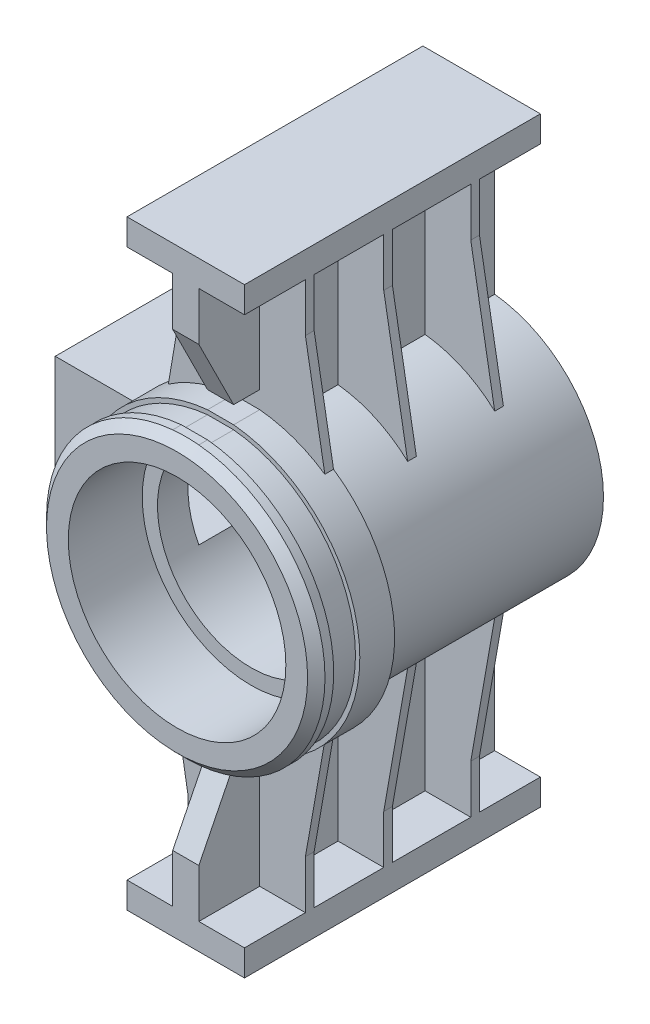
ISO-10303-21;
HEADER;
FILE_DESCRIPTION(('STEP AP214'),'2;1');
FILE_NAME('part.step','',(''),(''),'','','');
FILE_SCHEMA(('AUTOMOTIVE_DESIGN { 1 0 10303 214 1 1 1 1 }'));
ENDSEC;
DATA;
#1=APPLICATION_CONTEXT('core data for automotive mechanical design processes');
#2=APPLICATION_PROTOCOL_DEFINITION('international standard','automotive_design',2000,#1);
#3=PRODUCT_CONTEXT('',#1,'mechanical');
#4=PRODUCT('Part','Part','',(#3));
#5=PRODUCT_RELATED_PRODUCT_CATEGORY('part','',(#4));
#6=PRODUCT_DEFINITION_FORMATION('','',#4);
#7=PRODUCT_DEFINITION_CONTEXT('part definition',#1,'design');
#8=PRODUCT_DEFINITION('design','',#6,#7);
#9=PRODUCT_DEFINITION_SHAPE('','',#8);
#10=(LENGTH_UNIT() NAMED_UNIT(*) SI_UNIT(.MILLI.,.METRE.));
#11=(NAMED_UNIT(*) PLANE_ANGLE_UNIT() SI_UNIT($,.RADIAN.));
#12=(NAMED_UNIT(*) SI_UNIT($,.STERADIAN.) SOLID_ANGLE_UNIT());
#13=UNCERTAINTY_MEASURE_WITH_UNIT(LENGTH_MEASURE(1.E-05),#10,'distance_accuracy_value','');
#14=(GEOMETRIC_REPRESENTATION_CONTEXT(3) GLOBAL_UNCERTAINTY_ASSIGNED_CONTEXT((#13)) GLOBAL_UNIT_ASSIGNED_CONTEXT((#10,
#11,#12)) REPRESENTATION_CONTEXT('',''));
#15=CARTESIAN_POINT('',(0.,0.,0.));
#16=DIRECTION('',(0.,0.,1.));
#17=DIRECTION('',(1.,0.,0.));
#18=AXIS2_PLACEMENT_3D('',#15,#16,#17);
#19=CARTESIAN_POINT('',(0.,-6.66133814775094E-13,53.));
#20=DIRECTION('',(0.,0.,-0.999999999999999));
#21=DIRECTION('',(-0.999999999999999,0.,0.));
#22=AXIS2_PLACEMENT_3D('',#19,#20,#21);
#23=CYLINDRICAL_SURFACE('',#22,10.75);
#24=DIRECTION('',(0.,0.,-0.999999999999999));
#25=VECTOR('',#24,1.);
#26=CARTESIAN_POINT('',(-9.49999999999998,5.03115294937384,53.));
#27=LINE('',#26,#25);
#28=CARTESIAN_POINT('',(-9.5,5.03115294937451,23.));
#29=VERTEX_POINT('',#28);
#30=CARTESIAN_POINT('',(-9.49999999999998,5.03115294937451,0.));
#31=VERTEX_POINT('',#30);
#32=EDGE_CURVE('E44',#29,#31,#27,.T.);
#33=ORIENTED_EDGE('',*,*,#32,.T.);
#34=CARTESIAN_POINT('',(0.,0.,0.));
#35=DIRECTION('',(0.,0.,-0.999999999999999));
#36=DIRECTION('',(-0.999999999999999,0.,0.));
#37=AXIS2_PLACEMENT_3D('',#34,#35,#36);
#38=CIRCLE('',#37,10.75);
#39=CARTESIAN_POINT('',(-9.5,-5.03115294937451,0.));
#40=VERTEX_POINT('',#39);
#41=EDGE_CURVE('E650',#31,#40,#38,.T.);
#42=ORIENTED_EDGE('',*,*,#41,.T.);
#43=DIRECTION('',(0.,0.,-0.999999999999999));
#44=VECTOR('',#43,1.);
#45=CARTESIAN_POINT('',(-9.5,-5.03115294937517,53.));
#46=LINE('',#45,#44);
#47=CARTESIAN_POINT('',(-9.50000000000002,-5.03115294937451,23.));
#48=VERTEX_POINT('',#47);
#49=EDGE_CURVE('E652',#40,#48,#46,.F.);
#50=ORIENTED_EDGE('',*,*,#49,.T.);
#51=CARTESIAN_POINT('',(0.,0.,23.));
#52=DIRECTION('',(0.,0.,0.999999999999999));
#53=DIRECTION('',(0.999999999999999,0.,0.));
#54=AXIS2_PLACEMENT_3D('',#51,#52,#53);
#55=CIRCLE('',#54,10.75);
#56=EDGE_CURVE('E656',#29,#48,#55,.T.);
#57=ORIENTED_EDGE('',*,*,#56,.F.);
#58=EDGE_LOOP('',(#33,#42,#50,#57));
#59=FACE_BOUND('',#58,.T.);
#60=CARTESIAN_POINT('',(0.,0.,26.5));
#61=DIRECTION('',(0.,0.,0.999999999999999));
#62=DIRECTION('',(0.999999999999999,0.,0.));
#63=AXIS2_PLACEMENT_3D('',#60,#61,#62);
#64=CIRCLE('',#63,10.75);
#65=CARTESIAN_POINT('',(10.75,0.,26.5));
#66=VERTEX_POINT('',#65);
#67=EDGE_CURVE('E32',#66,#66,#64,.F.);
#68=ORIENTED_EDGE('',*,*,#67,.F.);
#69=EDGE_LOOP('',(#68));
#70=FACE_BOUND('',#69,.T.);
#71=ADVANCED_FACE('F28',(#59,#70),#23,.F.);
#72=CARTESIAN_POINT('',(-9.50000000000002,-5.50000000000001,23.));
#73=DIRECTION('',(-0.999999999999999,0.,0.));
#74=DIRECTION('',(0.,0.,0.999999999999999));
#75=AXIS2_PLACEMENT_3D('',#72,#73,#74);
#76=PLANE('',#75);
#77=ORIENTED_EDGE('',*,*,#32,.F.);
#78=DIRECTION('',(0.,0.999999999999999,0.));
#79=VECTOR('',#78,1.);
#80=CARTESIAN_POINT('',(-9.50000000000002,-5.50000000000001,23.));
#81=LINE('',#80,#79);
#82=CARTESIAN_POINT('',(-9.5,5.50000000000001,23.));
#83=VERTEX_POINT('',#82);
#84=EDGE_CURVE('E678',#29,#83,#81,.T.);
#85=ORIENTED_EDGE('',*,*,#84,.T.);
#86=DIRECTION('',(0.,0.,-0.999999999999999));
#87=VECTOR('',#86,1.);
#88=CARTESIAN_POINT('',(-9.5,5.50000000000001,23.));
#89=LINE('',#88,#87);
#90=CARTESIAN_POINT('',(-9.49999999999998,5.50000000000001,0.));
#91=VERTEX_POINT('',#90);
#92=EDGE_CURVE('E695',#83,#91,#89,.T.);
#93=ORIENTED_EDGE('',*,*,#92,.T.);
#94=DIRECTION('',(0.,0.999999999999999,0.));
#95=VECTOR('',#94,1.);
#96=CARTESIAN_POINT('',(-9.5,-5.50000000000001,0.));
#97=LINE('',#96,#95);
#98=EDGE_CURVE('E669',#31,#91,#97,.T.);
#99=ORIENTED_EDGE('',*,*,#98,.F.);
#100=EDGE_LOOP('',(#77,#85,#93,#99));
#101=FACE_BOUND('',#100,.T.);
#102=ADVANCED_FACE('F1487',(#101),#76,.T.);
#103=ORIENTED_EDGE('',*,*,#49,.F.);
#104=CARTESIAN_POINT('',(-9.5,-5.50000000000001,0.));
#105=VERTEX_POINT('',#104);
#106=EDGE_CURVE('E52',#105,#40,#97,.T.);
#107=ORIENTED_EDGE('',*,*,#106,.F.);
#108=DIRECTION('',(0.,0.,-0.999999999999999));
#109=VECTOR('',#108,1.);
#110=CARTESIAN_POINT('',(-9.50000000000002,-5.50000000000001,23.));
#111=LINE('',#110,#109);
#112=CARTESIAN_POINT('',(-9.50000000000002,-5.50000000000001,23.));
#113=VERTEX_POINT('',#112);
#114=EDGE_CURVE('E689',#113,#105,#111,.T.);
#115=ORIENTED_EDGE('',*,*,#114,.F.);
#116=EDGE_CURVE('E661',#113,#48,#81,.T.);
#117=ORIENTED_EDGE('',*,*,#116,.T.);
#118=EDGE_LOOP('',(#103,#107,#115,#117));
#119=FACE_BOUND('',#118,.T.);
#120=ADVANCED_FACE('F659',(#119),#76,.T.);
#121=CARTESIAN_POINT('',(-9.5,5.50000000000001,23.));
#122=DIRECTION('',(0.,-0.999999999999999,0.));
#123=DIRECTION('',(0.,0.,-0.999999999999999));
#124=AXIS2_PLACEMENT_3D('',#121,#122,#123);
#125=PLANE('',#124);
#126=DIRECTION('',(0.,0.,-0.999999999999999));
#127=VECTOR('',#126,1.);
#128=CARTESIAN_POINT('',(-19.9966832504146,5.50000000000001,23.));
#129=LINE('',#128,#127);
#130=CARTESIAN_POINT('',(-19.9966832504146,5.50000000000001,23.));
#131=VERTEX_POINT('',#130);
#132=CARTESIAN_POINT('',(-19.9966832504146,5.50000000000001,0.));
#133=VERTEX_POINT('',#132);
#134=EDGE_CURVE('E693',#131,#133,#129,.T.);
#135=ORIENTED_EDGE('',*,*,#134,.T.);
#136=DIRECTION('',(-0.999999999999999,0.,0.));
#137=VECTOR('',#136,1.);
#138=CARTESIAN_POINT('',(-9.49999999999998,5.50000000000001,0.));
#139=LINE('',#138,#137);
#140=EDGE_CURVE('E668',#91,#133,#139,.T.);
#141=ORIENTED_EDGE('',*,*,#140,.F.);
#142=ORIENTED_EDGE('',*,*,#92,.F.);
#143=DIRECTION('',(-0.999999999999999,0.,0.));
#144=VECTOR('',#143,1.);
#145=CARTESIAN_POINT('',(-9.5,5.50000000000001,23.));
#146=LINE('',#145,#144);
#147=EDGE_CURVE('E680',#83,#131,#146,.T.);
#148=ORIENTED_EDGE('',*,*,#147,.T.);
#149=EDGE_LOOP('',(#135,#141,#142,#148));
#150=FACE_BOUND('',#149,.T.);
#151=ADVANCED_FACE('F1505',(#150),#125,.T.);
#152=CARTESIAN_POINT('',(-19.9966832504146,5.50000000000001,23.));
#153=DIRECTION('',(0.999999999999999,0.,0.));
#154=DIRECTION('',(0.,0.999999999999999,0.));
#155=AXIS2_PLACEMENT_3D('',#152,#153,#154);
#156=PLANE('',#155);
#157=DIRECTION('',(0.,0.,-0.999999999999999));
#158=VECTOR('',#157,1.);
#159=CARTESIAN_POINT('',(-19.9966832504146,-5.50000000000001,23.));
#160=LINE('',#159,#158);
#161=CARTESIAN_POINT('',(-19.9966832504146,-5.50000000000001,23.));
#162=VERTEX_POINT('',#161);
#163=CARTESIAN_POINT('',(-19.9966832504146,-5.50000000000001,0.));
#164=VERTEX_POINT('',#163);
#165=EDGE_CURVE('E691',#162,#164,#160,.T.);
#166=ORIENTED_EDGE('',*,*,#165,.T.);
#167=DIRECTION('',(0.,-0.999999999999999,0.));
#168=VECTOR('',#167,1.);
#169=CARTESIAN_POINT('',(-19.9966832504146,5.50000000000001,0.));
#170=LINE('',#169,#168);
#171=EDGE_CURVE('E672',#133,#164,#170,.T.);
#172=ORIENTED_EDGE('',*,*,#171,.F.);
#173=ORIENTED_EDGE('',*,*,#134,.F.);
#174=DIRECTION('',(0.,-0.999999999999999,0.));
#175=VECTOR('',#174,1.);
#176=CARTESIAN_POINT('',(-19.9966832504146,5.50000000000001,23.));
#177=LINE('',#176,#175);
#178=EDGE_CURVE('E683',#131,#162,#177,.T.);
#179=ORIENTED_EDGE('',*,*,#178,.T.);
#180=EDGE_LOOP('',(#166,#172,#173,#179));
#181=FACE_BOUND('',#180,.T.);
#182=ADVANCED_FACE('F1502',(#181),#156,.T.);
#183=CARTESIAN_POINT('',(-19.9966832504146,-5.50000000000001,23.));
#184=DIRECTION('',(0.,0.999999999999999,0.));
#185=DIRECTION('',(-0.999999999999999,0.,0.));
#186=AXIS2_PLACEMENT_3D('',#183,#184,#185);
#187=PLANE('',#186);
#188=DIRECTION('',(0.999999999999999,0.,0.));
#189=VECTOR('',#188,1.);
#190=CARTESIAN_POINT('',(-19.9966832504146,-5.50000000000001,23.));
#191=LINE('',#190,#189);
#192=EDGE_CURVE('E686',#162,#113,#191,.T.);
#193=ORIENTED_EDGE('',*,*,#192,.T.);
#194=ORIENTED_EDGE('',*,*,#114,.T.);
#195=DIRECTION('',(0.999999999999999,0.,0.));
#196=VECTOR('',#195,1.);
#197=CARTESIAN_POINT('',(-19.9966832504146,-5.50000000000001,0.));
#198=LINE('',#197,#196);
#199=EDGE_CURVE('E667',#164,#105,#198,.T.);
#200=ORIENTED_EDGE('',*,*,#199,.F.);
#201=ORIENTED_EDGE('',*,*,#165,.F.);
#202=EDGE_LOOP('',(#193,#194,#200,#201));
#203=FACE_BOUND('',#202,.T.);
#204=ADVANCED_FACE('F1500',(#203),#187,.T.);
#205=CARTESIAN_POINT('',(-9.5,5.50000000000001,23.));
#206=DIRECTION('',(0.,0.,0.999999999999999));
#207=DIRECTION('',(0.999999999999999,0.,0.));
#208=AXIS2_PLACEMENT_3D('',#205,#206,#207);
#209=PLANE('',#208);
#210=ORIENTED_EDGE('',*,*,#84,.F.);
#211=ORIENTED_EDGE('',*,*,#56,.T.);
#212=ORIENTED_EDGE('',*,*,#116,.F.);
#213=ORIENTED_EDGE('',*,*,#192,.F.);
#214=ORIENTED_EDGE('',*,*,#178,.F.);
#215=ORIENTED_EDGE('',*,*,#147,.F.);
#216=EDGE_LOOP('',(#210,#211,#212,#213,#214,#215));
#217=FACE_BOUND('',#216,.T.);
#218=ADVANCED_FACE('F1498',(#217),#209,.F.);
#219=CARTESIAN_POINT('',(0.,0.,0.));
#220=DIRECTION('',(0.,0.,0.999999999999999));
#221=DIRECTION('',(0.999999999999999,0.,0.));
#222=AXIS2_PLACEMENT_3D('',#219,#220,#221);
#223=PLANE('',#222);
#224=CARTESIAN_POINT('',(0.,0.,0.));
#225=DIRECTION('',(0.,0.,0.999999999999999));
#226=DIRECTION('',(0.999999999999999,0.,0.));
#227=AXIS2_PLACEMENT_3D('',#224,#225,#226);
#228=CIRCLE('',#227,14.);
#229=CARTESIAN_POINT('',(-1.50000000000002,13.919410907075,0.));
#230=VERTEX_POINT('',#229);
#231=CARTESIAN_POINT('',(-11.1242977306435,8.50000000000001,0.));
#232=VERTEX_POINT('',#231);
#233=EDGE_CURVE('E1342',#230,#232,#228,.T.);
#234=ORIENTED_EDGE('',*,*,#233,.F.);
#235=DIRECTION('',(0.,0.999999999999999,0.));
#236=VECTOR('',#235,1.);
#237=CARTESIAN_POINT('',(-1.50000000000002,12.7677703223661,0.));
#238=LINE('',#237,#236);
#239=CARTESIAN_POINT('',(-1.50000000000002,31.5,0.));
#240=VERTEX_POINT('',#239);
#241=EDGE_CURVE('E1092',#230,#240,#238,.T.);
#242=ORIENTED_EDGE('',*,*,#241,.T.);
#243=DIRECTION('',(-0.999999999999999,0.,0.));
#244=VECTOR('',#243,1.);
#245=CARTESIAN_POINT('',(-1.50000000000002,31.5,0.));
#246=LINE('',#245,#244);
#247=CARTESIAN_POINT('',(-6.74999999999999,31.5,0.));
#248=VERTEX_POINT('',#247);
#249=EDGE_CURVE('E1095',#240,#248,#246,.T.);
#250=ORIENTED_EDGE('',*,*,#249,.T.);
#251=DIRECTION('',(0.,-0.999999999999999,0.));
#252=VECTOR('',#251,1.);
#253=CARTESIAN_POINT('',(-6.75,34.5,0.));
#254=LINE('',#253,#252);
#255=CARTESIAN_POINT('',(-6.75,34.5,0.));
#256=VERTEX_POINT('',#255);
#257=EDGE_CURVE('E1098',#256,#248,#254,.T.);
#258=ORIENTED_EDGE('',*,*,#257,.F.);
#259=DIRECTION('',(-0.999999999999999,0.,0.));
#260=VECTOR('',#259,1.);
#261=CARTESIAN_POINT('',(6.75000000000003,34.5,0.));
#262=LINE('',#261,#260);
#263=CARTESIAN_POINT('',(6.75000000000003,34.5,0.));
#264=VERTEX_POINT('',#263);
#265=EDGE_CURVE('E1101',#264,#256,#262,.T.);
#266=ORIENTED_EDGE('',*,*,#265,.F.);
#267=DIRECTION('',(0.,-0.999999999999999,0.));
#268=VECTOR('',#267,1.);
#269=CARTESIAN_POINT('',(6.75000000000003,34.5,0.));
#270=LINE('',#269,#268);
#271=CARTESIAN_POINT('',(6.75000000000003,31.5,0.));
#272=VERTEX_POINT('',#271);
#273=EDGE_CURVE('E1104',#264,#272,#270,.T.);
#274=ORIENTED_EDGE('',*,*,#273,.T.);
#275=DIRECTION('',(-0.999999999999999,0.,0.));
#276=VECTOR('',#275,1.);
#277=CARTESIAN_POINT('',(6.75000000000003,31.5,0.));
#278=LINE('',#277,#276);
#279=CARTESIAN_POINT('',(1.50000000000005,31.5,0.));
#280=VERTEX_POINT('',#279);
#281=EDGE_CURVE('E1107',#272,#280,#278,.T.);
#282=ORIENTED_EDGE('',*,*,#281,.T.);
#283=DIRECTION('',(0.,0.999999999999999,0.));
#284=VECTOR('',#283,1.);
#285=CARTESIAN_POINT('',(1.50000000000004,12.7677703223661,0.));
#286=LINE('',#285,#284);
#287=CARTESIAN_POINT('',(1.50000000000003,13.919410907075,0.));
#288=VERTEX_POINT('',#287);
#289=EDGE_CURVE('E1110',#288,#280,#286,.T.);
#290=ORIENTED_EDGE('',*,*,#289,.F.);
#291=CARTESIAN_POINT('',(1.50000000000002,-13.919410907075,0.));
#292=VERTEX_POINT('',#291);
#293=EDGE_CURVE('E1347',#292,#288,#228,.T.);
#294=ORIENTED_EDGE('',*,*,#293,.F.);
#295=DIRECTION('',(0.,0.999999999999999,0.));
#296=VECTOR('',#295,1.);
#297=CARTESIAN_POINT('',(1.49999999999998,-31.5000000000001,0.));
#298=LINE('',#297,#296);
#299=CARTESIAN_POINT('',(1.49999999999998,-31.5000000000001,0.));
#300=VERTEX_POINT('',#299);
#301=EDGE_CURVE('E1196',#300,#292,#298,.T.);
#302=ORIENTED_EDGE('',*,*,#301,.F.);
#303=DIRECTION('',(0.999999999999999,0.,0.));
#304=VECTOR('',#303,1.);
#305=CARTESIAN_POINT('',(1.49999999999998,-31.5000000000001,0.));
#306=LINE('',#305,#304);
#307=CARTESIAN_POINT('',(6.74999999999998,-31.5,0.));
#308=VERTEX_POINT('',#307);
#309=EDGE_CURVE('E1199',#300,#308,#306,.T.);
#310=ORIENTED_EDGE('',*,*,#309,.T.);
#311=DIRECTION('',(0.,0.999999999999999,0.));
#312=VECTOR('',#311,1.);
#313=CARTESIAN_POINT('',(6.74999999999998,-34.5,0.));
#314=LINE('',#313,#312);
#315=CARTESIAN_POINT('',(6.74999999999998,-34.5,0.));
#316=VERTEX_POINT('',#315);
#317=EDGE_CURVE('E1202',#316,#308,#314,.T.);
#318=ORIENTED_EDGE('',*,*,#317,.F.);
#319=DIRECTION('',(0.999999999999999,0.,0.));
#320=VECTOR('',#319,1.);
#321=CARTESIAN_POINT('',(-6.75000000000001,-34.5,0.));
#322=LINE('',#321,#320);
#323=CARTESIAN_POINT('',(-6.75000000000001,-34.5,0.));
#324=VERTEX_POINT('',#323);
#325=EDGE_CURVE('E1205',#324,#316,#322,.T.);
#326=ORIENTED_EDGE('',*,*,#325,.F.);
#327=DIRECTION('',(0.,0.999999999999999,0.));
#328=VECTOR('',#327,1.);
#329=CARTESIAN_POINT('',(-6.75000000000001,-34.5,0.));
#330=LINE('',#329,#328);
#331=CARTESIAN_POINT('',(-6.75000000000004,-31.5,0.));
#332=VERTEX_POINT('',#331);
#333=EDGE_CURVE('E1208',#324,#332,#330,.T.);
#334=ORIENTED_EDGE('',*,*,#333,.T.);
#335=DIRECTION('',(0.999999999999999,0.,0.));
#336=VECTOR('',#335,1.);
#337=CARTESIAN_POINT('',(-6.75000000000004,-31.5,0.));
#338=LINE('',#337,#336);
#339=CARTESIAN_POINT('',(-1.50000000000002,-31.5000000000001,0.));
#340=VERTEX_POINT('',#339);
#341=EDGE_CURVE('E1190',#332,#340,#338,.T.);
#342=ORIENTED_EDGE('',*,*,#341,.T.);
#343=DIRECTION('',(0.,0.999999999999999,0.));
#344=VECTOR('',#343,1.);
#345=CARTESIAN_POINT('',(-1.50000000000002,-31.5000000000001,0.));
#346=LINE('',#345,#344);
#347=CARTESIAN_POINT('',(-1.5,-13.919410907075,0.));
#348=VERTEX_POINT('',#347);
#349=EDGE_CURVE('E1193',#340,#348,#346,.T.);
#350=ORIENTED_EDGE('',*,*,#349,.T.);
#351=CARTESIAN_POINT('',(-11.1242977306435,-8.50000000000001,0.));
#352=VERTEX_POINT('',#351);
#353=EDGE_CURVE('E1344',#352,#348,#228,.T.);
#354=ORIENTED_EDGE('',*,*,#353,.F.);
#355=DIRECTION('',(0.999999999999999,0.,0.));
#356=VECTOR('',#355,1.);
#357=CARTESIAN_POINT('',(-23.,-8.50000000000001,0.));
#358=LINE('',#357,#356);
#359=CARTESIAN_POINT('',(-23.,-8.50000000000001,0.));
#360=VERTEX_POINT('',#359);
#361=EDGE_CURVE('E1298',#360,#352,#358,.T.);
#362=ORIENTED_EDGE('',*,*,#361,.F.);
#363=DIRECTION('',(0.,-0.999999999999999,0.));
#364=VECTOR('',#363,1.);
#365=CARTESIAN_POINT('',(-23.,8.50000000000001,0.));
#366=LINE('',#365,#364);
#367=CARTESIAN_POINT('',(-23.,8.50000000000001,0.));
#368=VERTEX_POINT('',#367);
#369=EDGE_CURVE('E1300',#368,#360,#366,.T.);
#370=ORIENTED_EDGE('',*,*,#369,.F.);
#371=DIRECTION('',(0.999999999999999,0.,0.));
#372=VECTOR('',#371,1.);
#373=CARTESIAN_POINT('',(-23.,8.50000000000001,0.));
#374=LINE('',#373,#372);
#375=EDGE_CURVE('E1295',#368,#232,#374,.T.);
#376=ORIENTED_EDGE('',*,*,#375,.T.);
#377=EDGE_LOOP('',(#234,#242,#250,#258,#266,#274,#282,#290,#294,#302,#310,#318,#326,#334,#342,
#350,#354,#362,#370,#376));
#378=FACE_BOUND('',#377,.T.);
#379=ORIENTED_EDGE('',*,*,#106,.T.);
#380=ORIENTED_EDGE('',*,*,#41,.F.);
#381=ORIENTED_EDGE('',*,*,#98,.T.);
#382=ORIENTED_EDGE('',*,*,#140,.T.);
#383=ORIENTED_EDGE('',*,*,#171,.T.);
#384=ORIENTED_EDGE('',*,*,#199,.T.);
#385=EDGE_LOOP('',(#379,#380,#381,#382,#383,#384));
#386=FACE_BOUND('',#385,.T.);
#387=ADVANCED_FACE('F664',(#378,#386),#223,.F.);
#388=CARTESIAN_POINT('',(1.50000000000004,12.7677703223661,34.));
#389=DIRECTION('',(-0.999999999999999,0.,0.));
#390=DIRECTION('',(0.,0.,0.999999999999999));
#391=AXIS2_PLACEMENT_3D('',#388,#389,#390);
#392=PLANE('',#391);
#393=DIRECTION('',(0.,-0.999999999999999,0.));
#394=VECTOR('',#393,1.);
#395=CARTESIAN_POINT('',(1.50000000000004,12.7677703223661,27.));
#396=LINE('',#395,#394);
#397=CARTESIAN_POINT('',(1.50000000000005,31.5,27.));
#398=VERTEX_POINT('',#397);
#399=CARTESIAN_POINT('',(1.50000000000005,17.929532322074,27.));
#400=VERTEX_POINT('',#399);
#401=EDGE_CURVE('E732',#398,#400,#396,.T.);
#402=ORIENTED_EDGE('',*,*,#401,.F.);
#403=DIRECTION('',(0.,0.,-0.999999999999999));
#404=VECTOR('',#403,1.);
#405=CARTESIAN_POINT('',(1.50000000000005,31.5,34.));
#406=LINE('',#405,#404);
#407=CARTESIAN_POINT('',(1.50000000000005,31.5,34.));
#408=VERTEX_POINT('',#407);
#409=EDGE_CURVE('E1152',#408,#398,#406,.T.);
#410=ORIENTED_EDGE('',*,*,#409,.F.);
#411=DIRECTION('',(0.,0.999999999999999,0.));
#412=VECTOR('',#411,1.);
#413=CARTESIAN_POINT('',(1.50000000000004,12.7677703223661,34.));
#414=LINE('',#413,#412);
#415=CARTESIAN_POINT('',(1.50000000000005,25.929532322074,34.));
#416=VERTEX_POINT('',#415);
#417=EDGE_CURVE('E1130',#416,#408,#414,.T.);
#418=ORIENTED_EDGE('',*,*,#417,.F.);
#419=DIRECTION('',(0.,0.894427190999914,0.447213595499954));
#420=VECTOR('',#419,1.);
#421=CARTESIAN_POINT('',(1.50000000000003,15.4001227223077,28.7352952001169));
#422=LINE('',#421,#420);
#423=CARTESIAN_POINT('',(1.50000000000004,17.929532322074,30.));
#424=VERTEX_POINT('',#423);
#425=EDGE_CURVE('E1088',#424,#416,#422,.T.);
#426=ORIENTED_EDGE('',*,*,#425,.F.);
#427=DIRECTION('',(0.,0.,0.999999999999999));
#428=VECTOR('',#427,1.);
#429=CARTESIAN_POINT('',(1.50000000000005,17.929532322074,34.));
#430=LINE('',#429,#428);
#431=EDGE_CURVE('E1090',#400,#424,#430,.T.);
#432=ORIENTED_EDGE('',*,*,#431,.F.);
#433=EDGE_LOOP('',(#402,#410,#418,#426,#432));
#434=FACE_BOUND('',#433,.T.);
#435=ADVANCED_FACE('F1795',(#434),#392,.F.);
#436=CARTESIAN_POINT('',(-1.50000000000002,12.7677703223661,34.));
#437=DIRECTION('',(-0.999999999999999,0.,0.));
#438=DIRECTION('',(0.,-0.999999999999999,0.));
#439=AXIS2_PLACEMENT_3D('',#436,#437,#438);
#440=PLANE('',#439);
#441=DIRECTION('',(0.,0.,-0.999999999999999));
#442=VECTOR('',#441,1.);
#443=CARTESIAN_POINT('',(-1.50000000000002,31.5,34.));
#444=LINE('',#443,#442);
#445=CARTESIAN_POINT('',(-1.50000000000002,31.5,34.));
#446=VERTEX_POINT('',#445);
#447=CARTESIAN_POINT('',(-1.50000000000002,31.5,27.));
#448=VERTEX_POINT('',#447);
#449=EDGE_CURVE('E1133',#446,#448,#444,.T.);
#450=ORIENTED_EDGE('',*,*,#449,.T.);
#451=DIRECTION('',(0.,-0.999999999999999,0.));
#452=VECTOR('',#451,1.);
#453=CARTESIAN_POINT('',(-1.50000000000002,12.7677703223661,27.));
#454=LINE('',#453,#452);
#455=CARTESIAN_POINT('',(-1.50000000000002,17.929532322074,27.));
#456=VERTEX_POINT('',#455);
#457=EDGE_CURVE('E729',#448,#456,#454,.T.);
#458=ORIENTED_EDGE('',*,*,#457,.T.);
#459=DIRECTION('',(0.,0.,0.999999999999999));
#460=VECTOR('',#459,1.);
#461=CARTESIAN_POINT('',(-1.50000000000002,17.929532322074,26.));
#462=LINE('',#461,#460);
#463=CARTESIAN_POINT('',(-1.50000000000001,17.929532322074,30.));
#464=VERTEX_POINT('',#463);
#465=EDGE_CURVE('E1068',#456,#464,#462,.T.);
#466=ORIENTED_EDGE('',*,*,#465,.T.);
#467=DIRECTION('',(0.,0.894427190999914,0.447213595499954));
#468=VECTOR('',#467,1.);
#469=CARTESIAN_POINT('',(-1.50000000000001,17.929532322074,30.));
#470=LINE('',#469,#468);
#471=CARTESIAN_POINT('',(-1.50000000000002,25.929532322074,34.));
#472=VERTEX_POINT('',#471);
#473=EDGE_CURVE('E1070',#464,#472,#470,.T.);
#474=ORIENTED_EDGE('',*,*,#473,.T.);
#475=DIRECTION('',(0.,0.999999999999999,0.));
#476=VECTOR('',#475,1.);
#477=CARTESIAN_POINT('',(-1.50000000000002,12.7677703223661,34.));
#478=LINE('',#477,#476);
#479=EDGE_CURVE('E1113',#472,#446,#478,.T.);
#480=ORIENTED_EDGE('',*,*,#479,.T.);
#481=EDGE_LOOP('',(#450,#458,#466,#474,#480));
#482=FACE_BOUND('',#481,.T.);
#483=ADVANCED_FACE('F1479',(#482),#440,.T.);
#484=CARTESIAN_POINT('',(6.75000000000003,31.5,34.));
#485=DIRECTION('',(0.,-0.999999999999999,0.));
#486=DIRECTION('',(0.,0.,-0.999999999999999));
#487=AXIS2_PLACEMENT_3D('',#484,#485,#486);
#488=PLANE('',#487);
#489=ORIENTED_EDGE('',*,*,#409,.T.);
#490=DIRECTION('',(-0.999999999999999,0.,0.));
#491=VECTOR('',#490,1.);
#492=CARTESIAN_POINT('',(6.75000000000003,31.5,27.));
#493=LINE('',#492,#491);
#494=CARTESIAN_POINT('',(6.75000000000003,31.5,27.));
#495=VERTEX_POINT('',#494);
#496=EDGE_CURVE('E703',#495,#398,#493,.T.);
#497=ORIENTED_EDGE('',*,*,#496,.F.);
#498=DIRECTION('',(0.,0.,-0.999999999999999));
#499=VECTOR('',#498,1.);
#500=CARTESIAN_POINT('',(6.75000000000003,31.5,34.));
#501=LINE('',#500,#499);
#502=CARTESIAN_POINT('',(6.75000000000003,31.5,34.));
#503=VERTEX_POINT('',#502);
#504=EDGE_CURVE('E1147',#503,#495,#501,.T.);
#505=ORIENTED_EDGE('',*,*,#504,.F.);
#506=DIRECTION('',(-0.999999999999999,0.,0.));
#507=VECTOR('',#506,1.);
#508=CARTESIAN_POINT('',(6.75000000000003,31.5,34.));
#509=LINE('',#508,#507);
#510=EDGE_CURVE('E1127',#503,#408,#509,.T.);
#511=ORIENTED_EDGE('',*,*,#510,.T.);
#512=EDGE_LOOP('',(#489,#497,#505,#511));
#513=FACE_BOUND('',#512,.T.);
#514=ADVANCED_FACE('F1466',(#513),#488,.T.);
#515=CARTESIAN_POINT('',(-1.50000000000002,31.5,34.));
#516=DIRECTION('',(0.,-0.999999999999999,0.));
#517=DIRECTION('',(0.,0.,-0.999999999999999));
#518=AXIS2_PLACEMENT_3D('',#515,#516,#517);
#519=PLANE('',#518);
#520=DIRECTION('',(0.,0.,-0.999999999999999));
#521=VECTOR('',#520,1.);
#522=CARTESIAN_POINT('',(-6.74999999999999,31.5,34.));
#523=LINE('',#522,#521);
#524=CARTESIAN_POINT('',(-6.74999999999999,31.5,34.));
#525=VERTEX_POINT('',#524);
#526=CARTESIAN_POINT('',(-6.74999999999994,31.5,27.));
#527=VERTEX_POINT('',#526);
#528=EDGE_CURVE('E1138',#525,#527,#523,.T.);
#529=ORIENTED_EDGE('',*,*,#528,.T.);
#530=EDGE_CURVE('E702',#448,#527,#493,.T.);
#531=ORIENTED_EDGE('',*,*,#530,.F.);
#532=ORIENTED_EDGE('',*,*,#449,.F.);
#533=DIRECTION('',(-0.999999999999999,0.,0.));
#534=VECTOR('',#533,1.);
#535=CARTESIAN_POINT('',(-1.50000000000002,31.5,34.));
#536=LINE('',#535,#534);
#537=EDGE_CURVE('E1115',#446,#525,#536,.T.);
#538=ORIENTED_EDGE('',*,*,#537,.T.);
#539=EDGE_LOOP('',(#529,#531,#532,#538));
#540=FACE_BOUND('',#539,.T.);
#541=ADVANCED_FACE('F1475',(#540),#519,.T.);
#542=CARTESIAN_POINT('',(8.49999999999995,15.929532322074,30.));
#543=DIRECTION('',(0.,0.999999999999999,0.));
#544=DIRECTION('',(-0.999999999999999,0.,0.));
#545=AXIS2_PLACEMENT_3D('',#542,#543,#544);
#546=PLANE('',#545);
#547=DIRECTION('',(0.,0.,-0.999999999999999));
#548=VECTOR('',#547,1.);
#549=CARTESIAN_POINT('',(1.50000000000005,15.929532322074,35.));
#550=LINE('',#549,#548);
#551=CARTESIAN_POINT('',(1.50000000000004,15.929532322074,30.));
#552=VERTEX_POINT('',#551);
#553=CARTESIAN_POINT('',(1.50000000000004,15.929532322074,27.));
#554=VERTEX_POINT('',#553);
#555=EDGE_CURVE('E1173',#552,#554,#550,.T.);
#556=ORIENTED_EDGE('',*,*,#555,.T.);
#557=DIRECTION('',(-0.999999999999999,0.,0.));
#558=VECTOR('',#557,1.);
#559=CARTESIAN_POINT('',(8.49999999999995,15.929532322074,27.));
#560=LINE('',#559,#558);
#561=CARTESIAN_POINT('',(-1.50000000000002,15.929532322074,27.));
#562=VERTEX_POINT('',#561);
#563=EDGE_CURVE('E734',#554,#562,#560,.T.);
#564=ORIENTED_EDGE('',*,*,#563,.T.);
#565=DIRECTION('',(0.,0.,-0.999999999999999));
#566=VECTOR('',#565,1.);
#567=CARTESIAN_POINT('',(-1.50000000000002,15.929532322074,35.));
#568=LINE('',#567,#566);
#569=CARTESIAN_POINT('',(-1.50000000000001,15.929532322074,30.));
#570=VERTEX_POINT('',#569);
#571=EDGE_CURVE('E1155',#570,#562,#568,.T.);
#572=ORIENTED_EDGE('',*,*,#571,.F.);
#573=DIRECTION('',(-0.999999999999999,0.,0.));
#574=VECTOR('',#573,1.);
#575=CARTESIAN_POINT('',(8.49999999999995,15.929532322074,30.));
#576=LINE('',#575,#574);
#577=EDGE_CURVE('E1078',#552,#570,#576,.T.);
#578=ORIENTED_EDGE('',*,*,#577,.F.);
#579=EDGE_LOOP('',(#556,#564,#572,#578));
#580=FACE_BOUND('',#579,.T.);
#581=ADVANCED_FACE('F1648',(#580),#546,.T.);
#582=CARTESIAN_POINT('',(8.49999999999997,17.929532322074,26.));
#583=DIRECTION('',(0.,-0.999999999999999,0.));
#584=DIRECTION('',(0.999999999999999,0.,0.));
#585=AXIS2_PLACEMENT_3D('',#582,#583,#584);
#586=PLANE('',#585);
#587=ORIENTED_EDGE('',*,*,#465,.F.);
#588=DIRECTION('',(0.999999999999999,0.,0.));
#589=VECTOR('',#588,1.);
#590=CARTESIAN_POINT('',(8.49999999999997,17.929532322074,27.));
#591=LINE('',#590,#589);
#592=EDGE_CURVE('E11',#456,#400,#591,.T.);
#593=ORIENTED_EDGE('',*,*,#592,.T.);
#594=ORIENTED_EDGE('',*,*,#431,.T.);
#595=DIRECTION('',(-0.999999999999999,0.,0.));
#596=VECTOR('',#595,1.);
#597=CARTESIAN_POINT('',(8.49999999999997,17.929532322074,30.));
#598=LINE('',#597,#596);
#599=EDGE_CURVE('E1075',#424,#464,#598,.T.);
#600=ORIENTED_EDGE('',*,*,#599,.T.);
#601=EDGE_LOOP('',(#587,#593,#594,#600));
#602=FACE_BOUND('',#601,.T.);
#603=ADVANCED_FACE('F1644',(#602),#586,.T.);
#604=CARTESIAN_POINT('',(0.,0.,35.));
#605=DIRECTION('',(0.,0.,-0.999999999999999));
#606=DIRECTION('',(-0.999999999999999,0.,0.));
#607=AXIS2_PLACEMENT_3D('',#604,#605,#606);
#608=CYLINDRICAL_SURFACE('',#607,16.);
#609=CARTESIAN_POINT('',(0.,0.,26.));
#610=DIRECTION('',(0.,0.,0.999999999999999));
#611=DIRECTION('',(0.999999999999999,0.,0.));
#612=AXIS2_PLACEMENT_3D('',#609,#610,#611);
#613=CIRCLE('',#612,16.);
#614=CARTESIAN_POINT('',(8.97993347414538,-13.2423862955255,26.));
#615=VERTEX_POINT('',#614);
#616=CARTESIAN_POINT('',(8.97993347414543,13.2423862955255,26.));
#617=VERTEX_POINT('',#616);
#618=EDGE_CURVE('E1384',#615,#617,#613,.T.);
#619=ORIENTED_EDGE('',*,*,#618,.T.);
#620=DIRECTION('',(0.,0.,-0.999999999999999));
#621=VECTOR('',#620,1.);
#622=CARTESIAN_POINT('',(8.97993347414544,13.2423862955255,35.));
#623=LINE('',#622,#621);
#624=CARTESIAN_POINT('',(8.97993347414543,13.2423862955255,27.));
#625=VERTEX_POINT('',#624);
#626=EDGE_CURVE('E744',#617,#625,#623,.F.);
#627=ORIENTED_EDGE('',*,*,#626,.T.);
#628=CARTESIAN_POINT('',(0.,0.,27.));
#629=DIRECTION('',(0.,0.,-0.999999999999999));
#630=DIRECTION('',(-0.999999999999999,0.,0.));
#631=AXIS2_PLACEMENT_3D('',#628,#629,#630);
#632=CIRCLE('',#631,16.);
#633=EDGE_CURVE('E739',#554,#625,#632,.T.);
#634=ORIENTED_EDGE('',*,*,#633,.F.);
#635=ORIENTED_EDGE('',*,*,#555,.F.);
#636=CARTESIAN_POINT('',(0.,0.,30.));
#637=DIRECTION('',(0.,0.,0.999999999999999));
#638=DIRECTION('',(0.999999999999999,0.,0.));
#639=AXIS2_PLACEMENT_3D('',#636,#637,#638);
#640=CIRCLE('',#639,16.);
#641=CARTESIAN_POINT('',(1.50000000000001,-15.929532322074,30.));
#642=VERTEX_POINT('',#641);
#643=EDGE_CURVE('E1330',#642,#552,#640,.T.);
#644=ORIENTED_EDGE('',*,*,#643,.F.);
#645=DIRECTION('',(0.,0.,-0.999999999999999));
#646=VECTOR('',#645,1.);
#647=CARTESIAN_POINT('',(1.50000000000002,-15.929532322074,35.));
#648=LINE('',#647,#646);
#649=CARTESIAN_POINT('',(1.50000000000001,-15.929532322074,27.));
#650=VERTEX_POINT('',#649);
#651=EDGE_CURVE('E1270',#650,#642,#648,.F.);
#652=ORIENTED_EDGE('',*,*,#651,.F.);
#653=CARTESIAN_POINT('',(0.,0.,27.));
#654=DIRECTION('',(0.,0.,-0.999999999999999));
#655=DIRECTION('',(-0.999999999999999,0.,0.));
#656=AXIS2_PLACEMENT_3D('',#653,#654,#655);
#657=CIRCLE('',#656,16.);
#658=CARTESIAN_POINT('',(8.97993347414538,-13.2423862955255,27.));
#659=VERTEX_POINT('',#658);
#660=EDGE_CURVE('E784',#659,#650,#657,.T.);
#661=ORIENTED_EDGE('',*,*,#660,.F.);
#662=DIRECTION('',(0.,0.,-0.999999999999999));
#663=VECTOR('',#662,1.);
#664=CARTESIAN_POINT('',(8.97993347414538,-13.2423862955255,35.));
#665=LINE('',#664,#663);
#666=EDGE_CURVE('E37',#615,#659,#665,.F.);
#667=ORIENTED_EDGE('',*,*,#666,.F.);
#668=EDGE_LOOP('',(#619,#627,#634,#635,#644,#652,#661,#667));
#669=FACE_BOUND('',#668,.T.);
#670=ADVANCED_FACE('F1647',(#669),#608,.T.);
#671=CARTESIAN_POINT('',(0.,0.,27.));
#672=DIRECTION('',(0.,0.,-0.999999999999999));
#673=DIRECTION('',(-0.999999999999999,0.,0.));
#674=AXIS2_PLACEMENT_3D('',#671,#672,#673);
#675=CIRCLE('',#674,16.);
#676=CARTESIAN_POINT('',(-9.00061020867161,13.2283413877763,27.));
#677=VERTEX_POINT('',#676);
#678=EDGE_CURVE('E737',#677,#562,#675,.T.);
#679=ORIENTED_EDGE('',*,*,#678,.F.);
#680=DIRECTION('',(0.,0.,-0.999999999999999));
#681=VECTOR('',#680,1.);
#682=CARTESIAN_POINT('',(-9.0006102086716,13.2283413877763,35.));
#683=LINE('',#682,#681);
#684=CARTESIAN_POINT('',(-9.00061020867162,13.2283413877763,26.));
#685=VERTEX_POINT('',#684);
#686=EDGE_CURVE('E741',#677,#685,#683,.T.);
#687=ORIENTED_EDGE('',*,*,#686,.T.);
#688=CARTESIAN_POINT('',(-13.5554417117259,8.50000000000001,26.));
#689=VERTEX_POINT('',#688);
#690=EDGE_CURVE('E1315',#685,#689,#613,.T.);
#691=ORIENTED_EDGE('',*,*,#690,.T.);
#692=CARTESIAN_POINT('',(-13.5554417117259,-8.50000000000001,26.));
#693=VERTEX_POINT('',#692);
#694=EDGE_CURVE('E1339',#689,#693,#613,.T.);
#695=ORIENTED_EDGE('',*,*,#694,.T.);
#696=CARTESIAN_POINT('',(-9.00061020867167,-13.2283413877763,26.));
#697=VERTEX_POINT('',#696);
#698=EDGE_CURVE('E1343',#693,#697,#613,.T.);
#699=ORIENTED_EDGE('',*,*,#698,.T.);
#700=DIRECTION('',(0.,0.,-0.999999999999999));
#701=VECTOR('',#700,1.);
#702=CARTESIAN_POINT('',(-9.00061020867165,-13.2283413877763,35.));
#703=LINE('',#702,#701);
#704=CARTESIAN_POINT('',(-9.00061020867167,-13.2283413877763,27.));
#705=VERTEX_POINT('',#704);
#706=EDGE_CURVE('E795',#705,#697,#703,.T.);
#707=ORIENTED_EDGE('',*,*,#706,.F.);
#708=CARTESIAN_POINT('',(0.,0.,27.));
#709=DIRECTION('',(0.,0.,-0.999999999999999));
#710=DIRECTION('',(-0.999999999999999,0.,0.));
#711=AXIS2_PLACEMENT_3D('',#708,#709,#710);
#712=CIRCLE('',#711,16.);
#713=CARTESIAN_POINT('',(-1.50000000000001,-15.929532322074,27.));
#714=VERTEX_POINT('',#713);
#715=EDGE_CURVE('E781',#714,#705,#712,.T.);
#716=ORIENTED_EDGE('',*,*,#715,.F.);
#717=DIRECTION('',(0.,0.,-0.999999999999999));
#718=VECTOR('',#717,1.);
#719=CARTESIAN_POINT('',(-1.50000000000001,-15.929532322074,35.));
#720=LINE('',#719,#718);
#721=CARTESIAN_POINT('',(-1.5,-15.929532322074,30.));
#722=VERTEX_POINT('',#721);
#723=EDGE_CURVE('E1254',#714,#722,#720,.F.);
#724=ORIENTED_EDGE('',*,*,#723,.T.);
#725=EDGE_CURVE('E1337',#570,#722,#640,.T.);
#726=ORIENTED_EDGE('',*,*,#725,.F.);
#727=ORIENTED_EDGE('',*,*,#571,.T.);
#728=EDGE_LOOP('',(#679,#687,#691,#695,#699,#707,#716,#724,#726,#727));
#729=FACE_BOUND('',#728,.T.);
#730=ADVANCED_FACE('F1390',(#729),#608,.T.);
#731=CARTESIAN_POINT('',(1.49999999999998,-31.5,34.));
#732=DIRECTION('',(-0.999999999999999,0.,0.));
#733=DIRECTION('',(0.,-0.999999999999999,0.));
#734=AXIS2_PLACEMENT_3D('',#731,#732,#733);
#735=PLANE('',#734);
#736=DIRECTION('',(0.,-0.999999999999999,0.));
#737=VECTOR('',#736,1.);
#738=CARTESIAN_POINT('',(1.49999999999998,-31.5000000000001,27.));
#739=LINE('',#738,#737);
#740=CARTESIAN_POINT('',(1.5,-17.929532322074,27.));
#741=VERTEX_POINT('',#740);
#742=CARTESIAN_POINT('',(1.49999999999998,-31.5000000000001,27.));
#743=VERTEX_POINT('',#742);
#744=EDGE_CURVE('E792',#741,#743,#739,.T.);
#745=ORIENTED_EDGE('',*,*,#744,.F.);
#746=DIRECTION('',(0.,0.,0.999999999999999));
#747=VECTOR('',#746,1.);
#748=CARTESIAN_POINT('',(1.50000000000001,-17.929532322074,34.));
#749=LINE('',#748,#747);
#750=CARTESIAN_POINT('',(1.5,-17.929532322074,30.));
#751=VERTEX_POINT('',#750);
#752=EDGE_CURVE('E1066',#741,#751,#749,.T.);
#753=ORIENTED_EDGE('',*,*,#752,.T.);
#754=DIRECTION('',(0.,-0.894427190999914,0.447213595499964));
#755=VECTOR('',#754,1.);
#756=CARTESIAN_POINT('',(1.49999999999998,-30.3859064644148,36.2281870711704));
#757=LINE('',#756,#755);
#758=CARTESIAN_POINT('',(1.5,-25.929532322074,34.));
#759=VERTEX_POINT('',#758);
#760=EDGE_CURVE('E1063',#751,#759,#757,.T.);
#761=ORIENTED_EDGE('',*,*,#760,.T.);
#762=DIRECTION('',(0.,0.999999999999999,0.));
#763=VECTOR('',#762,1.);
#764=CARTESIAN_POINT('',(1.49999999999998,-31.5,34.));
#765=LINE('',#764,#763);
#766=CARTESIAN_POINT('',(1.49999999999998,-31.5,34.));
#767=VERTEX_POINT('',#766);
#768=EDGE_CURVE('E1217',#767,#759,#765,.T.);
#769=ORIENTED_EDGE('',*,*,#768,.F.);
#770=DIRECTION('',(0.,0.,-0.999999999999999));
#771=VECTOR('',#770,1.);
#772=CARTESIAN_POINT('',(1.49999999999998,-31.5,34.));
#773=LINE('',#772,#771);
#774=EDGE_CURVE('E1238',#767,#743,#773,.T.);
#775=ORIENTED_EDGE('',*,*,#774,.T.);
#776=EDGE_LOOP('',(#745,#753,#761,#769,#775));
#777=FACE_BOUND('',#776,.T.);
#778=ADVANCED_FACE('F1832',(#777),#735,.F.);
#779=CARTESIAN_POINT('',(-1.50000000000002,-31.5,34.));
#780=DIRECTION('',(-0.999999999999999,0.,0.));
#781=DIRECTION('',(0.,0.,0.999999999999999));
#782=AXIS2_PLACEMENT_3D('',#779,#780,#781);
#783=PLANE('',#782);
#784=DIRECTION('',(0.,0.,0.999999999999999));
#785=VECTOR('',#784,1.);
#786=CARTESIAN_POINT('',(-1.50000000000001,-17.929532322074,26.));
#787=LINE('',#786,#785);
#788=CARTESIAN_POINT('',(-1.50000000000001,-17.929532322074,27.));
#789=VERTEX_POINT('',#788);
#790=CARTESIAN_POINT('',(-1.50000000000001,-17.929532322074,30.));
#791=VERTEX_POINT('',#790);
#792=EDGE_CURVE('E1041',#789,#791,#787,.T.);
#793=ORIENTED_EDGE('',*,*,#792,.F.);
#794=DIRECTION('',(0.,-0.999999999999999,0.));
#795=VECTOR('',#794,1.);
#796=CARTESIAN_POINT('',(-1.50000000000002,-31.5000000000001,27.));
#797=LINE('',#796,#795);
#798=CARTESIAN_POINT('',(-1.50000000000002,-31.5000000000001,27.));
#799=VERTEX_POINT('',#798);
#800=EDGE_CURVE('E790',#789,#799,#797,.T.);
#801=ORIENTED_EDGE('',*,*,#800,.T.);
#802=DIRECTION('',(0.,0.,-0.999999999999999));
#803=VECTOR('',#802,1.);
#804=CARTESIAN_POINT('',(-1.50000000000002,-31.5,34.));
#805=LINE('',#804,#803);
#806=CARTESIAN_POINT('',(-1.50000000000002,-31.5,34.));
#807=VERTEX_POINT('',#806);
#808=EDGE_CURVE('E1233',#807,#799,#805,.T.);
#809=ORIENTED_EDGE('',*,*,#808,.F.);
#810=DIRECTION('',(0.,0.999999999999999,0.));
#811=VECTOR('',#810,1.);
#812=CARTESIAN_POINT('',(-1.50000000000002,-31.5,34.));
#813=LINE('',#812,#811);
#814=CARTESIAN_POINT('',(-1.50000000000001,-25.929532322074,34.));
#815=VERTEX_POINT('',#814);
#816=EDGE_CURVE('E1214',#807,#815,#813,.T.);
#817=ORIENTED_EDGE('',*,*,#816,.T.);
#818=DIRECTION('',(0.,-0.894427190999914,0.447213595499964));
#819=VECTOR('',#818,1.);
#820=CARTESIAN_POINT('',(-1.50000000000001,-17.929532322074,30.));
#821=LINE('',#820,#819);
#822=EDGE_CURVE('E1043',#791,#815,#821,.T.);
#823=ORIENTED_EDGE('',*,*,#822,.F.);
#824=EDGE_LOOP('',(#793,#801,#809,#817,#823));
#825=FACE_BOUND('',#824,.T.);
#826=ADVANCED_FACE('F1839',(#825),#783,.T.);
#827=CARTESIAN_POINT('',(-6.75000000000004,-31.5,34.));
#828=DIRECTION('',(0.,0.999999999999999,0.));
#829=DIRECTION('',(-0.999999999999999,0.,0.));
#830=AXIS2_PLACEMENT_3D('',#827,#828,#829);
#831=PLANE('',#830);
#832=ORIENTED_EDGE('',*,*,#808,.T.);
#833=DIRECTION('',(-0.999999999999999,0.,0.));
#834=VECTOR('',#833,1.);
#835=CARTESIAN_POINT('',(6.74999999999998,-31.5,27.));
#836=LINE('',#835,#834);
#837=CARTESIAN_POINT('',(-6.75000000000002,-31.5,27.));
#838=VERTEX_POINT('',#837);
#839=EDGE_CURVE('E750',#799,#838,#836,.T.);
#840=ORIENTED_EDGE('',*,*,#839,.T.);
#841=DIRECTION('',(0.,0.,-0.999999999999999));
#842=VECTOR('',#841,1.);
#843=CARTESIAN_POINT('',(-6.75000000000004,-31.5,34.));
#844=LINE('',#843,#842);
#845=CARTESIAN_POINT('',(-6.75000000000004,-31.5,34.));
#846=VERTEX_POINT('',#845);
#847=EDGE_CURVE('E1251',#846,#838,#844,.T.);
#848=ORIENTED_EDGE('',*,*,#847,.F.);
#849=DIRECTION('',(0.999999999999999,0.,0.));
#850=VECTOR('',#849,1.);
#851=CARTESIAN_POINT('',(-6.75000000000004,-31.5,34.));
#852=LINE('',#851,#850);
#853=EDGE_CURVE('E1211',#846,#807,#852,.T.);
#854=ORIENTED_EDGE('',*,*,#853,.T.);
#855=EDGE_LOOP('',(#832,#840,#848,#854));
#856=FACE_BOUND('',#855,.T.);
#857=ADVANCED_FACE('F1753',(#856),#831,.T.);
#858=CARTESIAN_POINT('',(1.49999999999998,-31.5,34.));
#859=DIRECTION('',(0.,0.999999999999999,0.));
#860=DIRECTION('',(-0.999999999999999,0.,0.));
#861=AXIS2_PLACEMENT_3D('',#858,#859,#860);
#862=PLANE('',#861);
#863=DIRECTION('',(0.,0.,-0.999999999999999));
#864=VECTOR('',#863,1.);
#865=CARTESIAN_POINT('',(6.74999999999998,-31.5,34.));
#866=LINE('',#865,#864);
#867=CARTESIAN_POINT('',(6.74999999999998,-31.5,34.));
#868=VERTEX_POINT('',#867);
#869=CARTESIAN_POINT('',(6.74999999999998,-31.5,27.));
#870=VERTEX_POINT('',#869);
#871=EDGE_CURVE('E1243',#868,#870,#866,.T.);
#872=ORIENTED_EDGE('',*,*,#871,.T.);
#873=EDGE_CURVE('E751',#870,#743,#836,.T.);
#874=ORIENTED_EDGE('',*,*,#873,.T.);
#875=ORIENTED_EDGE('',*,*,#774,.F.);
#876=DIRECTION('',(0.999999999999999,0.,0.));
#877=VECTOR('',#876,1.);
#878=CARTESIAN_POINT('',(1.49999999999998,-31.5,34.));
#879=LINE('',#878,#877);
#880=EDGE_CURVE('E1220',#767,#868,#879,.T.);
#881=ORIENTED_EDGE('',*,*,#880,.T.);
#882=EDGE_LOOP('',(#872,#874,#875,#881));
#883=FACE_BOUND('',#882,.T.);
#884=ADVANCED_FACE('F1629',(#883),#862,.T.);
#885=CARTESIAN_POINT('',(8.49999999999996,-17.929532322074,26.));
#886=DIRECTION('',(0.,-0.999999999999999,0.));
#887=DIRECTION('',(0.,0.,-0.999999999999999));
#888=AXIS2_PLACEMENT_3D('',#885,#886,#887);
#889=PLANE('',#888);
#890=DIRECTION('',(0.999999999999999,0.,0.));
#891=VECTOR('',#890,1.);
#892=CARTESIAN_POINT('',(8.49999999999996,-17.929532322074,27.));
#893=LINE('',#892,#891);
#894=EDGE_CURVE('E787',#789,#741,#893,.T.);
#895=ORIENTED_EDGE('',*,*,#894,.F.);
#896=ORIENTED_EDGE('',*,*,#792,.T.);
#897=DIRECTION('',(-0.999999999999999,0.,0.));
#898=VECTOR('',#897,1.);
#899=CARTESIAN_POINT('',(8.49999999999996,-17.929532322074,30.));
#900=LINE('',#899,#898);
#901=EDGE_CURVE('E1057',#751,#791,#900,.T.);
#902=ORIENTED_EDGE('',*,*,#901,.F.);
#903=ORIENTED_EDGE('',*,*,#752,.F.);
#904=EDGE_LOOP('',(#895,#896,#902,#903));
#905=FACE_BOUND('',#904,.T.);
#906=ADVANCED_FACE('F1625',(#905),#889,.F.);
#907=CARTESIAN_POINT('',(8.49999999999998,-15.929532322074,30.));
#908=DIRECTION('',(0.,0.999999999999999,0.));
#909=DIRECTION('',(0.,0.,0.999999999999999));
#910=AXIS2_PLACEMENT_3D('',#907,#908,#909);
#911=PLANE('',#910);
#912=DIRECTION('',(-0.999999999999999,0.,0.));
#913=VECTOR('',#912,1.);
#914=CARTESIAN_POINT('',(8.49999999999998,-15.929532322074,27.));
#915=LINE('',#914,#913);
#916=EDGE_CURVE('E1358',#650,#714,#915,.T.);
#917=ORIENTED_EDGE('',*,*,#916,.F.);
#918=ORIENTED_EDGE('',*,*,#651,.T.);
#919=DIRECTION('',(-0.999999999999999,0.,0.));
#920=VECTOR('',#919,1.);
#921=CARTESIAN_POINT('',(8.49999999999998,-15.929532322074,30.));
#922=LINE('',#921,#920);
#923=EDGE_CURVE('E1054',#642,#722,#922,.T.);
#924=ORIENTED_EDGE('',*,*,#923,.T.);
#925=ORIENTED_EDGE('',*,*,#723,.F.);
#926=EDGE_LOOP('',(#917,#918,#924,#925));
#927=FACE_BOUND('',#926,.T.);
#928=ADVANCED_FACE('F1621',(#927),#911,.F.);
#929=DIRECTION('',(0.,0.999999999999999,0.));
#930=VECTOR('',#929,1.);
#931=CARTESIAN_POINT('',(1.49999999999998,-31.5000000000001,17.));
#932=LINE('',#931,#930);
#933=CARTESIAN_POINT('',(1.49999999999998,-31.5,17.));
#934=VERTEX_POINT('',#933);
#935=CARTESIAN_POINT('',(1.50000000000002,-13.919410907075,17.));
#936=VERTEX_POINT('',#935);
#937=EDGE_CURVE('E843',#934,#936,#932,.T.);
#938=ORIENTED_EDGE('',*,*,#937,.F.);
#939=CARTESIAN_POINT('',(1.49999999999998,-31.5000000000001,8.00000000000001));
#940=VERTEX_POINT('',#939);
#941=EDGE_CURVE('E2436',#934,#940,#773,.T.);
#942=ORIENTED_EDGE('',*,*,#941,.T.);
#943=DIRECTION('',(0.,0.999999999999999,0.));
#944=VECTOR('',#943,1.);
#945=CARTESIAN_POINT('',(1.49999999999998,-31.5000000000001,8.00000000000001));
#946=LINE('',#945,#944);
#947=CARTESIAN_POINT('',(1.50000000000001,-13.919410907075,8.00000000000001));
#948=VERTEX_POINT('',#947);
#949=EDGE_CURVE('E962',#940,#948,#946,.T.);
#950=ORIENTED_EDGE('',*,*,#949,.T.);
#951=DIRECTION('',(0.,0.,0.999999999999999));
#952=VECTOR('',#951,1.);
#953=CARTESIAN_POINT('',(1.50000000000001,-13.919410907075,-7.00000000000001));
#954=LINE('',#953,#952);
#955=EDGE_CURVE('E1279',#936,#948,#954,.F.);
#956=ORIENTED_EDGE('',*,*,#955,.F.);
#957=EDGE_LOOP('',(#938,#942,#950,#956));
#958=FACE_BOUND('',#957,.T.);
#959=ADVANCED_FACE('F1624',(#958),#735,.F.);
#960=CARTESIAN_POINT('',(-1.50000000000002,-31.5,17.));
#961=VERTEX_POINT('',#960);
#962=CARTESIAN_POINT('',(-1.50000000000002,-31.5,8.00000000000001));
#963=VERTEX_POINT('',#962);
#964=EDGE_CURVE('E2531',#961,#963,#805,.T.);
#965=ORIENTED_EDGE('',*,*,#964,.F.);
#966=DIRECTION('',(0.,0.999999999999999,0.));
#967=VECTOR('',#966,1.);
#968=CARTESIAN_POINT('',(-1.50000000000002,-31.5000000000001,17.));
#969=LINE('',#968,#967);
#970=CARTESIAN_POINT('',(-1.5,-13.919410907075,17.));
#971=VERTEX_POINT('',#970);
#972=EDGE_CURVE('E837',#961,#971,#969,.T.);
#973=ORIENTED_EDGE('',*,*,#972,.T.);
#974=DIRECTION('',(0.,0.,0.999999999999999));
#975=VECTOR('',#974,1.);
#976=CARTESIAN_POINT('',(-1.5,-13.919410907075,-7.00000000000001));
#977=LINE('',#976,#975);
#978=CARTESIAN_POINT('',(-1.5,-13.919410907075,8.00000000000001));
#979=VERTEX_POINT('',#978);
#980=EDGE_CURVE('E1264',#971,#979,#977,.F.);
#981=ORIENTED_EDGE('',*,*,#980,.T.);
#982=DIRECTION('',(0.,0.999999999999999,0.));
#983=VECTOR('',#982,1.);
#984=CARTESIAN_POINT('',(-1.50000000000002,-31.5000000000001,8.00000000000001));
#985=LINE('',#984,#983);
#986=EDGE_CURVE('E957',#963,#979,#985,.T.);
#987=ORIENTED_EDGE('',*,*,#986,.F.);
#988=EDGE_LOOP('',(#965,#973,#981,#987));
#989=FACE_BOUND('',#988,.T.);
#990=ADVANCED_FACE('F1850',(#989),#783,.T.);
#991=CARTESIAN_POINT('',(-6.75000000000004,-31.5,17.));
#992=VERTEX_POINT('',#991);
#993=CARTESIAN_POINT('',(-6.75000000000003,-31.5,8.00000000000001));
#994=VERTEX_POINT('',#993);
#995=EDGE_CURVE('E1731',#992,#994,#844,.T.);
#996=ORIENTED_EDGE('',*,*,#995,.F.);
#997=DIRECTION('',(0.999999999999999,0.,0.));
#998=VECTOR('',#997,1.);
#999=CARTESIAN_POINT('',(-6.75000000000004,-31.5,17.));
#1000=LINE('',#999,#998);
#1001=EDGE_CURVE('E804',#992,#961,#1000,.T.);
#1002=ORIENTED_EDGE('',*,*,#1001,.T.);
#1003=ORIENTED_EDGE('',*,*,#964,.T.);
#1004=DIRECTION('',(0.999999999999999,0.,0.));
#1005=VECTOR('',#1004,1.);
#1006=CARTESIAN_POINT('',(-6.75000000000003,-31.5,8.00000000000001));
#1007=LINE('',#1006,#1005);
#1008=EDGE_CURVE('E923',#994,#963,#1007,.T.);
#1009=ORIENTED_EDGE('',*,*,#1008,.F.);
#1010=EDGE_LOOP('',(#996,#1002,#1003,#1009));
#1011=FACE_BOUND('',#1010,.T.);
#1012=ADVANCED_FACE('F1857',(#1011),#831,.T.);
#1013=ORIENTED_EDGE('',*,*,#941,.F.);
#1014=DIRECTION('',(0.999999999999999,0.,0.));
#1015=VECTOR('',#1014,1.);
#1016=CARTESIAN_POINT('',(1.49999999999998,-31.5000000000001,17.));
#1017=LINE('',#1016,#1015);
#1018=CARTESIAN_POINT('',(6.74999999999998,-31.5,17.));
#1019=VERTEX_POINT('',#1018);
#1020=EDGE_CURVE('E1352',#934,#1019,#1017,.T.);
#1021=ORIENTED_EDGE('',*,*,#1020,.T.);
#1022=CARTESIAN_POINT('',(6.74999999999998,-31.5,8.00000000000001));
#1023=VERTEX_POINT('',#1022);
#1024=EDGE_CURVE('E2445',#1019,#1023,#866,.T.);
#1025=ORIENTED_EDGE('',*,*,#1024,.T.);
#1026=DIRECTION('',(0.999999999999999,0.,0.));
#1027=VECTOR('',#1026,1.);
#1028=CARTESIAN_POINT('',(1.49999999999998,-31.5000000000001,8.00000000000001));
#1029=LINE('',#1028,#1027);
#1030=EDGE_CURVE('E1333',#940,#1023,#1029,.T.);
#1031=ORIENTED_EDGE('',*,*,#1030,.F.);
#1032=EDGE_LOOP('',(#1013,#1021,#1025,#1031));
#1033=FACE_BOUND('',#1032,.T.);
#1034=ADVANCED_FACE('F1864',(#1033),#862,.T.);
#1035=CARTESIAN_POINT('',(0.,0.,-7.00000000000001));
#1036=DIRECTION('',(0.,0.,0.999999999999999));
#1037=DIRECTION('',(0.999999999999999,0.,0.));
#1038=AXIS2_PLACEMENT_3D('',#1035,#1036,#1037);
#1039=CYLINDRICAL_SURFACE('',#1038,14.);
#1040=CARTESIAN_POINT('',(0.,0.,18.));
#1041=DIRECTION('',(0.,0.,0.999999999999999));
#1042=DIRECTION('',(0.999999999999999,0.,0.));
#1043=AXIS2_PLACEMENT_3D('',#1040,#1041,#1042);
#1044=CIRCLE('',#1043,14.);
#1045=CARTESIAN_POINT('',(9.49999999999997,-10.2834819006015,18.));
#1046=VERTEX_POINT('',#1045);
#1047=CARTESIAN_POINT('',(1.50000000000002,-13.919410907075,18.));
#1048=VERTEX_POINT('',#1047);
#1049=EDGE_CURVE('E855',#1046,#1048,#1044,.F.);
#1050=ORIENTED_EDGE('',*,*,#1049,.F.);
#1051=DIRECTION('',(0.,0.,-0.999999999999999));
#1052=VECTOR('',#1051,1.);
#1053=CARTESIAN_POINT('',(9.49999999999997,-10.2834819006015,18.));
#1054=LINE('',#1053,#1052);
#1055=CARTESIAN_POINT('',(9.49999999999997,-10.2834819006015,17.));
#1056=VERTEX_POINT('',#1055);
#1057=EDGE_CURVE('E830',#1046,#1056,#1054,.T.);
#1058=ORIENTED_EDGE('',*,*,#1057,.T.);
#1059=CARTESIAN_POINT('',(0.,0.,17.));
#1060=DIRECTION('',(0.,0.,0.999999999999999));
#1061=DIRECTION('',(0.999999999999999,0.,0.));
#1062=AXIS2_PLACEMENT_3D('',#1059,#1060,#1061);
#1063=CIRCLE('',#1062,14.);
#1064=EDGE_CURVE('E845',#1056,#936,#1063,.F.);
#1065=ORIENTED_EDGE('',*,*,#1064,.T.);
#1066=ORIENTED_EDGE('',*,*,#955,.T.);
#1067=CARTESIAN_POINT('',(0.,0.,8.00000000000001));
#1068=DIRECTION('',(0.,0.,0.999999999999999));
#1069=DIRECTION('',(0.999999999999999,0.,0.));
#1070=AXIS2_PLACEMENT_3D('',#1067,#1068,#1069);
#1071=CIRCLE('',#1070,14.);
#1072=CARTESIAN_POINT('',(9.49999999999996,-10.2834819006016,8.00000000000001));
#1073=VERTEX_POINT('',#1072);
#1074=EDGE_CURVE('E965',#1073,#948,#1071,.F.);
#1075=ORIENTED_EDGE('',*,*,#1074,.F.);
#1076=DIRECTION('',(0.,0.,0.999999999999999));
#1077=VECTOR('',#1076,1.);
#1078=CARTESIAN_POINT('',(9.49999999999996,-10.2834819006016,7.00000000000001));
#1079=LINE('',#1078,#1077);
#1080=CARTESIAN_POINT('',(9.49999999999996,-10.2834819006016,7.00000000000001));
#1081=VERTEX_POINT('',#1080);
#1082=EDGE_CURVE('E954',#1081,#1073,#1079,.T.);
#1083=ORIENTED_EDGE('',*,*,#1082,.F.);
#1084=CARTESIAN_POINT('',(0.,0.,7.00000000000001));
#1085=DIRECTION('',(0.,0.,0.999999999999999));
#1086=DIRECTION('',(0.999999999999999,0.,0.));
#1087=AXIS2_PLACEMENT_3D('',#1084,#1085,#1086);
#1088=CIRCLE('',#1087,14.);
#1089=CARTESIAN_POINT('',(1.50000000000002,-13.919410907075,7.00000000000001));
#1090=VERTEX_POINT('',#1089);
#1091=EDGE_CURVE('E977',#1081,#1090,#1088,.F.);
#1092=ORIENTED_EDGE('',*,*,#1091,.T.);
#1093=EDGE_CURVE('E1274',#1090,#292,#954,.F.);
#1094=ORIENTED_EDGE('',*,*,#1093,.T.);
#1095=ORIENTED_EDGE('',*,*,#293,.T.);
#1096=DIRECTION('',(0.,0.,0.999999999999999));
#1097=VECTOR('',#1096,1.);
#1098=CARTESIAN_POINT('',(1.50000000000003,13.919410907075,-7.00000000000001));
#1099=LINE('',#1098,#1097);
#1100=CARTESIAN_POINT('',(1.50000000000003,13.919410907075,7.00000000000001));
#1101=VERTEX_POINT('',#1100);
#1102=EDGE_CURVE('E1180',#288,#1101,#1099,.T.);
#1103=ORIENTED_EDGE('',*,*,#1102,.T.);
#1104=CARTESIAN_POINT('',(0.,0.,7.00000000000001));
#1105=DIRECTION('',(0.,0.,0.999999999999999));
#1106=DIRECTION('',(0.999999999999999,0.,0.));
#1107=AXIS2_PLACEMENT_3D('',#1104,#1105,#1106);
#1108=CIRCLE('',#1107,14.);
#1109=CARTESIAN_POINT('',(9.5,10.2834819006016,7.00000000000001));
#1110=VERTEX_POINT('',#1109);
#1111=EDGE_CURVE('E1036',#1101,#1110,#1108,.F.);
#1112=ORIENTED_EDGE('',*,*,#1111,.T.);
#1113=DIRECTION('',(0.,0.,0.999999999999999));
#1114=VECTOR('',#1113,1.);
#1115=CARTESIAN_POINT('',(9.5,10.2834819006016,7.00000000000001));
#1116=LINE('',#1115,#1114);
#1117=CARTESIAN_POINT('',(9.5,10.2834819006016,8.00000000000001));
#1118=VERTEX_POINT('',#1117);
#1119=EDGE_CURVE('E1016',#1110,#1118,#1116,.T.);
#1120=ORIENTED_EDGE('',*,*,#1119,.T.);
#1121=CARTESIAN_POINT('',(0.,0.,8.00000000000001));
#1122=DIRECTION('',(0.,0.,0.999999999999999));
#1123=DIRECTION('',(0.999999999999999,0.,0.));
#1124=AXIS2_PLACEMENT_3D('',#1121,#1122,#1123);
#1125=CIRCLE('',#1124,14.);
#1126=CARTESIAN_POINT('',(1.50000000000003,13.919410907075,8.00000000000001));
#1127=VERTEX_POINT('',#1126);
#1128=EDGE_CURVE('E1027',#1127,#1118,#1125,.F.);
#1129=ORIENTED_EDGE('',*,*,#1128,.F.);
#1130=CARTESIAN_POINT('',(1.50000000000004,13.919410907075,17.));
#1131=VERTEX_POINT('',#1130);
#1132=EDGE_CURVE('E1184',#1127,#1131,#1099,.T.);
#1133=ORIENTED_EDGE('',*,*,#1132,.T.);
#1134=CARTESIAN_POINT('',(0.,0.,17.));
#1135=DIRECTION('',(0.,0.,-0.999999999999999));
#1136=DIRECTION('',(-0.999999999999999,0.,0.));
#1137=AXIS2_PLACEMENT_3D('',#1134,#1135,#1136);
#1138=CIRCLE('',#1137,14.);
#1139=CARTESIAN_POINT('',(9.50000000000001,10.2834819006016,17.));
#1140=VERTEX_POINT('',#1139);
#1141=EDGE_CURVE('E906',#1140,#1131,#1138,.F.);
#1142=ORIENTED_EDGE('',*,*,#1141,.F.);
#1143=DIRECTION('',(0.,0.,-0.999999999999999));
#1144=VECTOR('',#1143,1.);
#1145=CARTESIAN_POINT('',(9.50000000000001,10.2834819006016,18.));
#1146=LINE('',#1145,#1144);
#1147=CARTESIAN_POINT('',(9.50000000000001,10.2834819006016,18.));
#1148=VERTEX_POINT('',#1147);
#1149=EDGE_CURVE('E891',#1148,#1140,#1146,.T.);
#1150=ORIENTED_EDGE('',*,*,#1149,.F.);
#1151=CARTESIAN_POINT('',(0.,0.,18.));
#1152=DIRECTION('',(0.,0.,-0.999999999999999));
#1153=DIRECTION('',(-0.999999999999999,0.,0.));
#1154=AXIS2_PLACEMENT_3D('',#1151,#1152,#1153);
#1155=CIRCLE('',#1154,14.);
#1156=CARTESIAN_POINT('',(1.50000000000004,13.919410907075,18.));
#1157=VERTEX_POINT('',#1156);
#1158=EDGE_CURVE('E914',#1148,#1157,#1155,.F.);
#1159=ORIENTED_EDGE('',*,*,#1158,.T.);
#1160=CARTESIAN_POINT('',(1.50000000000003,13.919410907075,26.));
#1161=VERTEX_POINT('',#1160);
#1162=EDGE_CURVE('E1179',#1157,#1161,#1099,.T.);
#1163=ORIENTED_EDGE('',*,*,#1162,.T.);
#1164=CARTESIAN_POINT('',(0.,0.,26.));
#1165=DIRECTION('',(0.,0.,0.999999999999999));
#1166=DIRECTION('',(0.999999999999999,0.,0.));
#1167=AXIS2_PLACEMENT_3D('',#1164,#1165,#1166);
#1168=CIRCLE('',#1167,14.);
#1169=CARTESIAN_POINT('',(1.50000000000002,-13.919410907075,26.));
#1170=VERTEX_POINT('',#1169);
#1171=EDGE_CURVE('E1316',#1170,#1161,#1168,.T.);
#1172=ORIENTED_EDGE('',*,*,#1171,.F.);
#1173=EDGE_CURVE('E1275',#1170,#1048,#954,.F.);
#1174=ORIENTED_EDGE('',*,*,#1173,.T.);
#1175=EDGE_LOOP('',(#1050,#1058,#1065,#1066,#1075,#1083,#1092,#1094,#1095,#1103,#1112,#1120,
#1129,#1133,#1142,#1150,#1159,#1163,#1172,#1174));
#1176=FACE_BOUND('',#1175,.T.);
#1177=ADVANCED_FACE('F1416',(#1176),#1039,.T.);
#1178=DIRECTION('',(0.,0.,0.999999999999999));
#1179=VECTOR('',#1178,1.);
#1180=CARTESIAN_POINT('',(-1.50000000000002,13.919410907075,-7.00000000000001));
#1181=LINE('',#1180,#1179);
#1182=CARTESIAN_POINT('',(-1.50000000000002,13.919410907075,18.));
#1183=VERTEX_POINT('',#1182);
#1184=CARTESIAN_POINT('',(-1.50000000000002,13.919410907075,26.));
#1185=VERTEX_POINT('',#1184);
#1186=EDGE_CURVE('E1162',#1183,#1185,#1181,.T.);
#1187=ORIENTED_EDGE('',*,*,#1186,.F.);
#1188=CARTESIAN_POINT('',(0.,0.,18.));
#1189=DIRECTION('',(0.,0.,-0.999999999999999));
#1190=DIRECTION('',(-0.999999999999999,0.,0.));
#1191=AXIS2_PLACEMENT_3D('',#1188,#1189,#1190);
#1192=CIRCLE('',#1191,14.);
#1193=CARTESIAN_POINT('',(-9.49999999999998,10.2834819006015,18.));
#1194=VERTEX_POINT('',#1193);
#1195=EDGE_CURVE('E910',#1183,#1194,#1192,.F.);
#1196=ORIENTED_EDGE('',*,*,#1195,.T.);
#1197=DIRECTION('',(0.,0.,-0.999999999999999));
#1198=VECTOR('',#1197,1.);
#1199=CARTESIAN_POINT('',(-9.49999999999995,10.2834819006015,18.));
#1200=LINE('',#1199,#1198);
#1201=CARTESIAN_POINT('',(-9.49999999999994,10.2834819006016,17.));
#1202=VERTEX_POINT('',#1201);
#1203=EDGE_CURVE('E893',#1194,#1202,#1200,.T.);
#1204=ORIENTED_EDGE('',*,*,#1203,.T.);
#1205=CARTESIAN_POINT('',(0.,0.,17.));
#1206=DIRECTION('',(0.,0.,-0.999999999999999));
#1207=DIRECTION('',(-0.999999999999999,0.,0.));
#1208=AXIS2_PLACEMENT_3D('',#1205,#1206,#1207);
#1209=CIRCLE('',#1208,14.);
#1210=CARTESIAN_POINT('',(-1.50000000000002,13.919410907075,17.));
#1211=VERTEX_POINT('',#1210);
#1212=EDGE_CURVE('E900',#1211,#1202,#1209,.F.);
#1213=ORIENTED_EDGE('',*,*,#1212,.F.);
#1214=CARTESIAN_POINT('',(-1.50000000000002,13.919410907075,8.00000000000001));
#1215=VERTEX_POINT('',#1214);
#1216=EDGE_CURVE('E1167',#1215,#1211,#1181,.T.);
#1217=ORIENTED_EDGE('',*,*,#1216,.F.);
#1218=CARTESIAN_POINT('',(0.,0.,8.00000000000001));
#1219=DIRECTION('',(0.,0.,0.999999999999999));
#1220=DIRECTION('',(0.999999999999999,0.,0.));
#1221=AXIS2_PLACEMENT_3D('',#1218,#1219,#1220);
#1222=CIRCLE('',#1221,14.);
#1223=CARTESIAN_POINT('',(-9.49999999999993,10.2834819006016,8.00000000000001));
#1224=VERTEX_POINT('',#1223);
#1225=EDGE_CURVE('E1021',#1224,#1215,#1222,.F.);
#1226=ORIENTED_EDGE('',*,*,#1225,.F.);
#1227=DIRECTION('',(0.,0.,0.999999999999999));
#1228=VECTOR('',#1227,1.);
#1229=CARTESIAN_POINT('',(-9.49999999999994,10.2834819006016,7.00000000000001));
#1230=LINE('',#1229,#1228);
#1231=CARTESIAN_POINT('',(-9.49999999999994,10.2834819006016,7.00000000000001));
#1232=VERTEX_POINT('',#1231);
#1233=EDGE_CURVE('E1013',#1232,#1224,#1230,.T.);
#1234=ORIENTED_EDGE('',*,*,#1233,.F.);
#1235=CARTESIAN_POINT('',(0.,0.,7.00000000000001));
#1236=DIRECTION('',(0.,0.,0.999999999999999));
#1237=DIRECTION('',(0.999999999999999,0.,0.));
#1238=AXIS2_PLACEMENT_3D('',#1235,#1236,#1237);
#1239=CIRCLE('',#1238,14.);
#1240=CARTESIAN_POINT('',(-1.50000000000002,13.919410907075,7.00000000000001));
#1241=VERTEX_POINT('',#1240);
#1242=EDGE_CURVE('E1032',#1232,#1241,#1239,.F.);
#1243=ORIENTED_EDGE('',*,*,#1242,.T.);
#1244=EDGE_CURVE('E1163',#230,#1241,#1181,.T.);
#1245=ORIENTED_EDGE('',*,*,#1244,.F.);
#1246=ORIENTED_EDGE('',*,*,#233,.T.);
#1247=DIRECTION('',(0.,0.,0.999999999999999));
#1248=VECTOR('',#1247,1.);
#1249=CARTESIAN_POINT('',(-11.1242977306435,8.50000000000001,-7.00000000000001));
#1250=LINE('',#1249,#1248);
#1251=CARTESIAN_POINT('',(-11.1242977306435,8.50000000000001,26.));
#1252=VERTEX_POINT('',#1251);
#1253=EDGE_CURVE('E1309',#232,#1252,#1250,.T.);
#1254=ORIENTED_EDGE('',*,*,#1253,.T.);
#1255=EDGE_CURVE('E1312',#1185,#1252,#1168,.T.);
#1256=ORIENTED_EDGE('',*,*,#1255,.F.);
#1257=EDGE_LOOP('',(#1187,#1196,#1204,#1213,#1217,#1226,#1234,#1243,#1245,#1246,#1254,#1256));
#1258=FACE_BOUND('',#1257,.T.);
#1259=ADVANCED_FACE('F1700',(#1258),#1039,.T.);
#1260=CARTESIAN_POINT('',(1.50000000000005,31.5,26.));
#1261=VERTEX_POINT('',#1260);
#1262=CARTESIAN_POINT('',(1.50000000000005,31.5,18.));
#1263=VERTEX_POINT('',#1262);
#1264=EDGE_CURVE('E1156',#1261,#1263,#406,.T.);
#1265=ORIENTED_EDGE('',*,*,#1264,.F.);
#1266=DIRECTION('',(0.,-0.999999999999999,0.));
#1267=VECTOR('',#1266,1.);
#1268=CARTESIAN_POINT('',(1.50000000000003,0.,26.));
#1269=LINE('',#1268,#1267);
#1270=EDGE_CURVE('E1176',#1261,#1161,#1269,.T.);
#1271=ORIENTED_EDGE('',*,*,#1270,.T.);
#1272=ORIENTED_EDGE('',*,*,#1162,.F.);
#1273=DIRECTION('',(0.,-0.999999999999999,0.));
#1274=VECTOR('',#1273,1.);
#1275=CARTESIAN_POINT('',(1.50000000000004,12.7677703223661,18.));
#1276=LINE('',#1275,#1274);
#1277=EDGE_CURVE('E912',#1263,#1157,#1276,.T.);
#1278=ORIENTED_EDGE('',*,*,#1277,.F.);
#1279=EDGE_LOOP('',(#1265,#1271,#1272,#1278));
#1280=FACE_BOUND('',#1279,.T.);
#1281=ADVANCED_FACE('F1421',(#1280),#392,.F.);
#1282=DIRECTION('',(0.,-0.999999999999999,0.));
#1283=VECTOR('',#1282,1.);
#1284=CARTESIAN_POINT('',(-1.50000000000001,0.,26.));
#1285=LINE('',#1284,#1283);
#1286=CARTESIAN_POINT('',(-1.50000000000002,31.5,26.));
#1287=VERTEX_POINT('',#1286);
#1288=EDGE_CURVE('E1159',#1287,#1185,#1285,.T.);
#1289=ORIENTED_EDGE('',*,*,#1288,.F.);
#1290=CARTESIAN_POINT('',(-1.50000000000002,31.5,18.));
#1291=VERTEX_POINT('',#1290);
#1292=EDGE_CURVE('E1137',#1287,#1291,#444,.T.);
#1293=ORIENTED_EDGE('',*,*,#1292,.T.);
#1294=DIRECTION('',(0.,-0.999999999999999,0.));
#1295=VECTOR('',#1294,1.);
#1296=CARTESIAN_POINT('',(-1.50000000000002,12.7677703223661,18.));
#1297=LINE('',#1296,#1295);
#1298=EDGE_CURVE('E908',#1291,#1183,#1297,.T.);
#1299=ORIENTED_EDGE('',*,*,#1298,.T.);
#1300=ORIENTED_EDGE('',*,*,#1186,.T.);
#1301=EDGE_LOOP('',(#1289,#1293,#1299,#1300));
#1302=FACE_BOUND('',#1301,.T.);
#1303=ADVANCED_FACE('F1464',(#1302),#440,.T.);
#1304=DIRECTION('',(-0.999999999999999,0.,0.));
#1305=VECTOR('',#1304,1.);
#1306=CARTESIAN_POINT('',(6.75000000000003,31.5,26.));
#1307=LINE('',#1306,#1305);
#1308=CARTESIAN_POINT('',(6.75000000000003,31.5,26.));
#1309=VERTEX_POINT('',#1308);
#1310=EDGE_CURVE('E716',#1309,#1261,#1307,.T.);
#1311=ORIENTED_EDGE('',*,*,#1310,.T.);
#1312=ORIENTED_EDGE('',*,*,#1264,.T.);
#1313=DIRECTION('',(0.999999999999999,0.,0.));
#1314=VECTOR('',#1313,1.);
#1315=CARTESIAN_POINT('',(-6.74999999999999,31.5,18.));
#1316=LINE('',#1315,#1314);
#1317=CARTESIAN_POINT('',(6.75000000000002,31.5,18.));
#1318=VERTEX_POINT('',#1317);
#1319=EDGE_CURVE('E876',#1263,#1318,#1316,.T.);
#1320=ORIENTED_EDGE('',*,*,#1319,.T.);
#1321=EDGE_CURVE('E1151',#1309,#1318,#501,.T.);
#1322=ORIENTED_EDGE('',*,*,#1321,.F.);
#1323=EDGE_LOOP('',(#1311,#1312,#1320,#1322));
#1324=FACE_BOUND('',#1323,.T.);
#1325=ADVANCED_FACE('F1461',(#1324),#488,.T.);
#1326=CARTESIAN_POINT('',(-6.74999999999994,31.5,26.));
#1327=VERTEX_POINT('',#1326);
#1328=EDGE_CURVE('E715',#1287,#1327,#1307,.T.);
#1329=ORIENTED_EDGE('',*,*,#1328,.T.);
#1330=CARTESIAN_POINT('',(-6.74999999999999,31.5,18.));
#1331=VERTEX_POINT('',#1330);
#1332=EDGE_CURVE('E1142',#1327,#1331,#523,.T.);
#1333=ORIENTED_EDGE('',*,*,#1332,.T.);
#1334=EDGE_CURVE('E877',#1331,#1291,#1316,.T.);
#1335=ORIENTED_EDGE('',*,*,#1334,.T.);
#1336=ORIENTED_EDGE('',*,*,#1292,.F.);
#1337=EDGE_LOOP('',(#1329,#1333,#1335,#1336));
#1338=FACE_BOUND('',#1337,.T.);
#1339=ADVANCED_FACE('F1463',(#1338),#519,.T.);
#1340=CARTESIAN_POINT('',(0.,0.,18.));
#1341=DIRECTION('',(0.,0.,0.999999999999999));
#1342=DIRECTION('',(0.999999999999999,0.,0.));
#1343=AXIS2_PLACEMENT_3D('',#1340,#1341,#1342);
#1344=CIRCLE('',#1343,14.);
#1345=CARTESIAN_POINT('',(-1.5,-13.919410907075,18.));
#1346=VERTEX_POINT('',#1345);
#1347=CARTESIAN_POINT('',(-9.49999999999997,-10.2834819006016,18.));
#1348=VERTEX_POINT('',#1347);
#1349=EDGE_CURVE('E850',#1346,#1348,#1344,.F.);
#1350=ORIENTED_EDGE('',*,*,#1349,.F.);
#1351=CARTESIAN_POINT('',(-1.5,-13.919410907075,26.));
#1352=VERTEX_POINT('',#1351);
#1353=EDGE_CURVE('E1260',#1352,#1346,#977,.F.);
#1354=ORIENTED_EDGE('',*,*,#1353,.F.);
#1355=CARTESIAN_POINT('',(-11.1242977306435,-8.50000000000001,26.));
#1356=VERTEX_POINT('',#1355);
#1357=EDGE_CURVE('E1313',#1356,#1352,#1168,.T.);
#1358=ORIENTED_EDGE('',*,*,#1357,.F.);
#1359=DIRECTION('',(0.,0.,0.999999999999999));
#1360=VECTOR('',#1359,1.);
#1361=CARTESIAN_POINT('',(-11.1242977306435,-8.50000000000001,-7.00000000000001));
#1362=LINE('',#1361,#1360);
#1363=EDGE_CURVE('E1307',#352,#1356,#1362,.T.);
#1364=ORIENTED_EDGE('',*,*,#1363,.F.);
#1365=ORIENTED_EDGE('',*,*,#353,.T.);
#1366=CARTESIAN_POINT('',(-1.5,-13.919410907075,7.00000000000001));
#1367=VERTEX_POINT('',#1366);
#1368=EDGE_CURVE('E1259',#1367,#348,#977,.F.);
#1369=ORIENTED_EDGE('',*,*,#1368,.F.);
#1370=CARTESIAN_POINT('',(0.,0.,7.00000000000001));
#1371=DIRECTION('',(0.,0.,0.999999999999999));
#1372=DIRECTION('',(0.999999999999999,0.,0.));
#1373=AXIS2_PLACEMENT_3D('',#1370,#1371,#1372);
#1374=CIRCLE('',#1373,14.);
#1375=CARTESIAN_POINT('',(-9.49999999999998,-10.2834819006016,7.00000000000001));
#1376=VERTEX_POINT('',#1375);
#1377=EDGE_CURVE('E971',#1367,#1376,#1374,.F.);
#1378=ORIENTED_EDGE('',*,*,#1377,.T.);
#1379=DIRECTION('',(0.,0.,0.999999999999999));
#1380=VECTOR('',#1379,1.);
#1381=CARTESIAN_POINT('',(-9.49999999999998,-10.2834819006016,7.00000000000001));
#1382=LINE('',#1381,#1380);
#1383=CARTESIAN_POINT('',(-9.49999999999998,-10.2834819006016,8.00000000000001));
#1384=VERTEX_POINT('',#1383);
#1385=EDGE_CURVE('E947',#1376,#1384,#1382,.T.);
#1386=ORIENTED_EDGE('',*,*,#1385,.T.);
#1387=CARTESIAN_POINT('',(0.,0.,8.00000000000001));
#1388=DIRECTION('',(0.,0.,0.999999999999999));
#1389=DIRECTION('',(0.999999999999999,0.,0.));
#1390=AXIS2_PLACEMENT_3D('',#1387,#1388,#1389);
#1391=CIRCLE('',#1390,14.);
#1392=EDGE_CURVE('E960',#979,#1384,#1391,.F.);
#1393=ORIENTED_EDGE('',*,*,#1392,.F.);
#1394=ORIENTED_EDGE('',*,*,#980,.F.);
#1395=CARTESIAN_POINT('',(0.,0.,17.));
#1396=DIRECTION('',(0.,0.,0.999999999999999));
#1397=DIRECTION('',(0.999999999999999,0.,0.));
#1398=AXIS2_PLACEMENT_3D('',#1395,#1396,#1397);
#1399=CIRCLE('',#1398,14.);
#1400=CARTESIAN_POINT('',(-9.49999999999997,-10.2834819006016,17.));
#1401=VERTEX_POINT('',#1400);
#1402=EDGE_CURVE('E840',#971,#1401,#1399,.F.);
#1403=ORIENTED_EDGE('',*,*,#1402,.T.);
#1404=DIRECTION('',(0.,0.,-0.999999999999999));
#1405=VECTOR('',#1404,1.);
#1406=CARTESIAN_POINT('',(-9.49999999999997,-10.2834819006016,18.));
#1407=LINE('',#1406,#1405);
#1408=EDGE_CURVE('E828',#1348,#1401,#1407,.T.);
#1409=ORIENTED_EDGE('',*,*,#1408,.F.);
#1410=EDGE_LOOP('',(#1350,#1354,#1358,#1364,#1365,#1369,#1378,#1386,#1393,#1394,#1403,#1409));
#1411=FACE_BOUND('',#1410,.T.);
#1412=ADVANCED_FACE('F1471',(#1411),#1039,.T.);
#1413=DIRECTION('',(0.,0.999999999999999,0.));
#1414=VECTOR('',#1413,1.);
#1415=CARTESIAN_POINT('',(1.49999999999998,-31.5000000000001,7.00000000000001));
#1416=LINE('',#1415,#1414);
#1417=CARTESIAN_POINT('',(1.49999999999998,-31.5000000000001,7.00000000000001));
#1418=VERTEX_POINT('',#1417);
#1419=EDGE_CURVE('E974',#1418,#1090,#1416,.T.);
#1420=ORIENTED_EDGE('',*,*,#1419,.F.);
#1421=EDGE_CURVE('E1236',#1418,#300,#773,.T.);
#1422=ORIENTED_EDGE('',*,*,#1421,.T.);
#1423=ORIENTED_EDGE('',*,*,#301,.T.);
#1424=ORIENTED_EDGE('',*,*,#1093,.F.);
#1425=EDGE_LOOP('',(#1420,#1422,#1423,#1424));
#1426=FACE_BOUND('',#1425,.T.);
#1427=ADVANCED_FACE('F1881',(#1426),#735,.F.);
#1428=CARTESIAN_POINT('',(-1.50000000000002,-31.5,7.00000000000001));
#1429=VERTEX_POINT('',#1428);
#1430=EDGE_CURVE('E1232',#1429,#340,#805,.T.);
#1431=ORIENTED_EDGE('',*,*,#1430,.F.);
#1432=DIRECTION('',(0.,0.999999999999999,0.));
#1433=VECTOR('',#1432,1.);
#1434=CARTESIAN_POINT('',(-1.50000000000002,-31.5000000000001,7.00000000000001));
#1435=LINE('',#1434,#1433);
#1436=EDGE_CURVE('E968',#1429,#1367,#1435,.T.);
#1437=ORIENTED_EDGE('',*,*,#1436,.T.);
#1438=ORIENTED_EDGE('',*,*,#1368,.T.);
#1439=ORIENTED_EDGE('',*,*,#349,.F.);
#1440=EDGE_LOOP('',(#1431,#1437,#1438,#1439));
#1441=FACE_BOUND('',#1440,.T.);
#1442=ADVANCED_FACE('F1889',(#1441),#783,.T.);
#1443=CARTESIAN_POINT('',(-6.75000000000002,-31.5,7.00000000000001));
#1444=VERTEX_POINT('',#1443);
#1445=EDGE_CURVE('E1250',#1444,#332,#844,.T.);
#1446=ORIENTED_EDGE('',*,*,#1445,.F.);
#1447=DIRECTION('',(0.999999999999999,0.,0.));
#1448=VECTOR('',#1447,1.);
#1449=CARTESIAN_POINT('',(-6.75000000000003,-31.5,7.00000000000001));
#1450=LINE('',#1449,#1448);
#1451=EDGE_CURVE('E938',#1444,#1429,#1450,.T.);
#1452=ORIENTED_EDGE('',*,*,#1451,.T.);
#1453=ORIENTED_EDGE('',*,*,#1430,.T.);
#1454=ORIENTED_EDGE('',*,*,#341,.F.);
#1455=EDGE_LOOP('',(#1446,#1452,#1453,#1454));
#1456=FACE_BOUND('',#1455,.T.);
#1457=ADVANCED_FACE('F1740',(#1456),#831,.T.);
#1458=ORIENTED_EDGE('',*,*,#1421,.F.);
#1459=DIRECTION('',(0.999999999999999,0.,0.));
#1460=VECTOR('',#1459,1.);
#1461=CARTESIAN_POINT('',(1.49999999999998,-31.5000000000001,7.00000000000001));
#1462=LINE('',#1461,#1460);
#1463=CARTESIAN_POINT('',(6.74999999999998,-31.5,7.00000000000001));
#1464=VERTEX_POINT('',#1463);
#1465=EDGE_CURVE('E1350',#1418,#1464,#1462,.T.);
#1466=ORIENTED_EDGE('',*,*,#1465,.T.);
#1467=EDGE_CURVE('E1241',#1464,#308,#866,.T.);
#1468=ORIENTED_EDGE('',*,*,#1467,.T.);
#1469=ORIENTED_EDGE('',*,*,#309,.F.);
#1470=EDGE_LOOP('',(#1458,#1466,#1468,#1469));
#1471=FACE_BOUND('',#1470,.T.);
#1472=ADVANCED_FACE('F1902',(#1471),#862,.T.);
#1473=DIRECTION('',(0.,0.999999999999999,0.));
#1474=VECTOR('',#1473,1.);
#1475=CARTESIAN_POINT('',(1.50000000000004,12.7677703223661,7.00000000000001));
#1476=LINE('',#1475,#1474);
#1477=CARTESIAN_POINT('',(1.50000000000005,31.5,7.00000000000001));
#1478=VERTEX_POINT('',#1477);
#1479=EDGE_CURVE('E1039',#1101,#1478,#1476,.T.);
#1480=ORIENTED_EDGE('',*,*,#1479,.F.);
#1481=ORIENTED_EDGE('',*,*,#1102,.F.);
#1482=ORIENTED_EDGE('',*,*,#289,.T.);
#1483=EDGE_CURVE('E1150',#1478,#280,#406,.T.);
#1484=ORIENTED_EDGE('',*,*,#1483,.F.);
#1485=EDGE_LOOP('',(#1480,#1481,#1482,#1484));
#1486=FACE_BOUND('',#1485,.T.);
#1487=ADVANCED_FACE('F1442',(#1486),#392,.F.);
#1488=ORIENTED_EDGE('',*,*,#1244,.T.);
#1489=DIRECTION('',(0.,0.999999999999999,0.));
#1490=VECTOR('',#1489,1.);
#1491=CARTESIAN_POINT('',(-1.50000000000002,12.7677703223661,7.00000000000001));
#1492=LINE('',#1491,#1490);
#1493=CARTESIAN_POINT('',(-1.50000000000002,31.5,7.00000000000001));
#1494=VERTEX_POINT('',#1493);
#1495=EDGE_CURVE('E1034',#1241,#1494,#1492,.T.);
#1496=ORIENTED_EDGE('',*,*,#1495,.T.);
#1497=EDGE_CURVE('E1132',#1494,#240,#444,.T.);
#1498=ORIENTED_EDGE('',*,*,#1497,.T.);
#1499=ORIENTED_EDGE('',*,*,#241,.F.);
#1500=EDGE_LOOP('',(#1488,#1496,#1498,#1499));
#1501=FACE_BOUND('',#1500,.T.);
#1502=ADVANCED_FACE('F1478',(#1501),#440,.T.);
#1503=CARTESIAN_POINT('',(6.75000000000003,31.5,7.00000000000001));
#1504=VERTEX_POINT('',#1503);
#1505=EDGE_CURVE('E1146',#1504,#272,#501,.T.);
#1506=ORIENTED_EDGE('',*,*,#1505,.F.);
#1507=DIRECTION('',(0.999999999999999,0.,0.));
#1508=VECTOR('',#1507,1.);
#1509=CARTESIAN_POINT('',(-6.74999999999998,31.5,7.00000000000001));
#1510=LINE('',#1509,#1508);
#1511=EDGE_CURVE('E995',#1478,#1504,#1510,.T.);
#1512=ORIENTED_EDGE('',*,*,#1511,.F.);
#1513=ORIENTED_EDGE('',*,*,#1483,.T.);
#1514=ORIENTED_EDGE('',*,*,#281,.F.);
#1515=EDGE_LOOP('',(#1506,#1512,#1513,#1514));
#1516=FACE_BOUND('',#1515,.T.);
#1517=ADVANCED_FACE('F1436',(#1516),#488,.T.);
#1518=ORIENTED_EDGE('',*,*,#1497,.F.);
#1519=CARTESIAN_POINT('',(-6.74999999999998,31.5,7.00000000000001));
#1520=VERTEX_POINT('',#1519);
#1521=EDGE_CURVE('E996',#1520,#1494,#1510,.T.);
#1522=ORIENTED_EDGE('',*,*,#1521,.F.);
#1523=EDGE_CURVE('E1136',#1520,#248,#523,.T.);
#1524=ORIENTED_EDGE('',*,*,#1523,.T.);
#1525=ORIENTED_EDGE('',*,*,#249,.F.);
#1526=EDGE_LOOP('',(#1518,#1522,#1524,#1525));
#1527=FACE_BOUND('',#1526,.T.);
#1528=ADVANCED_FACE('F1474',(#1527),#519,.T.);
#1529=CARTESIAN_POINT('',(1.50000000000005,31.5,17.));
#1530=VERTEX_POINT('',#1529);
#1531=CARTESIAN_POINT('',(1.50000000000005,31.5,8.00000000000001));
#1532=VERTEX_POINT('',#1531);
#1533=EDGE_CURVE('E1425',#1530,#1532,#406,.T.);
#1534=ORIENTED_EDGE('',*,*,#1533,.F.);
#1535=DIRECTION('',(0.,-0.999999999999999,0.));
#1536=VECTOR('',#1535,1.);
#1537=CARTESIAN_POINT('',(1.50000000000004,12.7677703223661,17.));
#1538=LINE('',#1537,#1536);
#1539=EDGE_CURVE('E903',#1530,#1131,#1538,.T.);
#1540=ORIENTED_EDGE('',*,*,#1539,.T.);
#1541=ORIENTED_EDGE('',*,*,#1132,.F.);
#1542=DIRECTION('',(0.,0.999999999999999,0.));
#1543=VECTOR('',#1542,1.);
#1544=CARTESIAN_POINT('',(1.50000000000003,12.7677703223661,8.00000000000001));
#1545=LINE('',#1544,#1543);
#1546=EDGE_CURVE('E1029',#1127,#1532,#1545,.T.);
#1547=ORIENTED_EDGE('',*,*,#1546,.T.);
#1548=EDGE_LOOP('',(#1534,#1540,#1541,#1547));
#1549=FACE_BOUND('',#1548,.T.);
#1550=ADVANCED_FACE('F1664',(#1549),#392,.F.);
#1551=DIRECTION('',(0.,-0.999999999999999,0.));
#1552=VECTOR('',#1551,1.);
#1553=CARTESIAN_POINT('',(-1.50000000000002,12.7677703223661,17.));
#1554=LINE('',#1553,#1552);
#1555=CARTESIAN_POINT('',(-1.50000000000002,31.5,17.));
#1556=VERTEX_POINT('',#1555);
#1557=EDGE_CURVE('E897',#1556,#1211,#1554,.T.);
#1558=ORIENTED_EDGE('',*,*,#1557,.F.);
#1559=CARTESIAN_POINT('',(-1.50000000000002,31.5,8.00000000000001));
#1560=VERTEX_POINT('',#1559);
#1561=EDGE_CURVE('E2520',#1556,#1560,#444,.T.);
#1562=ORIENTED_EDGE('',*,*,#1561,.T.);
#1563=DIRECTION('',(0.,0.999999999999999,0.));
#1564=VECTOR('',#1563,1.);
#1565=CARTESIAN_POINT('',(-1.50000000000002,12.7677703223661,8.00000000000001));
#1566=LINE('',#1565,#1564);
#1567=EDGE_CURVE('E1024',#1215,#1560,#1566,.T.);
#1568=ORIENTED_EDGE('',*,*,#1567,.F.);
#1569=ORIENTED_EDGE('',*,*,#1216,.T.);
#1570=EDGE_LOOP('',(#1558,#1562,#1568,#1569));
#1571=FACE_BOUND('',#1570,.T.);
#1572=ADVANCED_FACE('F1661',(#1571),#440,.T.);
#1573=CARTESIAN_POINT('',(1.50000000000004,12.7677703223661,34.));
#1574=DIRECTION('',(0.,0.,-0.999999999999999));
#1575=DIRECTION('',(-0.999999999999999,0.,0.));
#1576=AXIS2_PLACEMENT_3D('',#1573,#1574,#1575);
#1577=PLANE('',#1576);
#1578=DIRECTION('',(-0.999999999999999,0.,0.));
#1579=VECTOR('',#1578,1.);
#1580=CARTESIAN_POINT('',(8.49999999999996,25.929532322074,34.));
#1581=LINE('',#1580,#1579);
#1582=EDGE_CURVE('E1073',#416,#472,#1581,.T.);
#1583=ORIENTED_EDGE('',*,*,#1582,.F.);
#1584=ORIENTED_EDGE('',*,*,#417,.T.);
#1585=ORIENTED_EDGE('',*,*,#510,.F.);
#1586=DIRECTION('',(0.,-0.999999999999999,0.));
#1587=VECTOR('',#1586,1.);
#1588=CARTESIAN_POINT('',(6.75000000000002,34.5,34.));
#1589=LINE('',#1588,#1587);
#1590=CARTESIAN_POINT('',(6.75000000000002,34.5,34.));
#1591=VERTEX_POINT('',#1590);
#1592=EDGE_CURVE('E1124',#1591,#503,#1589,.T.);
#1593=ORIENTED_EDGE('',*,*,#1592,.F.);
#1594=DIRECTION('',(-0.999999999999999,0.,0.));
#1595=VECTOR('',#1594,1.);
#1596=CARTESIAN_POINT('',(6.75000000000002,34.5,34.));
#1597=LINE('',#1596,#1595);
#1598=CARTESIAN_POINT('',(-6.75,34.5,34.));
#1599=VERTEX_POINT('',#1598);
#1600=EDGE_CURVE('E1121',#1591,#1599,#1597,.T.);
#1601=ORIENTED_EDGE('',*,*,#1600,.T.);
#1602=DIRECTION('',(0.,-0.999999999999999,0.));
#1603=VECTOR('',#1602,1.);
#1604=CARTESIAN_POINT('',(-6.75,34.5,34.));
#1605=LINE('',#1604,#1603);
#1606=EDGE_CURVE('E1118',#1599,#525,#1605,.T.);
#1607=ORIENTED_EDGE('',*,*,#1606,.T.);
#1608=ORIENTED_EDGE('',*,*,#537,.F.);
#1609=ORIENTED_EDGE('',*,*,#479,.F.);
#1610=EDGE_LOOP('',(#1583,#1584,#1585,#1593,#1601,#1607,#1608,#1609));
#1611=FACE_BOUND('',#1610,.T.);
#1612=ADVANCED_FACE('F1659',(#1611),#1577,.F.);
#1613=CARTESIAN_POINT('',(0.,0.,26.));
#1614=DIRECTION('',(0.,0.,0.999999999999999));
#1615=DIRECTION('',(0.999999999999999,0.,0.));
#1616=AXIS2_PLACEMENT_3D('',#1613,#1614,#1615);
#1617=PLANE('',#1616);
#1618=ORIENTED_EDGE('',*,*,#1171,.T.);
#1619=ORIENTED_EDGE('',*,*,#1270,.F.);
#1620=ORIENTED_EDGE('',*,*,#1310,.F.);
#1621=DIRECTION('',(0.,0.999999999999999,0.));
#1622=VECTOR('',#1621,1.);
#1623=CARTESIAN_POINT('',(6.75000000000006,25.929532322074,26.));
#1624=LINE('',#1623,#1622);
#1625=CARTESIAN_POINT('',(6.75000000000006,25.929532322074,26.));
#1626=VERTEX_POINT('',#1625);
#1627=EDGE_CURVE('E713',#1626,#1309,#1624,.T.);
#1628=ORIENTED_EDGE('',*,*,#1627,.F.);
#1629=DIRECTION('',(-0.173109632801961,0.984902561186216,0.));
#1630=VECTOR('',#1629,1.);
#1631=CARTESIAN_POINT('',(9.50000000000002,10.2834819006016,26.));
#1632=LINE('',#1631,#1630);
#1633=EDGE_CURVE('E711',#617,#1626,#1632,.T.);
#1634=ORIENTED_EDGE('',*,*,#1633,.F.);
#1635=ORIENTED_EDGE('',*,*,#618,.F.);
#1636=DIRECTION('',(-0.173109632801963,-0.984902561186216,0.));
#1637=VECTOR('',#1636,1.);
#1638=CARTESIAN_POINT('',(9.49999999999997,-10.2834819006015,26.));
#1639=LINE('',#1638,#1637);
#1640=CARTESIAN_POINT('',(6.75000000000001,-25.929532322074,26.));
#1641=VERTEX_POINT('',#1640);
#1642=EDGE_CURVE('E774',#615,#1641,#1639,.T.);
#1643=ORIENTED_EDGE('',*,*,#1642,.T.);
#1644=DIRECTION('',(0.,-0.999999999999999,0.));
#1645=VECTOR('',#1644,1.);
#1646=CARTESIAN_POINT('',(6.75000000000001,-25.929532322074,26.));
#1647=LINE('',#1646,#1645);
#1648=CARTESIAN_POINT('',(6.74999999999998,-31.5,26.));
#1649=VERTEX_POINT('',#1648);
#1650=EDGE_CURVE('E761',#1641,#1649,#1647,.T.);
#1651=ORIENTED_EDGE('',*,*,#1650,.T.);
#1652=DIRECTION('',(-0.999999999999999,0.,0.));
#1653=VECTOR('',#1652,1.);
#1654=CARTESIAN_POINT('',(6.74999999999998,-31.5,26.));
#1655=LINE('',#1654,#1653);
#1656=CARTESIAN_POINT('',(1.49999999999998,-31.5000000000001,26.));
#1657=VERTEX_POINT('',#1656);
#1658=EDGE_CURVE('E765',#1649,#1657,#1655,.T.);
#1659=ORIENTED_EDGE('',*,*,#1658,.T.);
#1660=DIRECTION('',(0.,-0.999999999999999,0.));
#1661=VECTOR('',#1660,1.);
#1662=CARTESIAN_POINT('',(1.50000000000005,0.,26.));
#1663=LINE('',#1662,#1661);
#1664=EDGE_CURVE('E1272',#1170,#1657,#1663,.T.);
#1665=ORIENTED_EDGE('',*,*,#1664,.F.);
#1666=EDGE_LOOP('',(#1618,#1619,#1620,#1628,#1634,#1635,#1643,#1651,#1659,#1665));
#1667=FACE_BOUND('',#1666,.T.);
#1668=ADVANCED_FACE('F1381',(#1667),#1617,.F.);
#1669=DIRECTION('',(0.,0.,-0.999999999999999));
#1670=VECTOR('',#1669,1.);
#1671=CARTESIAN_POINT('',(1.50000000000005,15.929532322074,35.));
#1672=LINE('',#1671,#1670);
#1673=CARTESIAN_POINT('',(1.50000000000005,15.929532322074,34.));
#1674=VERTEX_POINT('',#1673);
#1675=CARTESIAN_POINT('',(1.50000000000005,15.929532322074,33.));
#1676=VERTEX_POINT('',#1675);
#1677=EDGE_CURVE('E1187',#1674,#1676,#1672,.T.);
#1678=ORIENTED_EDGE('',*,*,#1677,.F.);
#1679=CARTESIAN_POINT('',(0.,0.,34.));
#1680=DIRECTION('',(0.,0.,0.999999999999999));
#1681=DIRECTION('',(0.999999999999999,0.,0.));
#1682=AXIS2_PLACEMENT_3D('',#1679,#1680,#1681);
#1683=CIRCLE('',#1682,16.);
#1684=CARTESIAN_POINT('',(1.50000000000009,-15.9295323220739,34.));
#1685=VERTEX_POINT('',#1684);
#1686=EDGE_CURVE('E1329',#1674,#1685,#1683,.F.);
#1687=ORIENTED_EDGE('',*,*,#1686,.T.);
#1688=DIRECTION('',(0.,0.,-0.999999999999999));
#1689=VECTOR('',#1688,1.);
#1690=CARTESIAN_POINT('',(1.50000000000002,-15.929532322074,35.));
#1691=LINE('',#1690,#1689);
#1692=CARTESIAN_POINT('',(1.50000000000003,-15.929532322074,33.));
#1693=VERTEX_POINT('',#1692);
#1694=EDGE_CURVE('E1282',#1693,#1685,#1691,.F.);
#1695=ORIENTED_EDGE('',*,*,#1694,.F.);
#1696=CARTESIAN_POINT('',(0.,0.,33.));
#1697=DIRECTION('',(0.,0.,0.999999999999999));
#1698=DIRECTION('',(0.999999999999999,0.,0.));
#1699=AXIS2_PLACEMENT_3D('',#1696,#1697,#1698);
#1700=CIRCLE('',#1699,16.);
#1701=EDGE_CURVE('E1335',#1693,#1676,#1700,.T.);
#1702=ORIENTED_EDGE('',*,*,#1701,.T.);
#1703=EDGE_LOOP('',(#1678,#1687,#1695,#1702));
#1704=FACE_BOUND('',#1703,.T.);
#1705=ADVANCED_FACE('F1833',(#1704),#608,.T.);
#1706=CARTESIAN_POINT('',(0.,0.,30.));
#1707=DIRECTION('',(0.,0.,0.999999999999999));
#1708=DIRECTION('',(0.999999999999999,0.,0.));
#1709=AXIS2_PLACEMENT_3D('',#1706,#1707,#1708);
#1710=CYLINDRICAL_SURFACE('',#1709,15.5);
#1711=CARTESIAN_POINT('',(0.,0.,30.));
#1712=DIRECTION('',(0.,0.,0.999999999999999));
#1713=DIRECTION('',(0.999999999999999,0.,0.));
#1714=AXIS2_PLACEMENT_3D('',#1711,#1712,#1713);
#1715=CIRCLE('',#1714,15.5);
#1716=CARTESIAN_POINT('',(1.50000000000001,-15.4272486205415,30.));
#1717=VERTEX_POINT('',#1716);
#1718=CARTESIAN_POINT('',(1.50000000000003,15.4272486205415,30.));
#1719=VERTEX_POINT('',#1718);
#1720=EDGE_CURVE('E1322',#1717,#1719,#1715,.T.);
#1721=ORIENTED_EDGE('',*,*,#1720,.T.);
#1722=DIRECTION('',(0.,0.,0.999999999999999));
#1723=VECTOR('',#1722,1.);
#1724=CARTESIAN_POINT('',(1.50000000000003,15.4272486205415,30.));
#1725=LINE('',#1724,#1723);
#1726=CARTESIAN_POINT('',(1.50000000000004,15.4272486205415,33.));
#1727=VERTEX_POINT('',#1726);
#1728=EDGE_CURVE('E1183',#1719,#1727,#1725,.T.);
#1729=ORIENTED_EDGE('',*,*,#1728,.T.);
#1730=CARTESIAN_POINT('',(0.,0.,33.));
#1731=DIRECTION('',(0.,0.,0.999999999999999));
#1732=DIRECTION('',(0.999999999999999,0.,0.));
#1733=AXIS2_PLACEMENT_3D('',#1730,#1731,#1732);
#1734=CIRCLE('',#1733,15.5);
#1735=CARTESIAN_POINT('',(1.50000000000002,-15.4272486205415,33.));
#1736=VERTEX_POINT('',#1735);
#1737=EDGE_CURVE('E1317',#1736,#1727,#1734,.T.);
#1738=ORIENTED_EDGE('',*,*,#1737,.F.);
#1739=DIRECTION('',(0.,0.,0.999999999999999));
#1740=VECTOR('',#1739,1.);
#1741=CARTESIAN_POINT('',(1.50000000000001,-15.4272486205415,30.));
#1742=LINE('',#1741,#1740);
#1743=EDGE_CURVE('E1278',#1736,#1717,#1742,.F.);
#1744=ORIENTED_EDGE('',*,*,#1743,.T.);
#1745=EDGE_LOOP('',(#1721,#1729,#1738,#1744));
#1746=FACE_BOUND('',#1745,.T.);
#1747=ADVANCED_FACE('F2268',(#1746),#1710,.T.);
#1748=ORIENTED_EDGE('',*,*,#690,.F.);
#1749=DIRECTION('',(-0.167193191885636,-0.985924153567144,0.));
#1750=VECTOR('',#1749,1.);
#1751=CARTESIAN_POINT('',(-6.74999999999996,26.5,26.));
#1752=LINE('',#1751,#1750);
#1753=CARTESIAN_POINT('',(-6.74999999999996,26.5,26.));
#1754=VERTEX_POINT('',#1753);
#1755=EDGE_CURVE('E722',#1754,#685,#1752,.T.);
#1756=ORIENTED_EDGE('',*,*,#1755,.F.);
#1757=DIRECTION('',(0.,-0.999999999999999,0.));
#1758=VECTOR('',#1757,1.);
#1759=CARTESIAN_POINT('',(-6.74999999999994,31.5,26.));
#1760=LINE('',#1759,#1758);
#1761=EDGE_CURVE('E719',#1327,#1754,#1760,.T.);
#1762=ORIENTED_EDGE('',*,*,#1761,.F.);
#1763=ORIENTED_EDGE('',*,*,#1328,.F.);
#1764=ORIENTED_EDGE('',*,*,#1288,.T.);
#1765=ORIENTED_EDGE('',*,*,#1255,.T.);
#1766=DIRECTION('',(0.999999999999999,0.,0.));
#1767=VECTOR('',#1766,1.);
#1768=CARTESIAN_POINT('',(-22.9999999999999,8.50000000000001,26.));
#1769=LINE('',#1768,#1767);
#1770=EDGE_CURVE('E1284',#689,#1252,#1769,.T.);
#1771=ORIENTED_EDGE('',*,*,#1770,.F.);
#1772=EDGE_LOOP('',(#1748,#1756,#1762,#1763,#1764,#1765,#1771));
#1773=FACE_BOUND('',#1772,.T.);
#1774=ADVANCED_FACE('F1405',(#1773),#1617,.F.);
#1775=CARTESIAN_POINT('',(-1.50000000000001,-15.9295323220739,34.));
#1776=VERTEX_POINT('',#1775);
#1777=CARTESIAN_POINT('',(-1.50000000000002,15.929532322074,34.));
#1778=VERTEX_POINT('',#1777);
#1779=EDGE_CURVE('E1334',#1776,#1778,#1683,.F.);
#1780=ORIENTED_EDGE('',*,*,#1779,.T.);
#1781=DIRECTION('',(0.,0.,-0.999999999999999));
#1782=VECTOR('',#1781,1.);
#1783=CARTESIAN_POINT('',(-1.50000000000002,15.929532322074,35.));
#1784=LINE('',#1783,#1782);
#1785=CARTESIAN_POINT('',(-1.50000000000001,15.929532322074,33.));
#1786=VERTEX_POINT('',#1785);
#1787=EDGE_CURVE('E1170',#1778,#1786,#1784,.T.);
#1788=ORIENTED_EDGE('',*,*,#1787,.T.);
#1789=CARTESIAN_POINT('',(-1.5,-15.929532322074,33.));
#1790=VERTEX_POINT('',#1789);
#1791=EDGE_CURVE('E1325',#1786,#1790,#1700,.T.);
#1792=ORIENTED_EDGE('',*,*,#1791,.T.);
#1793=DIRECTION('',(0.,0.,-0.999999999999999));
#1794=VECTOR('',#1793,1.);
#1795=CARTESIAN_POINT('',(-1.50000000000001,-15.929532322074,35.));
#1796=LINE('',#1795,#1794);
#1797=EDGE_CURVE('E1267',#1790,#1776,#1796,.F.);
#1798=ORIENTED_EDGE('',*,*,#1797,.T.);
#1799=EDGE_LOOP('',(#1780,#1788,#1792,#1798));
#1800=FACE_BOUND('',#1799,.T.);
#1801=ADVANCED_FACE('F30',(#1800),#608,.T.);
#1802=CARTESIAN_POINT('',(0.,0.,30.));
#1803=DIRECTION('',(0.,0.,0.999999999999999));
#1804=DIRECTION('',(0.999999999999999,0.,0.));
#1805=AXIS2_PLACEMENT_3D('',#1802,#1803,#1804);
#1806=PLANE('',#1805);
#1807=ORIENTED_EDGE('',*,*,#1720,.F.);
#1808=DIRECTION('',(-0.999999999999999,0.,0.));
#1809=VECTOR('',#1808,1.);
#1810=CARTESIAN_POINT('',(8.49999999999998,-15.4272486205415,30.));
#1811=LINE('',#1810,#1809);
#1812=CARTESIAN_POINT('',(-1.5,-15.4272486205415,30.));
#1813=VERTEX_POINT('',#1812);
#1814=EDGE_CURVE('E1052',#1717,#1813,#1811,.T.);
#1815=ORIENTED_EDGE('',*,*,#1814,.T.);
#1816=CARTESIAN_POINT('',(-1.50000000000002,15.4272486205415,30.));
#1817=VERTEX_POINT('',#1816);
#1818=EDGE_CURVE('E1320',#1817,#1813,#1715,.T.);
#1819=ORIENTED_EDGE('',*,*,#1818,.F.);
#1820=DIRECTION('',(-0.999999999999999,0.,0.));
#1821=VECTOR('',#1820,1.);
#1822=CARTESIAN_POINT('',(8.49999999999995,15.4272486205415,30.));
#1823=LINE('',#1822,#1821);
#1824=EDGE_CURVE('E1080',#1719,#1817,#1823,.T.);
#1825=ORIENTED_EDGE('',*,*,#1824,.F.);
#1826=EDGE_LOOP('',(#1807,#1815,#1819,#1825));
#1827=FACE_BOUND('',#1826,.T.);
#1828=ORIENTED_EDGE('',*,*,#643,.T.);
#1829=ORIENTED_EDGE('',*,*,#577,.T.);
#1830=ORIENTED_EDGE('',*,*,#725,.T.);
#1831=ORIENTED_EDGE('',*,*,#923,.F.);
#1832=EDGE_LOOP('',(#1828,#1829,#1830,#1831));
#1833=FACE_BOUND('',#1832,.T.);
#1834=ADVANCED_FACE('F1766',(#1827,#1833),#1806,.T.);
#1835=CARTESIAN_POINT('',(0.,0.,33.));
#1836=DIRECTION('',(0.,0.,0.999999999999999));
#1837=DIRECTION('',(0.999999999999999,0.,0.));
#1838=AXIS2_PLACEMENT_3D('',#1835,#1836,#1837);
#1839=PLANE('',#1838);
#1840=DIRECTION('',(-0.999999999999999,0.,0.));
#1841=VECTOR('',#1840,1.);
#1842=CARTESIAN_POINT('',(8.49999999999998,-15.4272486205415,33.));
#1843=LINE('',#1842,#1841);
#1844=CARTESIAN_POINT('',(-1.5,-15.4272486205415,33.));
#1845=VERTEX_POINT('',#1844);
#1846=EDGE_CURVE('E1050',#1736,#1845,#1843,.T.);
#1847=ORIENTED_EDGE('',*,*,#1846,.F.);
#1848=ORIENTED_EDGE('',*,*,#1737,.T.);
#1849=DIRECTION('',(-0.999999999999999,0.,0.));
#1850=VECTOR('',#1849,1.);
#1851=CARTESIAN_POINT('',(8.49999999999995,15.4272486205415,33.));
#1852=LINE('',#1851,#1850);
#1853=CARTESIAN_POINT('',(-1.50000000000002,15.4272486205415,33.));
#1854=VERTEX_POINT('',#1853);
#1855=EDGE_CURVE('E1082',#1727,#1854,#1852,.T.);
#1856=ORIENTED_EDGE('',*,*,#1855,.T.);
#1857=EDGE_CURVE('E1321',#1854,#1845,#1734,.T.);
#1858=ORIENTED_EDGE('',*,*,#1857,.T.);
#1859=EDGE_LOOP('',(#1847,#1848,#1856,#1858));
#1860=FACE_BOUND('',#1859,.T.);
#1861=DIRECTION('',(-0.999999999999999,0.,0.));
#1862=VECTOR('',#1861,1.);
#1863=CARTESIAN_POINT('',(8.49999999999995,15.929532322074,33.));
#1864=LINE('',#1863,#1862);
#1865=EDGE_CURVE('E1084',#1676,#1786,#1864,.T.);
#1866=ORIENTED_EDGE('',*,*,#1865,.F.);
#1867=ORIENTED_EDGE('',*,*,#1701,.F.);
#1868=DIRECTION('',(-0.999999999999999,0.,0.));
#1869=VECTOR('',#1868,1.);
#1870=CARTESIAN_POINT('',(8.49999999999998,-15.929532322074,33.));
#1871=LINE('',#1870,#1869);
#1872=EDGE_CURVE('E1048',#1693,#1790,#1871,.T.);
#1873=ORIENTED_EDGE('',*,*,#1872,.T.);
#1874=ORIENTED_EDGE('',*,*,#1791,.F.);
#1875=EDGE_LOOP('',(#1866,#1867,#1873,#1874));
#1876=FACE_BOUND('',#1875,.T.);
#1877=ADVANCED_FACE('F2098',(#1860,#1876),#1839,.F.);
#1878=DIRECTION('',(0.,0.,0.999999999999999));
#1879=VECTOR('',#1878,1.);
#1880=CARTESIAN_POINT('',(-1.50000000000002,15.4272486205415,30.));
#1881=LINE('',#1880,#1879);
#1882=EDGE_CURVE('E1166',#1817,#1854,#1881,.T.);
#1883=ORIENTED_EDGE('',*,*,#1882,.F.);
#1884=ORIENTED_EDGE('',*,*,#1818,.T.);
#1885=DIRECTION('',(0.,0.,0.999999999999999));
#1886=VECTOR('',#1885,1.);
#1887=CARTESIAN_POINT('',(-1.5,-15.4272486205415,30.));
#1888=LINE('',#1887,#1886);
#1889=EDGE_CURVE('E1263',#1845,#1813,#1888,.F.);
#1890=ORIENTED_EDGE('',*,*,#1889,.F.);
#1891=ORIENTED_EDGE('',*,*,#1857,.F.);
#1892=EDGE_LOOP('',(#1883,#1884,#1890,#1891));
#1893=FACE_BOUND('',#1892,.T.);
#1894=ADVANCED_FACE('F2104',(#1893),#1710,.T.);
#1895=DIRECTION('',(0.,-0.999999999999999,0.));
#1896=VECTOR('',#1895,1.);
#1897=CARTESIAN_POINT('',(-1.49999999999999,0.,26.));
#1898=LINE('',#1897,#1896);
#1899=CARTESIAN_POINT('',(-1.50000000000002,-31.5000000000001,26.));
#1900=VERTEX_POINT('',#1899);
#1901=EDGE_CURVE('E1257',#1352,#1900,#1898,.T.);
#1902=ORIENTED_EDGE('',*,*,#1901,.T.);
#1903=CARTESIAN_POINT('',(-6.75000000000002,-31.5,26.));
#1904=VERTEX_POINT('',#1903);
#1905=EDGE_CURVE('E764',#1900,#1904,#1655,.T.);
#1906=ORIENTED_EDGE('',*,*,#1905,.T.);
#1907=DIRECTION('',(0.,0.999999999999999,0.));
#1908=VECTOR('',#1907,1.);
#1909=CARTESIAN_POINT('',(-6.75000000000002,-31.5,26.));
#1910=LINE('',#1909,#1908);
#1911=CARTESIAN_POINT('',(-6.75000000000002,-26.5,26.));
#1912=VERTEX_POINT('',#1911);
#1913=EDGE_CURVE('E768',#1904,#1912,#1910,.T.);
#1914=ORIENTED_EDGE('',*,*,#1913,.T.);
#1915=DIRECTION('',(-0.167193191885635,0.985924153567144,0.));
#1916=VECTOR('',#1915,1.);
#1917=CARTESIAN_POINT('',(-6.75000000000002,-26.5,26.));
#1918=LINE('',#1917,#1916);
#1919=EDGE_CURVE('E771',#1912,#697,#1918,.T.);
#1920=ORIENTED_EDGE('',*,*,#1919,.T.);
#1921=ORIENTED_EDGE('',*,*,#698,.F.);
#1922=DIRECTION('',(0.999999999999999,0.,0.));
#1923=VECTOR('',#1922,1.);
#1924=CARTESIAN_POINT('',(-22.9999999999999,-8.50000000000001,26.));
#1925=LINE('',#1924,#1923);
#1926=EDGE_CURVE('E1288',#693,#1356,#1925,.T.);
#1927=ORIENTED_EDGE('',*,*,#1926,.T.);
#1928=ORIENTED_EDGE('',*,*,#1357,.T.);
#1929=EDGE_LOOP('',(#1902,#1906,#1914,#1920,#1921,#1927,#1928));
#1930=FACE_BOUND('',#1929,.T.);
#1931=ADVANCED_FACE('F1713',(#1930),#1617,.F.);
#1932=CARTESIAN_POINT('',(0.,0.,35.));
#1933=DIRECTION('',(0.,0.,0.999999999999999));
#1934=DIRECTION('',(0.999999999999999,0.,0.));
#1935=AXIS2_PLACEMENT_3D('',#1932,#1933,#1934);
#1936=PLANE('',#1935);
#1937=CARTESIAN_POINT('',(0.,0.,35.));
#1938=DIRECTION('',(0.,0.,0.999999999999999));
#1939=DIRECTION('',(0.999999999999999,0.,0.));
#1940=AXIS2_PLACEMENT_3D('',#1937,#1938,#1939);
#1941=CIRCLE('',#1940,12.5);
#1942=CARTESIAN_POINT('',(12.5,0.,35.));
#1943=VERTEX_POINT('',#1942);
#1944=EDGE_CURVE('E2236',#1943,#1943,#1941,.T.);
#1945=ORIENTED_EDGE('',*,*,#1944,.F.);
#1946=EDGE_LOOP('',(#1945));
#1947=FACE_BOUND('',#1946,.T.);
#1948=CARTESIAN_POINT('',(0.,0.,35.));
#1949=DIRECTION('',(0.,0.,0.999999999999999));
#1950=DIRECTION('',(0.999999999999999,0.,0.));
#1951=AXIS2_PLACEMENT_3D('',#1948,#1949,#1950);
#1952=CIRCLE('',#1951,15.);
#1953=CARTESIAN_POINT('',(15.,0.,35.));
#1954=VERTEX_POINT('',#1953);
#1955=EDGE_CURVE('E1326',#1954,#1954,#1952,.T.);
#1956=ORIENTED_EDGE('',*,*,#1955,.T.);
#1957=EDGE_LOOP('',(#1956));
#1958=FACE_BOUND('',#1957,.T.);
#1959=ADVANCED_FACE('F2251',(#1947,#1958),#1936,.T.);
#1960=CARTESIAN_POINT('',(0.,0.,35.));
#1961=DIRECTION('',(0.,0.,-0.999999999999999));
#1962=DIRECTION('',(-0.999999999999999,0.,0.));
#1963=AXIS2_PLACEMENT_3D('',#1960,#1961,#1962);
#1964=CONICAL_SURFACE('',#1963,15.,0.785398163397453);
#1965=EDGE_CURVE('E1331',#1685,#1776,#1683,.F.);
#1966=ORIENTED_EDGE('',*,*,#1965,.F.);
#1967=ORIENTED_EDGE('',*,*,#1686,.F.);
#1968=EDGE_CURVE('E2360',#1778,#1674,#1683,.F.);
#1969=ORIENTED_EDGE('',*,*,#1968,.F.);
#1970=ORIENTED_EDGE('',*,*,#1779,.F.);
#1971=EDGE_LOOP('',(#1966,#1967,#1969,#1970));
#1972=FACE_BOUND('',#1971,.T.);
#1973=ORIENTED_EDGE('',*,*,#1955,.F.);
#1974=EDGE_LOOP('',(#1973));
#1975=FACE_BOUND('',#1974,.T.);
#1976=ADVANCED_FACE('F2254',(#1972,#1975),#1964,.T.);
#1977=CARTESIAN_POINT('',(-6.99999999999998,8.50000000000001,26.));
#1978=DIRECTION('',(0.,0.,0.999999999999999));
#1979=DIRECTION('',(0.999999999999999,0.,0.));
#1980=AXIS2_PLACEMENT_3D('',#1977,#1978,#1979);
#1981=PLANE('',#1980);
#1982=ORIENTED_EDGE('',*,*,#694,.F.);
#1983=CARTESIAN_POINT('',(-22.9999999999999,8.50000000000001,26.));
#1984=VERTEX_POINT('',#1983);
#1985=EDGE_CURVE('E1285',#1984,#689,#1769,.T.);
#1986=ORIENTED_EDGE('',*,*,#1985,.F.);
#1987=DIRECTION('',(0.,-0.999999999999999,0.));
#1988=VECTOR('',#1987,1.);
#1989=CARTESIAN_POINT('',(-22.9999999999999,8.50000000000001,26.));
#1990=LINE('',#1989,#1988);
#1991=CARTESIAN_POINT('',(-22.9999999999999,-8.50000000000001,26.));
#1992=VERTEX_POINT('',#1991);
#1993=EDGE_CURVE('E1292',#1984,#1992,#1990,.T.);
#1994=ORIENTED_EDGE('',*,*,#1993,.T.);
#1995=EDGE_CURVE('E1289',#1992,#693,#1925,.T.);
#1996=ORIENTED_EDGE('',*,*,#1995,.T.);
#1997=EDGE_LOOP('',(#1982,#1986,#1994,#1996));
#1998=FACE_BOUND('',#1997,.T.);
#1999=ADVANCED_FACE('F1396',(#1998),#1981,.T.);
#2000=CARTESIAN_POINT('',(-23.,8.50000000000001,0.));
#2001=DIRECTION('',(0.,-0.999999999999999,0.));
#2002=DIRECTION('',(0.,0.,-0.999999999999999));
#2003=AXIS2_PLACEMENT_3D('',#2000,#2001,#2002);
#2004=PLANE('',#2003);
#2005=ORIENTED_EDGE('',*,*,#1253,.F.);
#2006=ORIENTED_EDGE('',*,*,#375,.F.);
#2007=DIRECTION('',(0.,0.,0.999999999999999));
#2008=VECTOR('',#2007,1.);
#2009=CARTESIAN_POINT('',(-23.,8.50000000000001,0.));
#2010=LINE('',#2009,#2008);
#2011=EDGE_CURVE('E1303',#368,#1984,#2010,.T.);
#2012=ORIENTED_EDGE('',*,*,#2011,.T.);
#2013=ORIENTED_EDGE('',*,*,#1985,.T.);
#2014=ORIENTED_EDGE('',*,*,#1770,.T.);
#2015=EDGE_LOOP('',(#2005,#2006,#2012,#2013,#2014));
#2016=FACE_BOUND('',#2015,.T.);
#2017=ADVANCED_FACE('F1403',(#2016),#2004,.F.);
#2018=CARTESIAN_POINT('',(-23.,-8.50000000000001,0.));
#2019=DIRECTION('',(0.,-0.999999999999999,0.));
#2020=DIRECTION('',(0.999999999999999,0.,0.));
#2021=AXIS2_PLACEMENT_3D('',#2018,#2019,#2020);
#2022=PLANE('',#2021);
#2023=ORIENTED_EDGE('',*,*,#361,.T.);
#2024=ORIENTED_EDGE('',*,*,#1363,.T.);
#2025=ORIENTED_EDGE('',*,*,#1926,.F.);
#2026=ORIENTED_EDGE('',*,*,#1995,.F.);
#2027=DIRECTION('',(0.,0.,0.999999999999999));
#2028=VECTOR('',#2027,1.);
#2029=CARTESIAN_POINT('',(-23.,-8.50000000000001,0.));
#2030=LINE('',#2029,#2028);
#2031=EDGE_CURVE('E1305',#360,#1992,#2030,.T.);
#2032=ORIENTED_EDGE('',*,*,#2031,.F.);
#2033=EDGE_LOOP('',(#2023,#2024,#2025,#2026,#2032));
#2034=FACE_BOUND('',#2033,.T.);
#2035=ADVANCED_FACE('F1708',(#2034),#2022,.T.);
#2036=CARTESIAN_POINT('',(-23.,8.50000000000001,0.));
#2037=DIRECTION('',(-0.999999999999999,0.,0.));
#2038=DIRECTION('',(0.,-0.999999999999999,0.));
#2039=AXIS2_PLACEMENT_3D('',#2036,#2037,#2038);
#2040=PLANE('',#2039);
#2041=ORIENTED_EDGE('',*,*,#369,.T.);
#2042=ORIENTED_EDGE('',*,*,#2031,.T.);
#2043=ORIENTED_EDGE('',*,*,#1993,.F.);
#2044=ORIENTED_EDGE('',*,*,#2011,.F.);
#2045=EDGE_LOOP('',(#2041,#2042,#2043,#2044));
#2046=FACE_BOUND('',#2045,.T.);
#2047=ADVANCED_FACE('F1706',(#2046),#2040,.T.);
#2048=ORIENTED_EDGE('',*,*,#1664,.T.);
#2049=CARTESIAN_POINT('',(1.49999999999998,-31.5,18.));
#2050=VERTEX_POINT('',#2049);
#2051=EDGE_CURVE('E1242',#1657,#2050,#773,.T.);
#2052=ORIENTED_EDGE('',*,*,#2051,.T.);
#2053=DIRECTION('',(0.,0.999999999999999,0.));
#2054=VECTOR('',#2053,1.);
#2055=CARTESIAN_POINT('',(1.49999999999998,-31.5000000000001,18.));
#2056=LINE('',#2055,#2054);
#2057=EDGE_CURVE('E852',#2050,#1048,#2056,.T.);
#2058=ORIENTED_EDGE('',*,*,#2057,.T.);
#2059=ORIENTED_EDGE('',*,*,#1173,.F.);
#2060=EDGE_LOOP('',(#2048,#2052,#2058,#2059));
#2061=FACE_BOUND('',#2060,.T.);
#2062=ADVANCED_FACE('F1842',(#2061),#735,.F.);
#2063=CARTESIAN_POINT('',(-1.50000000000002,-31.5,18.));
#2064=VERTEX_POINT('',#2063);
#2065=EDGE_CURVE('E1237',#1900,#2064,#805,.T.);
#2066=ORIENTED_EDGE('',*,*,#2065,.F.);
#2067=ORIENTED_EDGE('',*,*,#1901,.F.);
#2068=ORIENTED_EDGE('',*,*,#1353,.T.);
#2069=DIRECTION('',(0.,0.999999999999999,0.));
#2070=VECTOR('',#2069,1.);
#2071=CARTESIAN_POINT('',(-1.50000000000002,-31.5000000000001,18.));
#2072=LINE('',#2071,#2070);
#2073=EDGE_CURVE('E848',#2064,#1346,#2072,.T.);
#2074=ORIENTED_EDGE('',*,*,#2073,.F.);
#2075=EDGE_LOOP('',(#2066,#2067,#2068,#2074));
#2076=FACE_BOUND('',#2075,.T.);
#2077=ADVANCED_FACE('F1722',(#2076),#783,.T.);
#2078=ORIENTED_EDGE('',*,*,#1905,.F.);
#2079=ORIENTED_EDGE('',*,*,#2065,.T.);
#2080=DIRECTION('',(0.999999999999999,0.,0.));
#2081=VECTOR('',#2080,1.);
#2082=CARTESIAN_POINT('',(-6.75000000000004,-31.5,18.));
#2083=LINE('',#2082,#2081);
#2084=CARTESIAN_POINT('',(-6.75000000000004,-31.5,18.));
#2085=VERTEX_POINT('',#2084);
#2086=EDGE_CURVE('E819',#2085,#2064,#2083,.T.);
#2087=ORIENTED_EDGE('',*,*,#2086,.F.);
#2088=EDGE_CURVE('E1255',#1904,#2085,#844,.T.);
#2089=ORIENTED_EDGE('',*,*,#2088,.F.);
#2090=EDGE_LOOP('',(#2078,#2079,#2087,#2089));
#2091=FACE_BOUND('',#2090,.T.);
#2092=ADVANCED_FACE('F1727',(#2091),#831,.T.);
#2093=CARTESIAN_POINT('',(-6.75000000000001,-34.5,34.));
#2094=DIRECTION('',(-0.999999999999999,0.,0.));
#2095=DIRECTION('',(0.,-0.999999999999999,0.));
#2096=AXIS2_PLACEMENT_3D('',#2093,#2094,#2095);
#2097=PLANE('',#2096);
#2098=DIRECTION('',(0.,0.,-0.999999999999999));
#2099=VECTOR('',#2098,1.);
#2100=CARTESIAN_POINT('',(-6.75000000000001,-34.5,34.));
#2101=LINE('',#2100,#2099);
#2102=CARTESIAN_POINT('',(-6.75000000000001,-34.5,34.));
#2103=VERTEX_POINT('',#2102);
#2104=EDGE_CURVE('E1248',#2103,#324,#2101,.T.);
#2105=ORIENTED_EDGE('',*,*,#2104,.F.);
#2106=DIRECTION('',(0.,0.999999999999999,0.));
#2107=VECTOR('',#2106,1.);
#2108=CARTESIAN_POINT('',(-6.75000000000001,-34.5,34.));
#2109=LINE('',#2108,#2107);
#2110=EDGE_CURVE('E1229',#2103,#846,#2109,.T.);
#2111=ORIENTED_EDGE('',*,*,#2110,.T.);
#2112=ORIENTED_EDGE('',*,*,#847,.T.);
#2113=DIRECTION('',(0.,0.999999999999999,0.));
#2114=VECTOR('',#2113,1.);
#2115=CARTESIAN_POINT('',(-6.75000000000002,-31.5,27.));
#2116=LINE('',#2115,#2114);
#2117=CARTESIAN_POINT('',(-6.75000000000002,-26.5,27.));
#2118=VERTEX_POINT('',#2117);
#2119=EDGE_CURVE('E753',#838,#2118,#2116,.T.);
#2120=ORIENTED_EDGE('',*,*,#2119,.T.);
#2121=DIRECTION('',(0.,0.,0.999999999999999));
#2122=VECTOR('',#2121,1.);
#2123=CARTESIAN_POINT('',(-6.75000000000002,-26.5,26.));
#2124=LINE('',#2123,#2122);
#2125=EDGE_CURVE('E779',#1912,#2118,#2124,.T.);
#2126=ORIENTED_EDGE('',*,*,#2125,.F.);
#2127=ORIENTED_EDGE('',*,*,#1913,.F.);
#2128=ORIENTED_EDGE('',*,*,#2088,.T.);
#2129=DIRECTION('',(0.,-0.999999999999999,0.));
#2130=VECTOR('',#2129,1.);
#2131=CARTESIAN_POINT('',(-6.75000000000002,-26.5,18.));
#2132=LINE('',#2131,#2130);
#2133=CARTESIAN_POINT('',(-6.75000000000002,-26.5,18.));
#2134=VERTEX_POINT('',#2133);
#2135=EDGE_CURVE('E816',#2134,#2085,#2132,.T.);
#2136=ORIENTED_EDGE('',*,*,#2135,.F.);
#2137=DIRECTION('',(0.,0.,-0.999999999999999));
#2138=VECTOR('',#2137,1.);
#2139=CARTESIAN_POINT('',(-6.75000000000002,-26.5,18.));
#2140=LINE('',#2139,#2138);
#2141=CARTESIAN_POINT('',(-6.75000000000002,-26.5,17.));
#2142=VERTEX_POINT('',#2141);
#2143=EDGE_CURVE('E835',#2134,#2142,#2140,.T.);
#2144=ORIENTED_EDGE('',*,*,#2143,.T.);
#2145=DIRECTION('',(0.,-0.999999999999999,0.));
#2146=VECTOR('',#2145,1.);
#2147=CARTESIAN_POINT('',(-6.75000000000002,-26.5,17.));
#2148=LINE('',#2147,#2146);
#2149=EDGE_CURVE('E801',#2142,#992,#2148,.T.);
#2150=ORIENTED_EDGE('',*,*,#2149,.T.);
#2151=ORIENTED_EDGE('',*,*,#995,.T.);
#2152=DIRECTION('',(0.,-0.999999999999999,0.));
#2153=VECTOR('',#2152,1.);
#2154=CARTESIAN_POINT('',(-6.75000000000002,-26.5,8.00000000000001));
#2155=LINE('',#2154,#2153);
#2156=CARTESIAN_POINT('',(-6.75000000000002,-26.5,8.00000000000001));
#2157=VERTEX_POINT('',#2156);
#2158=EDGE_CURVE('E920',#2157,#994,#2155,.T.);
#2159=ORIENTED_EDGE('',*,*,#2158,.F.);
#2160=DIRECTION('',(0.,0.,0.999999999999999));
#2161=VECTOR('',#2160,1.);
#2162=CARTESIAN_POINT('',(-6.75000000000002,-26.5,7.00000000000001));
#2163=LINE('',#2162,#2161);
#2164=CARTESIAN_POINT('',(-6.75000000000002,-26.5,7.00000000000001));
#2165=VERTEX_POINT('',#2164);
#2166=EDGE_CURVE('E950',#2165,#2157,#2163,.T.);
#2167=ORIENTED_EDGE('',*,*,#2166,.F.);
#2168=DIRECTION('',(0.,-0.999999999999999,0.));
#2169=VECTOR('',#2168,1.);
#2170=CARTESIAN_POINT('',(-6.75000000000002,-26.5,7.00000000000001));
#2171=LINE('',#2170,#2169);
#2172=EDGE_CURVE('E935',#2165,#1444,#2171,.T.);
#2173=ORIENTED_EDGE('',*,*,#2172,.T.);
#2174=ORIENTED_EDGE('',*,*,#1445,.T.);
#2175=ORIENTED_EDGE('',*,*,#333,.F.);
#2176=EDGE_LOOP('',(#2105,#2111,#2112,#2120,#2126,#2127,#2128,#2136,#2144,#2150,#2151,#2159,
#2167,#2173,#2174,#2175));
#2177=FACE_BOUND('',#2176,.T.);
#2178=ADVANCED_FACE('F1737',(#2177),#2097,.T.);
#2179=CARTESIAN_POINT('',(-6.75000000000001,-34.5,34.));
#2180=DIRECTION('',(0.,0.999999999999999,0.));
#2181=DIRECTION('',(0.,0.,0.999999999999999));
#2182=AXIS2_PLACEMENT_3D('',#2179,#2180,#2181);
#2183=PLANE('',#2182);
#2184=DIRECTION('',(0.,0.,-0.999999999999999));
#2185=VECTOR('',#2184,1.);
#2186=CARTESIAN_POINT('',(6.74999999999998,-34.5,34.));
#2187=LINE('',#2186,#2185);
#2188=CARTESIAN_POINT('',(6.74999999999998,-34.5,34.));
#2189=VERTEX_POINT('',#2188);
#2190=EDGE_CURVE('E1245',#2189,#316,#2187,.T.);
#2191=ORIENTED_EDGE('',*,*,#2190,.F.);
#2192=DIRECTION('',(0.999999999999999,0.,0.));
#2193=VECTOR('',#2192,1.);
#2194=CARTESIAN_POINT('',(-6.75000000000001,-34.5,34.));
#2195=LINE('',#2194,#2193);
#2196=EDGE_CURVE('E1226',#2103,#2189,#2195,.T.);
#2197=ORIENTED_EDGE('',*,*,#2196,.F.);
#2198=ORIENTED_EDGE('',*,*,#2104,.T.);
#2199=ORIENTED_EDGE('',*,*,#325,.T.);
#2200=EDGE_LOOP('',(#2191,#2197,#2198,#2199));
#2201=FACE_BOUND('',#2200,.T.);
#2202=ADVANCED_FACE('F1746',(#2201),#2183,.F.);
#2203=CARTESIAN_POINT('',(6.74999999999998,-34.5,34.));
#2204=DIRECTION('',(-0.999999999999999,0.,0.));
#2205=DIRECTION('',(0.,-0.999999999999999,0.));
#2206=AXIS2_PLACEMENT_3D('',#2203,#2204,#2205);
#2207=PLANE('',#2206);
#2208=ORIENTED_EDGE('',*,*,#871,.F.);
#2209=DIRECTION('',(0.,0.999999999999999,0.));
#2210=VECTOR('',#2209,1.);
#2211=CARTESIAN_POINT('',(6.74999999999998,-34.5,34.));
#2212=LINE('',#2211,#2210);
#2213=EDGE_CURVE('E1223',#2189,#868,#2212,.T.);
#2214=ORIENTED_EDGE('',*,*,#2213,.F.);
#2215=ORIENTED_EDGE('',*,*,#2190,.T.);
#2216=ORIENTED_EDGE('',*,*,#317,.T.);
#2217=ORIENTED_EDGE('',*,*,#1467,.F.);
#2218=DIRECTION('',(0.,0.999999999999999,0.));
#2219=VECTOR('',#2218,1.);
#2220=CARTESIAN_POINT('',(6.74999999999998,-31.5,7.00000000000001));
#2221=LINE('',#2220,#2219);
#2222=CARTESIAN_POINT('',(6.74999999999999,-25.929532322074,7.00000000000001));
#2223=VERTEX_POINT('',#2222);
#2224=EDGE_CURVE('E941',#1464,#2223,#2221,.T.);
#2225=ORIENTED_EDGE('',*,*,#2224,.T.);
#2226=DIRECTION('',(0.,0.,0.999999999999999));
#2227=VECTOR('',#2226,1.);
#2228=CARTESIAN_POINT('',(6.74999999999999,-25.929532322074,7.00000000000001));
#2229=LINE('',#2228,#2227);
#2230=CARTESIAN_POINT('',(6.74999999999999,-25.929532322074,8.00000000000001));
#2231=VERTEX_POINT('',#2230);
#2232=EDGE_CURVE('E952',#2223,#2231,#2229,.T.);
#2233=ORIENTED_EDGE('',*,*,#2232,.T.);
#2234=DIRECTION('',(0.,0.999999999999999,0.));
#2235=VECTOR('',#2234,1.);
#2236=CARTESIAN_POINT('',(6.74999999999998,-31.5,8.00000000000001));
#2237=LINE('',#2236,#2235);
#2238=EDGE_CURVE('E926',#1023,#2231,#2237,.T.);
#2239=ORIENTED_EDGE('',*,*,#2238,.F.);
#2240=ORIENTED_EDGE('',*,*,#1024,.F.);
#2241=DIRECTION('',(0.,0.999999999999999,0.));
#2242=VECTOR('',#2241,1.);
#2243=CARTESIAN_POINT('',(6.74999999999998,-31.5,17.));
#2244=LINE('',#2243,#2242);
#2245=CARTESIAN_POINT('',(6.74999999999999,-25.929532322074,17.));
#2246=VERTEX_POINT('',#2245);
#2247=EDGE_CURVE('E807',#1019,#2246,#2244,.T.);
#2248=ORIENTED_EDGE('',*,*,#2247,.T.);
#2249=DIRECTION('',(0.,0.,-0.999999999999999));
#2250=VECTOR('',#2249,1.);
#2251=CARTESIAN_POINT('',(6.74999999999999,-25.929532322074,18.));
#2252=LINE('',#2251,#2250);
#2253=CARTESIAN_POINT('',(6.74999999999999,-25.929532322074,18.));
#2254=VERTEX_POINT('',#2253);
#2255=EDGE_CURVE('E833',#2254,#2246,#2252,.T.);
#2256=ORIENTED_EDGE('',*,*,#2255,.F.);
#2257=DIRECTION('',(0.,0.999999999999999,0.));
#2258=VECTOR('',#2257,1.);
#2259=CARTESIAN_POINT('',(6.74999999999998,-31.5,18.));
#2260=LINE('',#2259,#2258);
#2261=CARTESIAN_POINT('',(6.74999999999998,-31.5,18.));
#2262=VERTEX_POINT('',#2261);
#2263=EDGE_CURVE('E822',#2262,#2254,#2260,.T.);
#2264=ORIENTED_EDGE('',*,*,#2263,.F.);
#2265=EDGE_CURVE('E1246',#1649,#2262,#866,.T.);
#2266=ORIENTED_EDGE('',*,*,#2265,.F.);
#2267=ORIENTED_EDGE('',*,*,#1650,.F.);
#2268=DIRECTION('',(0.,0.,0.999999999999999));
#2269=VECTOR('',#2268,1.);
#2270=CARTESIAN_POINT('',(6.75000000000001,-25.929532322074,26.));
#2271=LINE('',#2270,#2269);
#2272=CARTESIAN_POINT('',(6.75000000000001,-25.929532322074,27.));
#2273=VERTEX_POINT('',#2272);
#2274=EDGE_CURVE('E776',#1641,#2273,#2271,.T.);
#2275=ORIENTED_EDGE('',*,*,#2274,.T.);
#2276=DIRECTION('',(0.,-0.999999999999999,0.));
#2277=VECTOR('',#2276,1.);
#2278=CARTESIAN_POINT('',(6.75000000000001,-25.929532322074,27.));
#2279=LINE('',#2278,#2277);
#2280=EDGE_CURVE('E747',#2273,#870,#2279,.T.);
#2281=ORIENTED_EDGE('',*,*,#2280,.T.);
#2282=EDGE_LOOP('',(#2208,#2214,#2215,#2216,#2217,#2225,#2233,#2239,#2240,#2248,#2256,#2264,
#2266,#2267,#2275,#2281));
#2283=FACE_BOUND('',#2282,.T.);
#2284=ADVANCED_FACE('F1375',(#2283),#2207,.F.);
#2285=ORIENTED_EDGE('',*,*,#1658,.F.);
#2286=ORIENTED_EDGE('',*,*,#2265,.T.);
#2287=DIRECTION('',(0.999999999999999,0.,0.));
#2288=VECTOR('',#2287,1.);
#2289=CARTESIAN_POINT('',(1.49999999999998,-31.5000000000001,18.));
#2290=LINE('',#2289,#2288);
#2291=EDGE_CURVE('E1355',#2050,#2262,#2290,.T.);
#2292=ORIENTED_EDGE('',*,*,#2291,.F.);
#2293=ORIENTED_EDGE('',*,*,#2051,.F.);
#2294=EDGE_LOOP('',(#2285,#2286,#2292,#2293));
#2295=FACE_BOUND('',#2294,.T.);
#2296=ADVANCED_FACE('F1684',(#2295),#862,.T.);
#2297=CARTESIAN_POINT('',(6.74999999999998,-31.5000000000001,34.));
#2298=DIRECTION('',(0.,0.,0.999999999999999));
#2299=DIRECTION('',(0.999999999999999,0.,0.));
#2300=AXIS2_PLACEMENT_3D('',#2297,#2298,#2299);
#2301=PLANE('',#2300);
#2302=DIRECTION('',(-0.999999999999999,0.,0.));
#2303=VECTOR('',#2302,1.);
#2304=CARTESIAN_POINT('',(8.49999999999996,-25.929532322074,34.));
#2305=LINE('',#2304,#2303);
#2306=EDGE_CURVE('E1060',#759,#815,#2305,.T.);
#2307=ORIENTED_EDGE('',*,*,#2306,.T.);
#2308=ORIENTED_EDGE('',*,*,#816,.F.);
#2309=ORIENTED_EDGE('',*,*,#853,.F.);
#2310=ORIENTED_EDGE('',*,*,#2110,.F.);
#2311=ORIENTED_EDGE('',*,*,#2196,.T.);
#2312=ORIENTED_EDGE('',*,*,#2213,.T.);
#2313=ORIENTED_EDGE('',*,*,#880,.F.);
#2314=ORIENTED_EDGE('',*,*,#768,.T.);
#2315=EDGE_LOOP('',(#2307,#2308,#2309,#2310,#2311,#2312,#2313,#2314));
#2316=FACE_BOUND('',#2315,.T.);
#2317=ADVANCED_FACE('F1680',(#2316),#2301,.T.);
#2318=DIRECTION('',(0.999999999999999,0.,0.));
#2319=VECTOR('',#2318,1.);
#2320=CARTESIAN_POINT('',(-6.74999999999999,31.5,17.));
#2321=LINE('',#2320,#2319);
#2322=CARTESIAN_POINT('',(6.75000000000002,31.5,17.));
#2323=VERTEX_POINT('',#2322);
#2324=EDGE_CURVE('E860',#1530,#2323,#2321,.T.);
#2325=ORIENTED_EDGE('',*,*,#2324,.F.);
#2326=ORIENTED_EDGE('',*,*,#1533,.T.);
#2327=DIRECTION('',(0.999999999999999,0.,0.));
#2328=VECTOR('',#2327,1.);
#2329=CARTESIAN_POINT('',(-6.74999999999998,31.5,8.00000000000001));
#2330=LINE('',#2329,#2328);
#2331=CARTESIAN_POINT('',(6.75000000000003,31.5,8.00000000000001));
#2332=VERTEX_POINT('',#2331);
#2333=EDGE_CURVE('E979',#1532,#2332,#2330,.T.);
#2334=ORIENTED_EDGE('',*,*,#2333,.T.);
#2335=EDGE_CURVE('E1452',#2323,#2332,#501,.T.);
#2336=ORIENTED_EDGE('',*,*,#2335,.F.);
#2337=EDGE_LOOP('',(#2325,#2326,#2334,#2336));
#2338=FACE_BOUND('',#2337,.T.);
#2339=ADVANCED_FACE('F1480',(#2338),#488,.T.);
#2340=CARTESIAN_POINT('',(6.75000000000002,34.5,34.));
#2341=DIRECTION('',(0.999999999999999,0.,0.));
#2342=DIRECTION('',(0.,0.999999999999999,0.));
#2343=AXIS2_PLACEMENT_3D('',#2340,#2341,#2342);
#2344=PLANE('',#2343);
#2345=DIRECTION('',(0.,0.,-0.999999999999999));
#2346=VECTOR('',#2345,1.);
#2347=CARTESIAN_POINT('',(6.75000000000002,34.5,34.));
#2348=LINE('',#2347,#2346);
#2349=EDGE_CURVE('E1144',#1591,#264,#2348,.T.);
#2350=ORIENTED_EDGE('',*,*,#2349,.F.);
#2351=ORIENTED_EDGE('',*,*,#1592,.T.);
#2352=ORIENTED_EDGE('',*,*,#504,.T.);
#2353=DIRECTION('',(0.,0.999999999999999,0.));
#2354=VECTOR('',#2353,1.);
#2355=CARTESIAN_POINT('',(6.75000000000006,25.929532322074,27.));
#2356=LINE('',#2355,#2354);
#2357=CARTESIAN_POINT('',(6.75000000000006,25.929532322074,27.));
#2358=VERTEX_POINT('',#2357);
#2359=EDGE_CURVE('E700',#2358,#495,#2356,.T.);
#2360=ORIENTED_EDGE('',*,*,#2359,.F.);
#2361=DIRECTION('',(0.,0.,0.999999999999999));
#2362=VECTOR('',#2361,1.);
#2363=CARTESIAN_POINT('',(6.75000000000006,25.929532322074,26.));
#2364=LINE('',#2363,#2362);
#2365=EDGE_CURVE('E724',#1626,#2358,#2364,.T.);
#2366=ORIENTED_EDGE('',*,*,#2365,.F.);
#2367=ORIENTED_EDGE('',*,*,#1627,.T.);
#2368=ORIENTED_EDGE('',*,*,#1321,.T.);
#2369=DIRECTION('',(0.,-0.999999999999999,0.));
#2370=VECTOR('',#2369,1.);
#2371=CARTESIAN_POINT('',(6.75000000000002,31.5,18.));
#2372=LINE('',#2371,#2370);
#2373=CARTESIAN_POINT('',(6.75000000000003,25.929532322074,18.));
#2374=VERTEX_POINT('',#2373);
#2375=EDGE_CURVE('E880',#1318,#2374,#2372,.T.);
#2376=ORIENTED_EDGE('',*,*,#2375,.T.);
#2377=DIRECTION('',(0.,0.,-0.999999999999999));
#2378=VECTOR('',#2377,1.);
#2379=CARTESIAN_POINT('',(6.75000000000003,25.929532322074,18.));
#2380=LINE('',#2379,#2378);
#2381=CARTESIAN_POINT('',(6.75000000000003,25.929532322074,17.));
#2382=VERTEX_POINT('',#2381);
#2383=EDGE_CURVE('E889',#2374,#2382,#2380,.T.);
#2384=ORIENTED_EDGE('',*,*,#2383,.T.);
#2385=DIRECTION('',(0.,-0.999999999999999,0.));
#2386=VECTOR('',#2385,1.);
#2387=CARTESIAN_POINT('',(6.75000000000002,31.5,17.));
#2388=LINE('',#2387,#2386);
#2389=EDGE_CURVE('E864',#2323,#2382,#2388,.T.);
#2390=ORIENTED_EDGE('',*,*,#2389,.F.);
#2391=ORIENTED_EDGE('',*,*,#2335,.T.);
#2392=DIRECTION('',(0.,-0.999999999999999,0.));
#2393=VECTOR('',#2392,1.);
#2394=CARTESIAN_POINT('',(6.75000000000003,31.5,8.00000000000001));
#2395=LINE('',#2394,#2393);
#2396=CARTESIAN_POINT('',(6.75000000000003,25.929532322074,8.00000000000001));
#2397=VERTEX_POINT('',#2396);
#2398=EDGE_CURVE('E983',#2332,#2397,#2395,.T.);
#2399=ORIENTED_EDGE('',*,*,#2398,.T.);
#2400=DIRECTION('',(0.,0.,0.999999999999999));
#2401=VECTOR('',#2400,1.);
#2402=CARTESIAN_POINT('',(6.75000000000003,25.929532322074,7.00000000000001));
#2403=LINE('',#2402,#2401);
#2404=CARTESIAN_POINT('',(6.75000000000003,25.929532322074,7.00000000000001));
#2405=VERTEX_POINT('',#2404);
#2406=EDGE_CURVE('E1019',#2405,#2397,#2403,.T.);
#2407=ORIENTED_EDGE('',*,*,#2406,.F.);
#2408=DIRECTION('',(0.,-0.999999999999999,0.));
#2409=VECTOR('',#2408,1.);
#2410=CARTESIAN_POINT('',(6.75000000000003,31.5,7.00000000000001));
#2411=LINE('',#2410,#2409);
#2412=EDGE_CURVE('E999',#1504,#2405,#2411,.T.);
#2413=ORIENTED_EDGE('',*,*,#2412,.F.);
#2414=ORIENTED_EDGE('',*,*,#1505,.T.);
#2415=ORIENTED_EDGE('',*,*,#273,.F.);
#2416=EDGE_LOOP('',(#2350,#2351,#2352,#2360,#2366,#2367,#2368,#2376,#2384,#2390,#2391,#2399,
#2407,#2413,#2414,#2415));
#2417=FACE_BOUND('',#2416,.T.);
#2418=ADVANCED_FACE('F1450',(#2417),#2344,.T.);
#2419=CARTESIAN_POINT('',(6.75000000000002,34.5,34.));
#2420=DIRECTION('',(0.,-0.999999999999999,0.));
#2421=DIRECTION('',(0.,0.,-0.999999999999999));
#2422=AXIS2_PLACEMENT_3D('',#2419,#2420,#2421);
#2423=PLANE('',#2422);
#2424=DIRECTION('',(0.,0.,-0.999999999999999));
#2425=VECTOR('',#2424,1.);
#2426=CARTESIAN_POINT('',(-6.75,34.5,34.));
#2427=LINE('',#2426,#2425);
#2428=EDGE_CURVE('E1141',#1599,#256,#2427,.T.);
#2429=ORIENTED_EDGE('',*,*,#2428,.F.);
#2430=ORIENTED_EDGE('',*,*,#1600,.F.);
#2431=ORIENTED_EDGE('',*,*,#2349,.T.);
#2432=ORIENTED_EDGE('',*,*,#265,.T.);
#2433=EDGE_LOOP('',(#2429,#2430,#2431,#2432));
#2434=FACE_BOUND('',#2433,.T.);
#2435=ADVANCED_FACE('F1672',(#2434),#2423,.F.);
#2436=CARTESIAN_POINT('',(-6.75,34.5,34.));
#2437=DIRECTION('',(0.999999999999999,0.,0.));
#2438=DIRECTION('',(0.,0.999999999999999,0.));
#2439=AXIS2_PLACEMENT_3D('',#2436,#2437,#2438);
#2440=PLANE('',#2439);
#2441=ORIENTED_EDGE('',*,*,#528,.F.);
#2442=ORIENTED_EDGE('',*,*,#1606,.F.);
#2443=ORIENTED_EDGE('',*,*,#2428,.T.);
#2444=ORIENTED_EDGE('',*,*,#257,.T.);
#2445=ORIENTED_EDGE('',*,*,#1523,.F.);
#2446=DIRECTION('',(0.,0.999999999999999,0.));
#2447=VECTOR('',#2446,1.);
#2448=CARTESIAN_POINT('',(-6.74999999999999,26.5,7.00000000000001));
#2449=LINE('',#2448,#2447);
#2450=CARTESIAN_POINT('',(-6.74999999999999,26.5,7.00000000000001));
#2451=VERTEX_POINT('',#2450);
#2452=EDGE_CURVE('E1008',#2451,#1520,#2449,.T.);
#2453=ORIENTED_EDGE('',*,*,#2452,.F.);
#2454=DIRECTION('',(0.,0.,0.999999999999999));
#2455=VECTOR('',#2454,1.);
#2456=CARTESIAN_POINT('',(-6.74999999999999,26.5,7.00000000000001));
#2457=LINE('',#2456,#2455);
#2458=CARTESIAN_POINT('',(-6.74999999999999,26.5,8.00000000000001));
#2459=VERTEX_POINT('',#2458);
#2460=EDGE_CURVE('E1011',#2451,#2459,#2457,.T.);
#2461=ORIENTED_EDGE('',*,*,#2460,.T.);
#2462=DIRECTION('',(0.,0.999999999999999,0.));
#2463=VECTOR('',#2462,1.);
#2464=CARTESIAN_POINT('',(-6.74999999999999,26.5,8.00000000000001));
#2465=LINE('',#2464,#2463);
#2466=CARTESIAN_POINT('',(-6.74999999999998,31.5,8.00000000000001));
#2467=VERTEX_POINT('',#2466);
#2468=EDGE_CURVE('E992',#2459,#2467,#2465,.T.);
#2469=ORIENTED_EDGE('',*,*,#2468,.T.);
#2470=CARTESIAN_POINT('',(-6.74999999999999,31.5,17.));
#2471=VERTEX_POINT('',#2470);
#2472=EDGE_CURVE('E1777',#2471,#2467,#523,.T.);
#2473=ORIENTED_EDGE('',*,*,#2472,.F.);
#2474=DIRECTION('',(0.,0.999999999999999,0.));
#2475=VECTOR('',#2474,1.);
#2476=CARTESIAN_POINT('',(-6.75,26.5,17.));
#2477=LINE('',#2476,#2475);
#2478=CARTESIAN_POINT('',(-6.75,26.5,17.));
#2479=VERTEX_POINT('',#2478);
#2480=EDGE_CURVE('E857',#2479,#2471,#2477,.T.);
#2481=ORIENTED_EDGE('',*,*,#2480,.F.);
#2482=DIRECTION('',(0.,0.,-0.999999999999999));
#2483=VECTOR('',#2482,1.);
#2484=CARTESIAN_POINT('',(-6.75,26.5,18.));
#2485=LINE('',#2484,#2483);
#2486=CARTESIAN_POINT('',(-6.75,26.5,18.));
#2487=VERTEX_POINT('',#2486);
#2488=EDGE_CURVE('E895',#2487,#2479,#2485,.T.);
#2489=ORIENTED_EDGE('',*,*,#2488,.F.);
#2490=DIRECTION('',(0.,0.999999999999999,0.));
#2491=VECTOR('',#2490,1.);
#2492=CARTESIAN_POINT('',(-6.75,26.5,18.));
#2493=LINE('',#2492,#2491);
#2494=EDGE_CURVE('E873',#2487,#1331,#2493,.T.);
#2495=ORIENTED_EDGE('',*,*,#2494,.T.);
#2496=ORIENTED_EDGE('',*,*,#1332,.F.);
#2497=ORIENTED_EDGE('',*,*,#1761,.T.);
#2498=DIRECTION('',(0.,0.,0.999999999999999));
#2499=VECTOR('',#2498,1.);
#2500=CARTESIAN_POINT('',(-6.74999999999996,26.5,26.));
#2501=LINE('',#2500,#2499);
#2502=CARTESIAN_POINT('',(-6.74999999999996,26.5,27.));
#2503=VERTEX_POINT('',#2502);
#2504=EDGE_CURVE('E727',#1754,#2503,#2501,.T.);
#2505=ORIENTED_EDGE('',*,*,#2504,.T.);
#2506=DIRECTION('',(0.,-0.999999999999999,0.));
#2507=VECTOR('',#2506,1.);
#2508=CARTESIAN_POINT('',(-6.74999999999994,31.5,27.));
#2509=LINE('',#2508,#2507);
#2510=EDGE_CURVE('E705',#527,#2503,#2509,.T.);
#2511=ORIENTED_EDGE('',*,*,#2510,.F.);
#2512=EDGE_LOOP('',(#2441,#2442,#2443,#2444,#2445,#2453,#2461,#2469,#2473,#2481,#2489,#2495,
#2496,#2497,#2505,#2511));
#2513=FACE_BOUND('',#2512,.T.);
#2514=ADVANCED_FACE('F1668',(#2513),#2440,.F.);
#2515=EDGE_CURVE('E861',#2471,#1556,#2321,.T.);
#2516=ORIENTED_EDGE('',*,*,#2515,.F.);
#2517=ORIENTED_EDGE('',*,*,#2472,.T.);
#2518=EDGE_CURVE('E980',#2467,#1560,#2330,.T.);
#2519=ORIENTED_EDGE('',*,*,#2518,.T.);
#2520=ORIENTED_EDGE('',*,*,#1561,.F.);
#2521=EDGE_LOOP('',(#2516,#2517,#2519,#2520));
#2522=FACE_BOUND('',#2521,.T.);
#2523=ADVANCED_FACE('F1638',(#2522),#519,.T.);
#2524=CARTESIAN_POINT('',(8.49999999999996,25.929532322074,34.));
#2525=DIRECTION('',(0.,0.,-0.999999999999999));
#2526=DIRECTION('',(0.,0.999999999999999,0.));
#2527=AXIS2_PLACEMENT_3D('',#2524,#2525,#2526);
#2528=PLANE('',#2527);
#2529=DIRECTION('',(-0.999999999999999,0.,0.));
#2530=VECTOR('',#2529,1.);
#2531=CARTESIAN_POINT('',(8.49999999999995,15.929532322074,34.));
#2532=LINE('',#2531,#2530);
#2533=EDGE_CURVE('E1086',#1674,#1778,#2532,.T.);
#2534=ORIENTED_EDGE('',*,*,#2533,.T.);
#2535=ORIENTED_EDGE('',*,*,#1968,.T.);
#2536=EDGE_LOOP('',(#2534,#2535));
#2537=FACE_BOUND('',#2536,.T.);
#2538=ADVANCED_FACE('F1634',(#2537),#2528,.T.);
#2539=CARTESIAN_POINT('',(8.49999999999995,15.4272486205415,33.));
#2540=DIRECTION('',(0.,0.999999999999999,0.));
#2541=DIRECTION('',(-0.999999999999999,0.,0.));
#2542=AXIS2_PLACEMENT_3D('',#2539,#2540,#2541);
#2543=PLANE('',#2542);
#2544=ORIENTED_EDGE('',*,*,#1728,.F.);
#2545=ORIENTED_EDGE('',*,*,#1824,.T.);
#2546=ORIENTED_EDGE('',*,*,#1882,.T.);
#2547=ORIENTED_EDGE('',*,*,#1855,.F.);
#2548=EDGE_LOOP('',(#2544,#2545,#2546,#2547));
#2549=FACE_BOUND('',#2548,.T.);
#2550=ADVANCED_FACE('F1637',(#2549),#2543,.T.);
#2551=CARTESIAN_POINT('',(8.49999999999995,15.929532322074,34.));
#2552=DIRECTION('',(0.,0.999999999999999,0.));
#2553=DIRECTION('',(-0.999999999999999,0.,0.));
#2554=AXIS2_PLACEMENT_3D('',#2551,#2552,#2553);
#2555=PLANE('',#2554);
#2556=ORIENTED_EDGE('',*,*,#1677,.T.);
#2557=ORIENTED_EDGE('',*,*,#1865,.T.);
#2558=ORIENTED_EDGE('',*,*,#1787,.F.);
#2559=ORIENTED_EDGE('',*,*,#2533,.F.);
#2560=EDGE_LOOP('',(#2556,#2557,#2558,#2559));
#2561=FACE_BOUND('',#2560,.T.);
#2562=ADVANCED_FACE('F1642',(#2561),#2555,.T.);
#2563=CARTESIAN_POINT('',(8.49999999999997,17.929532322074,30.));
#2564=DIRECTION('',(0.,-0.447213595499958,0.894427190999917));
#2565=DIRECTION('',(0.,-0.894427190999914,-0.447213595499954));
#2566=AXIS2_PLACEMENT_3D('',#2563,#2564,#2565);
#2567=PLANE('',#2566);
#2568=ORIENTED_EDGE('',*,*,#425,.T.);
#2569=ORIENTED_EDGE('',*,*,#1582,.T.);
#2570=ORIENTED_EDGE('',*,*,#473,.F.);
#2571=ORIENTED_EDGE('',*,*,#599,.F.);
#2572=EDGE_LOOP('',(#2568,#2569,#2570,#2571));
#2573=FACE_BOUND('',#2572,.T.);
#2574=ADVANCED_FACE('F1612',(#2573),#2567,.T.);
#2575=CARTESIAN_POINT('',(8.49999999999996,-25.929532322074,34.));
#2576=DIRECTION('',(0.,0.,0.999999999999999));
#2577=DIRECTION('',(0.999999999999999,0.,0.));
#2578=AXIS2_PLACEMENT_3D('',#2575,#2576,#2577);
#2579=PLANE('',#2578);
#2580=ORIENTED_EDGE('',*,*,#1965,.T.);
#2581=DIRECTION('',(-0.999999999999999,0.,0.));
#2582=VECTOR('',#2581,1.);
#2583=CARTESIAN_POINT('',(8.49999999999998,-15.9295323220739,34.));
#2584=LINE('',#2583,#2582);
#2585=EDGE_CURVE('E1045',#1685,#1776,#2584,.T.);
#2586=ORIENTED_EDGE('',*,*,#2585,.F.);
#2587=EDGE_LOOP('',(#2580,#2586));
#2588=FACE_BOUND('',#2587,.T.);
#2589=ADVANCED_FACE('F1608',(#2588),#2579,.F.);
#2590=CARTESIAN_POINT('',(8.49999999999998,-15.4272486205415,33.));
#2591=DIRECTION('',(0.,0.999999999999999,0.));
#2592=DIRECTION('',(0.,0.,0.999999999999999));
#2593=AXIS2_PLACEMENT_3D('',#2590,#2591,#2592);
#2594=PLANE('',#2593);
#2595=ORIENTED_EDGE('',*,*,#1846,.T.);
#2596=ORIENTED_EDGE('',*,*,#1889,.T.);
#2597=ORIENTED_EDGE('',*,*,#1814,.F.);
#2598=ORIENTED_EDGE('',*,*,#1743,.F.);
#2599=EDGE_LOOP('',(#2595,#2596,#2597,#2598));
#2600=FACE_BOUND('',#2599,.T.);
#2601=ADVANCED_FACE('F1611',(#2600),#2594,.F.);
#2602=CARTESIAN_POINT('',(8.49999999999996,-17.929532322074,30.));
#2603=DIRECTION('',(0.,-0.44721359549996,-0.894427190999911));
#2604=DIRECTION('',(0.,0.894427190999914,-0.447213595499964));
#2605=AXIS2_PLACEMENT_3D('',#2602,#2603,#2604);
#2606=PLANE('',#2605);
#2607=ORIENTED_EDGE('',*,*,#901,.T.);
#2608=ORIENTED_EDGE('',*,*,#822,.T.);
#2609=ORIENTED_EDGE('',*,*,#2306,.F.);
#2610=ORIENTED_EDGE('',*,*,#760,.F.);
#2611=EDGE_LOOP('',(#2607,#2608,#2609,#2610));
#2612=FACE_BOUND('',#2611,.T.);
#2613=ADVANCED_FACE('F1616',(#2612),#2606,.F.);
#2614=CARTESIAN_POINT('',(8.49999999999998,-15.9295323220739,34.));
#2615=DIRECTION('',(0.,0.999999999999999,0.));
#2616=DIRECTION('',(0.,0.,0.999999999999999));
#2617=AXIS2_PLACEMENT_3D('',#2614,#2615,#2616);
#2618=PLANE('',#2617);
#2619=ORIENTED_EDGE('',*,*,#2585,.T.);
#2620=ORIENTED_EDGE('',*,*,#1797,.F.);
#2621=ORIENTED_EDGE('',*,*,#1872,.F.);
#2622=ORIENTED_EDGE('',*,*,#1694,.T.);
#2623=EDGE_LOOP('',(#2619,#2620,#2621,#2622));
#2624=FACE_BOUND('',#2623,.T.);
#2625=ADVANCED_FACE('F1593',(#2624),#2618,.F.);
#2626=CARTESIAN_POINT('',(-6.74999999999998,31.5,8.00000000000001));
#2627=DIRECTION('',(0.,0.,0.999999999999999));
#2628=DIRECTION('',(0.999999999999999,0.,0.));
#2629=AXIS2_PLACEMENT_3D('',#2626,#2627,#2628);
#2630=PLANE('',#2629);
#2631=ORIENTED_EDGE('',*,*,#1225,.T.);
#2632=ORIENTED_EDGE('',*,*,#1567,.T.);
#2633=ORIENTED_EDGE('',*,*,#2518,.F.);
#2634=ORIENTED_EDGE('',*,*,#2468,.F.);
#2635=DIRECTION('',(0.167193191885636,0.985924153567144,0.));
#2636=VECTOR('',#2635,1.);
#2637=CARTESIAN_POINT('',(-9.49999999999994,10.2834819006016,8.00000000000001));
#2638=LINE('',#2637,#2636);
#2639=EDGE_CURVE('E989',#1224,#2459,#2638,.T.);
#2640=ORIENTED_EDGE('',*,*,#2639,.F.);
#2641=EDGE_LOOP('',(#2631,#2632,#2633,#2634,#2640));
#2642=FACE_BOUND('',#2641,.T.);
#2643=ADVANCED_FACE('F1589',(#2642),#2630,.T.);
#2644=CARTESIAN_POINT('',(-6.74999999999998,31.5,7.00000000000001));
#2645=DIRECTION('',(0.,0.,0.999999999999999));
#2646=DIRECTION('',(0.999999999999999,0.,0.));
#2647=AXIS2_PLACEMENT_3D('',#2644,#2645,#2646);
#2648=PLANE('',#2647);
#2649=ORIENTED_EDGE('',*,*,#1495,.F.);
#2650=ORIENTED_EDGE('',*,*,#1242,.F.);
#2651=DIRECTION('',(0.167193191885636,0.985924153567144,0.));
#2652=VECTOR('',#2651,1.);
#2653=CARTESIAN_POINT('',(-9.49999999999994,10.2834819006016,7.00000000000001));
#2654=LINE('',#2653,#2652);
#2655=EDGE_CURVE('E1005',#1232,#2451,#2654,.T.);
#2656=ORIENTED_EDGE('',*,*,#2655,.T.);
#2657=ORIENTED_EDGE('',*,*,#2452,.T.);
#2658=ORIENTED_EDGE('',*,*,#1521,.T.);
#2659=EDGE_LOOP('',(#2649,#2650,#2656,#2657,#2658));
#2660=FACE_BOUND('',#2659,.T.);
#2661=ADVANCED_FACE('F1592',(#2660),#2648,.F.);
#2662=CARTESIAN_POINT('',(-9.49999999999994,10.2834819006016,7.00000000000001));
#2663=DIRECTION('',(0.985924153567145,-0.167193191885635,0.));
#2664=DIRECTION('',(0.167193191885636,0.985924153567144,0.));
#2665=AXIS2_PLACEMENT_3D('',#2662,#2663,#2664);
#2666=PLANE('',#2665);
#2667=ORIENTED_EDGE('',*,*,#2460,.F.);
#2668=ORIENTED_EDGE('',*,*,#2655,.F.);
#2669=ORIENTED_EDGE('',*,*,#1233,.T.);
#2670=ORIENTED_EDGE('',*,*,#2639,.T.);
#2671=EDGE_LOOP('',(#2667,#2668,#2669,#2670));
#2672=FACE_BOUND('',#2671,.T.);
#2673=ADVANCED_FACE('F1598',(#2672),#2666,.F.);
#2674=ORIENTED_EDGE('',*,*,#1111,.F.);
#2675=ORIENTED_EDGE('',*,*,#1479,.T.);
#2676=ORIENTED_EDGE('',*,*,#1511,.T.);
#2677=ORIENTED_EDGE('',*,*,#2412,.T.);
#2678=DIRECTION('',(0.173109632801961,-0.984902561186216,0.));
#2679=VECTOR('',#2678,1.);
#2680=CARTESIAN_POINT('',(6.75000000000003,25.929532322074,7.00000000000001));
#2681=LINE('',#2680,#2679);
#2682=EDGE_CURVE('E1002',#2405,#1110,#2681,.T.);
#2683=ORIENTED_EDGE('',*,*,#2682,.T.);
#2684=EDGE_LOOP('',(#2674,#2675,#2676,#2677,#2683));
#2685=FACE_BOUND('',#2684,.T.);
#2686=ADVANCED_FACE('F1600',(#2685),#2648,.F.);
#2687=ORIENTED_EDGE('',*,*,#1546,.F.);
#2688=ORIENTED_EDGE('',*,*,#1128,.T.);
#2689=DIRECTION('',(0.173109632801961,-0.984902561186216,0.));
#2690=VECTOR('',#2689,1.);
#2691=CARTESIAN_POINT('',(6.75000000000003,25.929532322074,8.00000000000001));
#2692=LINE('',#2691,#2690);
#2693=EDGE_CURVE('E986',#2397,#1118,#2692,.T.);
#2694=ORIENTED_EDGE('',*,*,#2693,.F.);
#2695=ORIENTED_EDGE('',*,*,#2398,.F.);
#2696=ORIENTED_EDGE('',*,*,#2333,.F.);
#2697=EDGE_LOOP('',(#2687,#2688,#2694,#2695,#2696));
#2698=FACE_BOUND('',#2697,.T.);
#2699=ADVANCED_FACE('F1595',(#2698),#2630,.T.);
#2700=CARTESIAN_POINT('',(6.75000000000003,25.929532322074,7.00000000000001));
#2701=DIRECTION('',(-0.984902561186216,-0.173109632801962,0.));
#2702=DIRECTION('',(0.173109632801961,-0.984902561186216,0.));
#2703=AXIS2_PLACEMENT_3D('',#2700,#2701,#2702);
#2704=PLANE('',#2703);
#2705=ORIENTED_EDGE('',*,*,#1119,.F.);
#2706=ORIENTED_EDGE('',*,*,#2682,.F.);
#2707=ORIENTED_EDGE('',*,*,#2406,.T.);
#2708=ORIENTED_EDGE('',*,*,#2693,.T.);
#2709=EDGE_LOOP('',(#2705,#2706,#2707,#2708));
#2710=FACE_BOUND('',#2709,.T.);
#2711=ADVANCED_FACE('F1604',(#2710),#2704,.F.);
#2712=CARTESIAN_POINT('',(-6.75000000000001,-10.2834819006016,8.00000000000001));
#2713=DIRECTION('',(0.,0.,0.999999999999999));
#2714=DIRECTION('',(0.999999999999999,0.,0.));
#2715=AXIS2_PLACEMENT_3D('',#2712,#2713,#2714);
#2716=PLANE('',#2715);
#2717=DIRECTION('',(0.173109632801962,0.984902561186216,0.));
#2718=VECTOR('',#2717,1.);
#2719=CARTESIAN_POINT('',(6.74999999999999,-25.929532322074,8.00000000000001));
#2720=LINE('',#2719,#2718);
#2721=EDGE_CURVE('E929',#2231,#1073,#2720,.T.);
#2722=ORIENTED_EDGE('',*,*,#2721,.T.);
#2723=ORIENTED_EDGE('',*,*,#1074,.T.);
#2724=ORIENTED_EDGE('',*,*,#949,.F.);
#2725=ORIENTED_EDGE('',*,*,#1030,.T.);
#2726=ORIENTED_EDGE('',*,*,#2238,.T.);
#2727=EDGE_LOOP('',(#2722,#2723,#2724,#2725,#2726));
#2728=FACE_BOUND('',#2727,.T.);
#2729=ADVANCED_FACE('F1576',(#2728),#2716,.T.);
#2730=CARTESIAN_POINT('',(-6.75000000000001,-10.2834819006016,7.00000000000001));
#2731=DIRECTION('',(0.,0.,0.999999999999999));
#2732=DIRECTION('',(0.999999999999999,0.,0.));
#2733=AXIS2_PLACEMENT_3D('',#2730,#2731,#2732);
#2734=PLANE('',#2733);
#2735=ORIENTED_EDGE('',*,*,#1091,.F.);
#2736=DIRECTION('',(0.173109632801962,0.984902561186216,0.));
#2737=VECTOR('',#2736,1.);
#2738=CARTESIAN_POINT('',(6.74999999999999,-25.929532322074,7.00000000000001));
#2739=LINE('',#2738,#2737);
#2740=EDGE_CURVE('E944',#2223,#1081,#2739,.T.);
#2741=ORIENTED_EDGE('',*,*,#2740,.F.);
#2742=ORIENTED_EDGE('',*,*,#2224,.F.);
#2743=ORIENTED_EDGE('',*,*,#1465,.F.);
#2744=ORIENTED_EDGE('',*,*,#1419,.T.);
#2745=EDGE_LOOP('',(#2735,#2741,#2742,#2743,#2744));
#2746=FACE_BOUND('',#2745,.T.);
#2747=ADVANCED_FACE('F1581',(#2746),#2734,.F.);
#2748=CARTESIAN_POINT('',(6.74999999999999,-25.929532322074,7.00000000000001));
#2749=DIRECTION('',(0.984902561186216,-0.173109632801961,0.));
#2750=DIRECTION('',(0.173109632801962,0.984902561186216,0.));
#2751=AXIS2_PLACEMENT_3D('',#2748,#2749,#2750);
#2752=PLANE('',#2751);
#2753=ORIENTED_EDGE('',*,*,#2232,.F.);
#2754=ORIENTED_EDGE('',*,*,#2740,.T.);
#2755=ORIENTED_EDGE('',*,*,#1082,.T.);
#2756=ORIENTED_EDGE('',*,*,#2721,.F.);
#2757=EDGE_LOOP('',(#2753,#2754,#2755,#2756));
#2758=FACE_BOUND('',#2757,.T.);
#2759=ADVANCED_FACE('F1582',(#2758),#2752,.T.);
#2760=CARTESIAN_POINT('',(-9.49999999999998,-10.2834819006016,7.00000000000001));
#2761=DIRECTION('',(-0.985924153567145,-0.167193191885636,0.));
#2762=DIRECTION('',(0.167193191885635,-0.985924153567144,0.));
#2763=AXIS2_PLACEMENT_3D('',#2760,#2761,#2762);
#2764=PLANE('',#2763);
#2765=DIRECTION('',(0.167193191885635,-0.985924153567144,0.));
#2766=VECTOR('',#2765,1.);
#2767=CARTESIAN_POINT('',(-9.49999999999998,-10.2834819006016,7.00000000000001));
#2768=LINE('',#2767,#2766);
#2769=EDGE_CURVE('E932',#1376,#2165,#2768,.T.);
#2770=ORIENTED_EDGE('',*,*,#2769,.T.);
#2771=ORIENTED_EDGE('',*,*,#2166,.T.);
#2772=DIRECTION('',(0.167193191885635,-0.985924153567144,0.));
#2773=VECTOR('',#2772,1.);
#2774=CARTESIAN_POINT('',(-9.49999999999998,-10.2834819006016,8.00000000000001));
#2775=LINE('',#2774,#2773);
#2776=EDGE_CURVE('E917',#1384,#2157,#2775,.T.);
#2777=ORIENTED_EDGE('',*,*,#2776,.F.);
#2778=ORIENTED_EDGE('',*,*,#1385,.F.);
#2779=EDGE_LOOP('',(#2770,#2771,#2777,#2778));
#2780=FACE_BOUND('',#2779,.T.);
#2781=ADVANCED_FACE('F1577',(#2780),#2764,.T.);
#2782=ORIENTED_EDGE('',*,*,#1377,.F.);
#2783=ORIENTED_EDGE('',*,*,#1436,.F.);
#2784=ORIENTED_EDGE('',*,*,#1451,.F.);
#2785=ORIENTED_EDGE('',*,*,#2172,.F.);
#2786=ORIENTED_EDGE('',*,*,#2769,.F.);
#2787=EDGE_LOOP('',(#2782,#2783,#2784,#2785,#2786));
#2788=FACE_BOUND('',#2787,.T.);
#2789=ADVANCED_FACE('F1574',(#2788),#2734,.F.);
#2790=ORIENTED_EDGE('',*,*,#986,.T.);
#2791=ORIENTED_EDGE('',*,*,#1392,.T.);
#2792=ORIENTED_EDGE('',*,*,#2776,.T.);
#2793=ORIENTED_EDGE('',*,*,#2158,.T.);
#2794=ORIENTED_EDGE('',*,*,#1008,.T.);
#2795=EDGE_LOOP('',(#2790,#2791,#2792,#2793,#2794));
#2796=FACE_BOUND('',#2795,.T.);
#2797=ADVANCED_FACE('F1558',(#2796),#2716,.T.);
#2798=CARTESIAN_POINT('',(-6.74999999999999,31.5,17.));
#2799=DIRECTION('',(0.,0.,-0.999999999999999));
#2800=DIRECTION('',(-0.999999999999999,0.,0.));
#2801=AXIS2_PLACEMENT_3D('',#2798,#2799,#2800);
#2802=PLANE('',#2801);
#2803=ORIENTED_EDGE('',*,*,#1557,.T.);
#2804=ORIENTED_EDGE('',*,*,#1212,.T.);
#2805=DIRECTION('',(0.167193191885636,0.985924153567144,0.));
#2806=VECTOR('',#2805,1.);
#2807=CARTESIAN_POINT('',(-9.49999999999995,10.2834819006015,17.));
#2808=LINE('',#2807,#2806);
#2809=EDGE_CURVE('E870',#1202,#2479,#2808,.T.);
#2810=ORIENTED_EDGE('',*,*,#2809,.T.);
#2811=ORIENTED_EDGE('',*,*,#2480,.T.);
#2812=ORIENTED_EDGE('',*,*,#2515,.T.);
#2813=EDGE_LOOP('',(#2803,#2804,#2810,#2811,#2812));
#2814=FACE_BOUND('',#2813,.T.);
#2815=ADVANCED_FACE('F1554',(#2814),#2802,.T.);
#2816=CARTESIAN_POINT('',(-6.74999999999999,31.5,18.));
#2817=DIRECTION('',(0.,0.,-0.999999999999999));
#2818=DIRECTION('',(-0.999999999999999,0.,0.));
#2819=AXIS2_PLACEMENT_3D('',#2816,#2817,#2818);
#2820=PLANE('',#2819);
#2821=ORIENTED_EDGE('',*,*,#1195,.F.);
#2822=ORIENTED_EDGE('',*,*,#1298,.F.);
#2823=ORIENTED_EDGE('',*,*,#1334,.F.);
#2824=ORIENTED_EDGE('',*,*,#2494,.F.);
#2825=DIRECTION('',(0.167193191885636,0.985924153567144,0.));
#2826=VECTOR('',#2825,1.);
#2827=CARTESIAN_POINT('',(-9.49999999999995,10.2834819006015,18.));
#2828=LINE('',#2827,#2826);
#2829=EDGE_CURVE('E886',#1194,#2487,#2828,.T.);
#2830=ORIENTED_EDGE('',*,*,#2829,.F.);
#2831=EDGE_LOOP('',(#2821,#2822,#2823,#2824,#2830));
#2832=FACE_BOUND('',#2831,.T.);
#2833=ADVANCED_FACE('F1557',(#2832),#2820,.F.);
#2834=CARTESIAN_POINT('',(-9.49999999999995,10.2834819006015,18.));
#2835=DIRECTION('',(-0.985924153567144,0.167193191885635,0.));
#2836=DIRECTION('',(-0.167193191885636,-0.985924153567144,0.));
#2837=AXIS2_PLACEMENT_3D('',#2834,#2835,#2836);
#2838=PLANE('',#2837);
#2839=ORIENTED_EDGE('',*,*,#1203,.F.);
#2840=ORIENTED_EDGE('',*,*,#2829,.T.);
#2841=ORIENTED_EDGE('',*,*,#2488,.T.);
#2842=ORIENTED_EDGE('',*,*,#2809,.F.);
#2843=EDGE_LOOP('',(#2839,#2840,#2841,#2842));
#2844=FACE_BOUND('',#2843,.T.);
#2845=ADVANCED_FACE('F1563',(#2844),#2838,.T.);
#2846=ORIENTED_EDGE('',*,*,#1158,.F.);
#2847=DIRECTION('',(0.173109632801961,-0.984902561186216,0.));
#2848=VECTOR('',#2847,1.);
#2849=CARTESIAN_POINT('',(6.75000000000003,25.929532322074,18.));
#2850=LINE('',#2849,#2848);
#2851=EDGE_CURVE('E883',#2374,#1148,#2850,.T.);
#2852=ORIENTED_EDGE('',*,*,#2851,.F.);
#2853=ORIENTED_EDGE('',*,*,#2375,.F.);
#2854=ORIENTED_EDGE('',*,*,#1319,.F.);
#2855=ORIENTED_EDGE('',*,*,#1277,.T.);
#2856=EDGE_LOOP('',(#2846,#2852,#2853,#2854,#2855));
#2857=FACE_BOUND('',#2856,.T.);
#2858=ADVANCED_FACE('F1460',(#2857),#2820,.F.);
#2859=DIRECTION('',(0.173109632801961,-0.984902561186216,0.));
#2860=VECTOR('',#2859,1.);
#2861=CARTESIAN_POINT('',(6.75000000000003,25.929532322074,17.));
#2862=LINE('',#2861,#2860);
#2863=EDGE_CURVE('E867',#2382,#1140,#2862,.T.);
#2864=ORIENTED_EDGE('',*,*,#2863,.T.);
#2865=ORIENTED_EDGE('',*,*,#1141,.T.);
#2866=ORIENTED_EDGE('',*,*,#1539,.F.);
#2867=ORIENTED_EDGE('',*,*,#2324,.T.);
#2868=ORIENTED_EDGE('',*,*,#2389,.T.);
#2869=EDGE_LOOP('',(#2864,#2865,#2866,#2867,#2868));
#2870=FACE_BOUND('',#2869,.T.);
#2871=ADVANCED_FACE('F1560',(#2870),#2802,.T.);
#2872=CARTESIAN_POINT('',(6.75000000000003,25.929532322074,18.));
#2873=DIRECTION('',(0.984902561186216,0.173109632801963,0.));
#2874=DIRECTION('',(-0.173109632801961,0.984902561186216,0.));
#2875=AXIS2_PLACEMENT_3D('',#2872,#2873,#2874);
#2876=PLANE('',#2875);
#2877=ORIENTED_EDGE('',*,*,#2383,.F.);
#2878=ORIENTED_EDGE('',*,*,#2851,.T.);
#2879=ORIENTED_EDGE('',*,*,#1149,.T.);
#2880=ORIENTED_EDGE('',*,*,#2863,.F.);
#2881=EDGE_LOOP('',(#2877,#2878,#2879,#2880));
#2882=FACE_BOUND('',#2881,.T.);
#2883=ADVANCED_FACE('F1565',(#2882),#2876,.T.);
#2884=CARTESIAN_POINT('',(-5.90209911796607,-31.5,17.));
#2885=DIRECTION('',(0.,0.,0.999999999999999));
#2886=DIRECTION('',(0.999999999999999,0.,0.));
#2887=AXIS2_PLACEMENT_3D('',#2884,#2885,#2886);
#2888=PLANE('',#2887);
#2889=ORIENTED_EDGE('',*,*,#1064,.F.);
#2890=DIRECTION('',(0.173109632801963,0.984902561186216,0.));
#2891=VECTOR('',#2890,1.);
#2892=CARTESIAN_POINT('',(6.74999999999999,-25.929532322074,17.));
#2893=LINE('',#2892,#2891);
#2894=EDGE_CURVE('E810',#2246,#1056,#2893,.T.);
#2895=ORIENTED_EDGE('',*,*,#2894,.F.);
#2896=ORIENTED_EDGE('',*,*,#2247,.F.);
#2897=ORIENTED_EDGE('',*,*,#1020,.F.);
#2898=ORIENTED_EDGE('',*,*,#937,.T.);
#2899=EDGE_LOOP('',(#2889,#2895,#2896,#2897,#2898));
#2900=FACE_BOUND('',#2899,.T.);
#2901=ADVANCED_FACE('F1541',(#2900),#2888,.F.);
#2902=CARTESIAN_POINT('',(-5.90209911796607,-31.5,18.));
#2903=DIRECTION('',(0.,0.,0.999999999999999));
#2904=DIRECTION('',(0.999999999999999,0.,0.));
#2905=AXIS2_PLACEMENT_3D('',#2902,#2903,#2904);
#2906=PLANE('',#2905);
#2907=DIRECTION('',(0.173109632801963,0.984902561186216,0.));
#2908=VECTOR('',#2907,1.);
#2909=CARTESIAN_POINT('',(6.74999999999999,-25.929532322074,18.));
#2910=LINE('',#2909,#2908);
#2911=EDGE_CURVE('E825',#2254,#1046,#2910,.T.);
#2912=ORIENTED_EDGE('',*,*,#2911,.T.);
#2913=ORIENTED_EDGE('',*,*,#1049,.T.);
#2914=ORIENTED_EDGE('',*,*,#2057,.F.);
#2915=ORIENTED_EDGE('',*,*,#2291,.T.);
#2916=ORIENTED_EDGE('',*,*,#2263,.T.);
#2917=EDGE_LOOP('',(#2912,#2913,#2914,#2915,#2916));
#2918=FACE_BOUND('',#2917,.T.);
#2919=ADVANCED_FACE('F1546',(#2918),#2906,.T.);
#2920=CARTESIAN_POINT('',(6.74999999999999,-25.929532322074,18.));
#2921=DIRECTION('',(-0.984902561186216,0.173109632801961,0.));
#2922=DIRECTION('',(-0.173109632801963,-0.984902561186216,0.));
#2923=AXIS2_PLACEMENT_3D('',#2920,#2921,#2922);
#2924=PLANE('',#2923);
#2925=ORIENTED_EDGE('',*,*,#1057,.F.);
#2926=ORIENTED_EDGE('',*,*,#2911,.F.);
#2927=ORIENTED_EDGE('',*,*,#2255,.T.);
#2928=ORIENTED_EDGE('',*,*,#2894,.T.);
#2929=EDGE_LOOP('',(#2925,#2926,#2927,#2928));
#2930=FACE_BOUND('',#2929,.T.);
#2931=ADVANCED_FACE('F1549',(#2930),#2924,.F.);
#2932=CARTESIAN_POINT('',(-9.49999999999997,-10.2834819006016,18.));
#2933=DIRECTION('',(0.985924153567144,0.167193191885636,0.));
#2934=DIRECTION('',(-0.167193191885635,0.985924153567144,0.));
#2935=AXIS2_PLACEMENT_3D('',#2932,#2933,#2934);
#2936=PLANE('',#2935);
#2937=ORIENTED_EDGE('',*,*,#2143,.F.);
#2938=DIRECTION('',(0.167193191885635,-0.985924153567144,0.));
#2939=VECTOR('',#2938,1.);
#2940=CARTESIAN_POINT('',(-9.49999999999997,-10.2834819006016,18.));
#2941=LINE('',#2940,#2939);
#2942=EDGE_CURVE('E813',#1348,#2134,#2941,.T.);
#2943=ORIENTED_EDGE('',*,*,#2942,.F.);
#2944=ORIENTED_EDGE('',*,*,#1408,.T.);
#2945=DIRECTION('',(0.167193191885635,-0.985924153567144,0.));
#2946=VECTOR('',#2945,1.);
#2947=CARTESIAN_POINT('',(-9.49999999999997,-10.2834819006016,17.));
#2948=LINE('',#2947,#2946);
#2949=EDGE_CURVE('E798',#1401,#2142,#2948,.T.);
#2950=ORIENTED_EDGE('',*,*,#2949,.T.);
#2951=EDGE_LOOP('',(#2937,#2943,#2944,#2950));
#2952=FACE_BOUND('',#2951,.T.);
#2953=ADVANCED_FACE('F1544',(#2952),#2936,.F.);
#2954=ORIENTED_EDGE('',*,*,#2073,.T.);
#2955=ORIENTED_EDGE('',*,*,#1349,.T.);
#2956=ORIENTED_EDGE('',*,*,#2942,.T.);
#2957=ORIENTED_EDGE('',*,*,#2135,.T.);
#2958=ORIENTED_EDGE('',*,*,#2086,.T.);
#2959=EDGE_LOOP('',(#2954,#2955,#2956,#2957,#2958));
#2960=FACE_BOUND('',#2959,.T.);
#2961=ADVANCED_FACE('F1539',(#2960),#2906,.T.);
#2962=ORIENTED_EDGE('',*,*,#1402,.F.);
#2963=ORIENTED_EDGE('',*,*,#972,.F.);
#2964=ORIENTED_EDGE('',*,*,#1001,.F.);
#2965=ORIENTED_EDGE('',*,*,#2149,.F.);
#2966=ORIENTED_EDGE('',*,*,#2949,.F.);
#2967=EDGE_LOOP('',(#2962,#2963,#2964,#2965,#2966));
#2968=FACE_BOUND('',#2967,.T.);
#2969=ADVANCED_FACE('F1533',(#2968),#2888,.F.);
#2970=CARTESIAN_POINT('',(9.49999999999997,-10.2834819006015,26.));
#2971=DIRECTION('',(-0.984902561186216,0.173109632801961,0.));
#2972=DIRECTION('',(-0.173109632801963,-0.984902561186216,0.));
#2973=AXIS2_PLACEMENT_3D('',#2970,#2971,#2972);
#2974=PLANE('',#2973);
#2975=ORIENTED_EDGE('',*,*,#1642,.F.);
#2976=ORIENTED_EDGE('',*,*,#666,.T.);
#2977=DIRECTION('',(-0.173109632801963,-0.984902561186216,0.));
#2978=VECTOR('',#2977,1.);
#2979=CARTESIAN_POINT('',(9.49999999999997,-10.2834819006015,27.));
#2980=LINE('',#2979,#2978);
#2981=EDGE_CURVE('E759',#659,#2273,#2980,.T.);
#2982=ORIENTED_EDGE('',*,*,#2981,.T.);
#2983=ORIENTED_EDGE('',*,*,#2274,.F.);
#2984=EDGE_LOOP('',(#2975,#2976,#2982,#2983));
#2985=FACE_BOUND('',#2984,.T.);
#2986=ADVANCED_FACE('F1365',(#2985),#2974,.F.);
#2987=CARTESIAN_POINT('',(-6.75000000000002,-26.5,26.));
#2988=DIRECTION('',(0.985924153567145,0.167193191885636,0.));
#2989=DIRECTION('',(-0.167193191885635,0.985924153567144,0.));
#2990=AXIS2_PLACEMENT_3D('',#2987,#2988,#2989);
#2991=PLANE('',#2990);
#2992=DIRECTION('',(-0.167193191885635,0.985924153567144,0.));
#2993=VECTOR('',#2992,1.);
#2994=CARTESIAN_POINT('',(-6.75000000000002,-26.5,27.));
#2995=LINE('',#2994,#2993);
#2996=EDGE_CURVE('E756',#2118,#705,#2995,.T.);
#2997=ORIENTED_EDGE('',*,*,#2996,.T.);
#2998=ORIENTED_EDGE('',*,*,#706,.T.);
#2999=ORIENTED_EDGE('',*,*,#1919,.F.);
#3000=ORIENTED_EDGE('',*,*,#2125,.T.);
#3001=EDGE_LOOP('',(#2997,#2998,#2999,#3000));
#3002=FACE_BOUND('',#3001,.T.);
#3003=ADVANCED_FACE('F1530',(#3002),#2991,.F.);
#3004=CARTESIAN_POINT('',(6.74999999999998,-31.5,27.));
#3005=DIRECTION('',(0.,0.,-0.999999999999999));
#3006=DIRECTION('',(-0.999999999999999,0.,0.));
#3007=AXIS2_PLACEMENT_3D('',#3004,#3005,#3006);
#3008=PLANE('',#3007);
#3009=ORIENTED_EDGE('',*,*,#894,.T.);
#3010=ORIENTED_EDGE('',*,*,#744,.T.);
#3011=ORIENTED_EDGE('',*,*,#873,.F.);
#3012=ORIENTED_EDGE('',*,*,#2280,.F.);
#3013=ORIENTED_EDGE('',*,*,#2981,.F.);
#3014=ORIENTED_EDGE('',*,*,#660,.T.);
#3015=ORIENTED_EDGE('',*,*,#916,.T.);
#3016=ORIENTED_EDGE('',*,*,#715,.T.);
#3017=ORIENTED_EDGE('',*,*,#2996,.F.);
#3018=ORIENTED_EDGE('',*,*,#2119,.F.);
#3019=ORIENTED_EDGE('',*,*,#839,.F.);
#3020=ORIENTED_EDGE('',*,*,#800,.F.);
#3021=EDGE_LOOP('',(#3009,#3010,#3011,#3012,#3013,#3014,#3015,#3016,#3017,#3018,#3019,#3020));
#3022=FACE_BOUND('',#3021,.T.);
#3023=ADVANCED_FACE('F1372',(#3022),#3008,.F.);
#3024=CARTESIAN_POINT('',(9.50000000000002,10.2834819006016,26.));
#3025=DIRECTION('',(0.984902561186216,0.173109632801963,0.));
#3026=DIRECTION('',(-0.173109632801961,0.984902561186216,0.));
#3027=AXIS2_PLACEMENT_3D('',#3024,#3025,#3026);
#3028=PLANE('',#3027);
#3029=ORIENTED_EDGE('',*,*,#626,.F.);
#3030=ORIENTED_EDGE('',*,*,#1633,.T.);
#3031=ORIENTED_EDGE('',*,*,#2365,.T.);
#3032=DIRECTION('',(-0.173109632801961,0.984902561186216,0.));
#3033=VECTOR('',#3032,1.);
#3034=CARTESIAN_POINT('',(9.50000000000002,10.2834819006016,27.));
#3035=LINE('',#3034,#3033);
#3036=EDGE_CURVE('E698',#625,#2358,#3035,.T.);
#3037=ORIENTED_EDGE('',*,*,#3036,.F.);
#3038=EDGE_LOOP('',(#3029,#3030,#3031,#3037));
#3039=FACE_BOUND('',#3038,.T.);
#3040=ADVANCED_FACE('F1521',(#3039),#3028,.T.);
#3041=CARTESIAN_POINT('',(-6.74999999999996,26.5,26.));
#3042=DIRECTION('',(-0.985924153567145,0.167193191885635,0.));
#3043=DIRECTION('',(-0.167193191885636,-0.985924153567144,0.));
#3044=AXIS2_PLACEMENT_3D('',#3041,#3042,#3043);
#3045=PLANE('',#3044);
#3046=ORIENTED_EDGE('',*,*,#686,.F.);
#3047=DIRECTION('',(-0.167193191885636,-0.985924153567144,0.));
#3048=VECTOR('',#3047,1.);
#3049=CARTESIAN_POINT('',(-6.74999999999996,26.5,27.));
#3050=LINE('',#3049,#3048);
#3051=EDGE_CURVE('E708',#2503,#677,#3050,.T.);
#3052=ORIENTED_EDGE('',*,*,#3051,.F.);
#3053=ORIENTED_EDGE('',*,*,#2504,.F.);
#3054=ORIENTED_EDGE('',*,*,#1755,.T.);
#3055=EDGE_LOOP('',(#3046,#3052,#3053,#3054));
#3056=FACE_BOUND('',#3055,.T.);
#3057=ADVANCED_FACE('F1519',(#3056),#3045,.T.);
#3058=CARTESIAN_POINT('',(-6.75,10.2834819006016,27.));
#3059=DIRECTION('',(0.,0.,-0.999999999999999));
#3060=DIRECTION('',(-0.999999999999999,0.,0.));
#3061=AXIS2_PLACEMENT_3D('',#3058,#3059,#3060);
#3062=PLANE('',#3061);
#3063=ORIENTED_EDGE('',*,*,#563,.F.);
#3064=ORIENTED_EDGE('',*,*,#633,.T.);
#3065=ORIENTED_EDGE('',*,*,#3036,.T.);
#3066=ORIENTED_EDGE('',*,*,#2359,.T.);
#3067=ORIENTED_EDGE('',*,*,#496,.T.);
#3068=ORIENTED_EDGE('',*,*,#401,.T.);
#3069=ORIENTED_EDGE('',*,*,#592,.F.);
#3070=ORIENTED_EDGE('',*,*,#457,.F.);
#3071=ORIENTED_EDGE('',*,*,#530,.T.);
#3072=ORIENTED_EDGE('',*,*,#2510,.T.);
#3073=ORIENTED_EDGE('',*,*,#3051,.T.);
#3074=ORIENTED_EDGE('',*,*,#678,.T.);
#3075=EDGE_LOOP('',(#3063,#3064,#3065,#3066,#3067,#3068,#3069,#3070,#3071,#3072,#3073,#3074));
#3076=FACE_BOUND('',#3075,.T.);
#3077=ADVANCED_FACE('F1515',(#3076),#3062,.F.);
#3078=CARTESIAN_POINT('',(0.,0.,26.5));
#3079=DIRECTION('',(0.,0.,0.999999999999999));
#3080=DIRECTION('',(0.999999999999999,0.,0.));
#3081=AXIS2_PLACEMENT_3D('',#3078,#3079,#3080);
#3082=PLANE('',#3081);
#3083=CARTESIAN_POINT('',(0.,0.,26.5));
#3084=DIRECTION('',(0.,0.,0.999999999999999));
#3085=DIRECTION('',(0.999999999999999,0.,0.));
#3086=AXIS2_PLACEMENT_3D('',#3083,#3084,#3085);
#3087=CIRCLE('',#3086,12.5);
#3088=CARTESIAN_POINT('',(12.5,0.,26.5));
#3089=VERTEX_POINT('',#3088);
#3090=EDGE_CURVE('E2233',#3089,#3089,#3087,.T.);
#3091=ORIENTED_EDGE('',*,*,#3090,.T.);
#3092=EDGE_LOOP('',(#3091));
#3093=FACE_BOUND('',#3092,.T.);
#3094=ORIENTED_EDGE('',*,*,#67,.T.);
#3095=EDGE_LOOP('',(#3094));
#3096=FACE_BOUND('',#3095,.T.);
#3097=ADVANCED_FACE('F1518',(#3093,#3096),#3082,.T.);
#3098=CARTESIAN_POINT('',(0.,0.,26.5));
#3099=DIRECTION('',(0.,0.,0.999999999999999));
#3100=DIRECTION('',(0.999999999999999,0.,0.));
#3101=AXIS2_PLACEMENT_3D('',#3098,#3099,#3100);
#3102=CYLINDRICAL_SURFACE('',#3101,12.5);
#3103=CARTESIAN_POINT('',(12.5,0.,26.5));
#3104=CARTESIAN_POINT('',(12.5,0.,26.5885416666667));
#3105=CARTESIAN_POINT('',(12.5,0.,26.6770833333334));
#3106=CARTESIAN_POINT('',(12.5,0.,26.8541666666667));
#3107=CARTESIAN_POINT('',(12.5,0.,26.9427083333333));
#3108=CARTESIAN_POINT('',(12.5,0.,27.1197916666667));
#3109=CARTESIAN_POINT('',(12.5,0.,27.2083333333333));
#3110=CARTESIAN_POINT('',(12.5,0.,27.3854166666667));
#3111=CARTESIAN_POINT('',(12.5,0.,27.4739583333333));
#3112=CARTESIAN_POINT('',(12.5,0.,27.6510416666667));
#3113=CARTESIAN_POINT('',(12.5,0.,27.7395833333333));
#3114=CARTESIAN_POINT('',(12.5,0.,27.9166666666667));
#3115=CARTESIAN_POINT('',(12.5,0.,28.0052083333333));
#3116=CARTESIAN_POINT('',(12.5,0.,28.1822916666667));
#3117=CARTESIAN_POINT('',(12.5,0.,28.2708333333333));
#3118=CARTESIAN_POINT('',(12.5,0.,28.4479166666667));
#3119=CARTESIAN_POINT('',(12.5,0.,28.5364583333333));
#3120=CARTESIAN_POINT('',(12.5,0.,28.7135416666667));
#3121=CARTESIAN_POINT('',(12.5,0.,28.8020833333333));
#3122=CARTESIAN_POINT('',(12.5,0.,28.9791666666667));
#3123=CARTESIAN_POINT('',(12.5,0.,29.0677083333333));
#3124=CARTESIAN_POINT('',(12.5,0.,29.2447916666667));
#3125=CARTESIAN_POINT('',(12.5,0.,29.3333333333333));
#3126=CARTESIAN_POINT('',(12.5,0.,29.5104166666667));
#3127=CARTESIAN_POINT('',(12.5,0.,29.5989583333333));
#3128=CARTESIAN_POINT('',(12.5,0.,29.7760416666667));
#3129=CARTESIAN_POINT('',(12.5,0.,29.8645833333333));
#3130=CARTESIAN_POINT('',(12.5,0.,30.0416666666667));
#3131=CARTESIAN_POINT('',(12.5,0.,30.1302083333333));
#3132=CARTESIAN_POINT('',(12.5,0.,30.3072916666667));
#3133=CARTESIAN_POINT('',(12.5,0.,30.3958333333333));
#3134=CARTESIAN_POINT('',(12.5,0.,30.5729166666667));
#3135=CARTESIAN_POINT('',(12.5,0.,30.6614583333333));
#3136=CARTESIAN_POINT('',(12.5,0.,30.8385416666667));
#3137=CARTESIAN_POINT('',(12.5,0.,30.9270833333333));
#3138=CARTESIAN_POINT('',(12.5,0.,31.1041666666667));
#3139=CARTESIAN_POINT('',(12.5,0.,31.1927083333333));
#3140=CARTESIAN_POINT('',(12.5,0.,31.3697916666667));
#3141=CARTESIAN_POINT('',(12.5,0.,31.4583333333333));
#3142=CARTESIAN_POINT('',(12.5,0.,31.6354166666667));
#3143=CARTESIAN_POINT('',(12.5,0.,31.7239583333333));
#3144=CARTESIAN_POINT('',(12.5,0.,31.9010416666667));
#3145=CARTESIAN_POINT('',(12.5,0.,31.9895833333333));
#3146=CARTESIAN_POINT('',(12.5,0.,32.1666666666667));
#3147=CARTESIAN_POINT('',(12.5,0.,32.2552083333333));
#3148=CARTESIAN_POINT('',(12.5,0.,32.4322916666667));
#3149=CARTESIAN_POINT('',(12.5,0.,32.5208333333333));
#3150=CARTESIAN_POINT('',(12.5,0.,32.6979166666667));
#3151=CARTESIAN_POINT('',(12.5,0.,32.7864583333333));
#3152=CARTESIAN_POINT('',(12.5,0.,32.9635416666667));
#3153=CARTESIAN_POINT('',(12.5,0.,33.0520833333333));
#3154=CARTESIAN_POINT('',(12.5,0.,33.2291666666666));
#3155=CARTESIAN_POINT('',(12.5,0.,33.3177083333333));
#3156=CARTESIAN_POINT('',(12.5,0.,33.4947916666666));
#3157=CARTESIAN_POINT('',(12.5,0.,33.5833333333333));
#3158=CARTESIAN_POINT('',(12.5,0.,33.7604166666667));
#3159=CARTESIAN_POINT('',(12.5,0.,33.8489583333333));
#3160=CARTESIAN_POINT('',(12.5,0.,34.0260416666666));
#3161=CARTESIAN_POINT('',(12.5,0.,34.1145833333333));
#3162=CARTESIAN_POINT('',(12.5,0.,34.2916666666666));
#3163=CARTESIAN_POINT('',(12.5,0.,34.3802083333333));
#3164=CARTESIAN_POINT('',(12.5,0.,34.5572916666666));
#3165=CARTESIAN_POINT('',(12.5,0.,34.6458333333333));
#3166=CARTESIAN_POINT('',(12.5,0.,34.8229166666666));
#3167=CARTESIAN_POINT('',(12.5,0.,34.9114583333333));
#3168=CARTESIAN_POINT('',(12.5,0.,35.));
#3169=B_SPLINE_CURVE_WITH_KNOTS('',3,(#3103,#3104,#3105,#3106,#3107,#3108,#3109,#3110,#3111,
#3112,#3113,#3114,#3115,#3116,#3117,#3118,#3119,#3120,#3121,#3122,#3123,#3124,#3125,#3126,#3127,
#3128,#3129,#3130,#3131,#3132,#3133,#3134,#3135,#3136,#3137,#3138,#3139,#3140,#3141,#3142,#3143,
#3144,#3145,#3146,#3147,#3148,#3149,#3150,#3151,#3152,#3153,#3154,#3155,#3156,#3157,#3158,#3159,
#3160,#3161,#3162,#3163,#3164,#3165,#3166,#3167,#3168),.UNSPECIFIED.,.F.,.F.,(4,2,2,2,2,2,2,2,2,
2,2,2,2,2,2,2,2,2,2,2,2,2,2,2,2,2,2,2,2,2,2,2,4),(0.,0.265624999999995,0.531249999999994,
0.796874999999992,1.06249999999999,1.32812499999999,1.59374999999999,1.85937499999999,
2.12499999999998,2.39062499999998,2.65624999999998,2.92187499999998,3.18749999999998,
3.45312499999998,3.71874999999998,3.98437499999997,4.24999999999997,4.51562499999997,
4.78124999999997,5.04687499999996,5.31249999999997,5.57812499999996,5.84374999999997,
6.10937499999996,6.37499999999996,6.64062499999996,6.90624999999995,7.17187499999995,
7.43749999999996,7.70312499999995,7.96874999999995,8.23437499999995,8.49999999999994),.UNSPECIFIED.);
#3170=EDGE_CURVE('BSEAM1496',#3089,#1943,#3169,.T.);
#3171=ORIENTED_EDGE('',*,*,#3090,.F.);
#3172=ORIENTED_EDGE('',*,*,#1944,.T.);
#3173=ORIENTED_EDGE('',*,*,#3170,.T.);
#3174=ORIENTED_EDGE('',*,*,#3170,.F.);
#3175=EDGE_LOOP('',(#3171,#3173,#3172,#3174));
#3176=FACE_BOUND('',#3175,.T.);
#3177=ADVANCED_FACE('F1496',(#3176),#3102,.F.);
#3178=CLOSED_SHELL('',(#71,#102,#120,#151,#182,#204,#218,#387,#435,#483,#514,#541,#581,#603,
#670,#730,#778,#826,#857,#884,#906,#928,#959,#990,#1012,#1034,#1177,#1259,#1281,#1303,#1325,
#1339,#1412,#1427,#1442,#1457,#1472,#1487,#1502,#1517,#1528,#1550,#1572,#1612,#1668,#1705,#1747,
#1774,#1801,#1834,#1877,#1894,#1931,#1959,#1976,#1999,#2017,#2035,#2047,#2062,#2077,#2092,#2178,
#2202,#2284,#2296,#2317,#2339,#2418,#2435,#2514,#2523,#2538,#2550,#2562,#2574,#2589,#2601,#2613,
#2625,#2643,#2661,#2673,#2686,#2699,#2711,#2729,#2747,#2759,#2781,#2789,#2797,#2815,#2833,#2845,
#2858,#2871,#2883,#2901,#2919,#2931,#2953,#2961,#2969,#2986,#3003,#3023,#3040,#3057,#3077,#3097,#3177));
#3179=MANIFOLD_SOLID_BREP('B2',#3178);
#3180=ADVANCED_BREP_SHAPE_REPRESENTATION('',(#18,#3179),#14);
#3181=SHAPE_DEFINITION_REPRESENTATION(#9,#3180);
ENDSEC;
END-ISO-10303-21;
